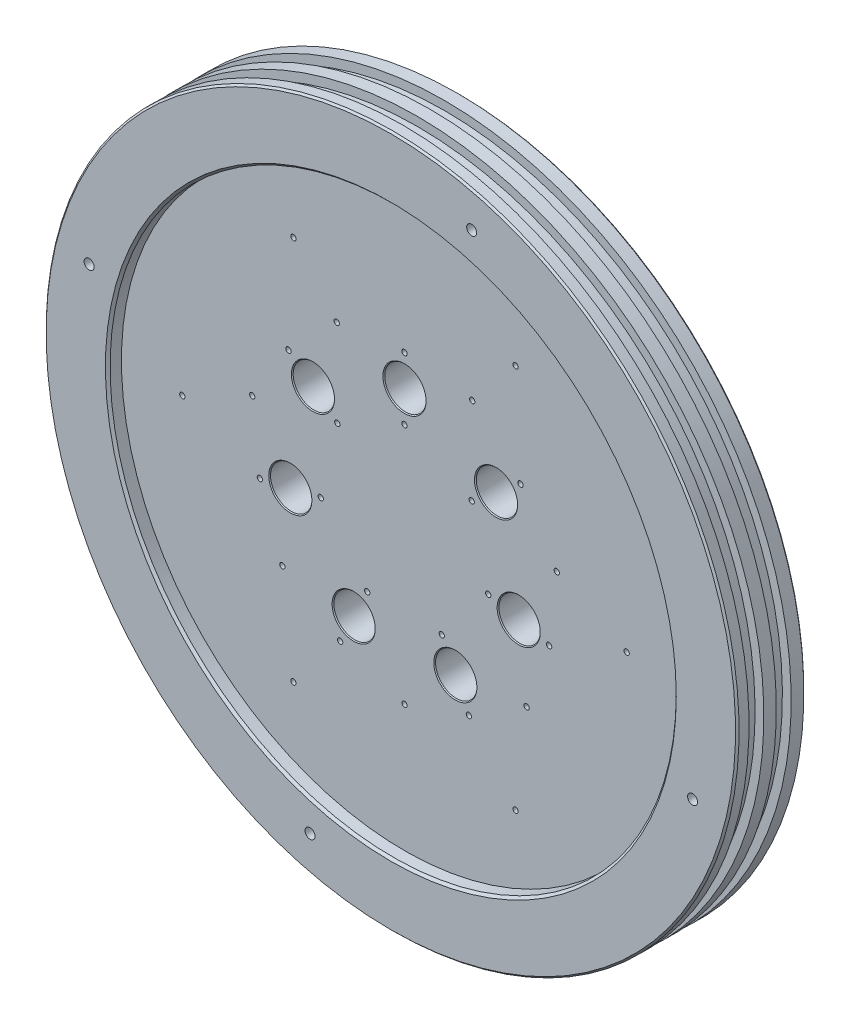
ISO-10303-21;
HEADER;
FILE_DESCRIPTION(('STEP AP214'),'2;1');
FILE_NAME('part.step','',(''),(''),'','','');
FILE_SCHEMA(('AUTOMOTIVE_DESIGN { 1 0 10303 214 1 1 1 1 }'));
ENDSEC;
DATA;
#1=APPLICATION_CONTEXT('core data for automotive mechanical design processes');
#2=APPLICATION_PROTOCOL_DEFINITION('international standard','automotive_design',2000,#1);
#3=PRODUCT_CONTEXT('',#1,'mechanical');
#4=PRODUCT('Part','Part','',(#3));
#5=PRODUCT_RELATED_PRODUCT_CATEGORY('part','',(#4));
#6=PRODUCT_DEFINITION_FORMATION('','',#4);
#7=PRODUCT_DEFINITION_CONTEXT('part definition',#1,'design');
#8=PRODUCT_DEFINITION('design','',#6,#7);
#9=PRODUCT_DEFINITION_SHAPE('','',#8);
#10=(LENGTH_UNIT() NAMED_UNIT(*) SI_UNIT(.MILLI.,.METRE.));
#11=(NAMED_UNIT(*) PLANE_ANGLE_UNIT() SI_UNIT($,.RADIAN.));
#12=(NAMED_UNIT(*) SI_UNIT($,.STERADIAN.) SOLID_ANGLE_UNIT());
#13=UNCERTAINTY_MEASURE_WITH_UNIT(LENGTH_MEASURE(1.E-05),#10,'distance_accuracy_value','');
#14=(GEOMETRIC_REPRESENTATION_CONTEXT(3) GLOBAL_UNCERTAINTY_ASSIGNED_CONTEXT((#13)) GLOBAL_UNIT_ASSIGNED_CONTEXT((#10,
#11,#12)) REPRESENTATION_CONTEXT('',''));
#15=CARTESIAN_POINT('',(0.,0.,0.));
#16=DIRECTION('',(0.,0.,1.));
#17=DIRECTION('',(1.,0.,0.));
#18=AXIS2_PLACEMENT_3D('',#15,#16,#17);
#19=CARTESIAN_POINT('',(0.,76.2,0.));
#20=DIRECTION('',(0.,0.,-1.));
#21=DIRECTION('',(0.,1.,0.));
#22=AXIS2_PLACEMENT_3D('',#19,#20,#21);
#23=CYLINDRICAL_SURFACE('',#22,13.4874);
#24=CARTESIAN_POINT('',(0.,76.2,-9.5182161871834));
#25=DIRECTION('',(0.,0.,1.));
#26=DIRECTION('',(1.,0.,0.));
#27=AXIS2_PLACEMENT_3D('',#24,#25,#26);
#28=CIRCLE('',#27,13.4874);
#29=CARTESIAN_POINT('',(0.,89.6874,-9.5182161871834));
#30=VERTEX_POINT('',#29);
#31=EDGE_CURVE('E1035',#30,#30,#28,.T.);
#32=CARTESIAN_POINT('',(0.,76.2,-35.56));
#33=DIRECTION('',(0.,0.,-1.));
#34=DIRECTION('',(0.,1.,0.));
#35=AXIS2_PLACEMENT_3D('',#32,#33,#34);
#36=CIRCLE('',#35,13.4874);
#37=CARTESIAN_POINT('',(0.,89.6874,-35.56));
#38=VERTEX_POINT('',#37);
#39=EDGE_CURVE('E921',#38,#38,#36,.F.);
#40=CARTESIAN_POINT('',(0.,89.6874,-9.5182161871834));
#41=CARTESIAN_POINT('',(0.,89.6874,-9.78948476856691));
#42=CARTESIAN_POINT('',(0.,89.6874,-10.0607533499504));
#43=CARTESIAN_POINT('',(0.,89.6874,-10.6032905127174));
#44=CARTESIAN_POINT('',(0.,89.6874,-10.8745590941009));
#45=CARTESIAN_POINT('',(0.,89.6874,-11.4170962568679));
#46=CARTESIAN_POINT('',(0.,89.6874,-11.6883648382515));
#47=CARTESIAN_POINT('',(0.,89.6874,-12.2309020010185));
#48=CARTESIAN_POINT('',(0.,89.6874,-12.502170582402));
#49=CARTESIAN_POINT('',(0.,89.6874,-13.044707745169));
#50=CARTESIAN_POINT('',(0.,89.6874,-13.3159763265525));
#51=CARTESIAN_POINT('',(0.,89.6874,-13.8585134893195));
#52=CARTESIAN_POINT('',(0.,89.6874,-14.129782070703));
#53=CARTESIAN_POINT('',(0.,89.6874,-14.67231923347));
#54=CARTESIAN_POINT('',(0.,89.6874,-14.9435878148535));
#55=CARTESIAN_POINT('',(0.,89.6874,-15.4861249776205));
#56=CARTESIAN_POINT('',(0.,89.6874,-15.757393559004));
#57=CARTESIAN_POINT('',(0.,89.6874,-16.2999307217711));
#58=CARTESIAN_POINT('',(0.,89.6874,-16.5711993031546));
#59=CARTESIAN_POINT('',(0.,89.6874,-17.1137364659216));
#60=CARTESIAN_POINT('',(0.,89.6874,-17.3850050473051));
#61=CARTESIAN_POINT('',(0.,89.6874,-17.9275422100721));
#62=CARTESIAN_POINT('',(0.,89.6874,-18.1988107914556));
#63=CARTESIAN_POINT('',(0.,89.6874,-18.7413479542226));
#64=CARTESIAN_POINT('',(0.,89.6874,-19.0126165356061));
#65=CARTESIAN_POINT('',(0.,89.6874,-19.5551536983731));
#66=CARTESIAN_POINT('',(0.,89.6874,-19.8264222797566));
#67=CARTESIAN_POINT('',(0.,89.6874,-20.3689594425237));
#68=CARTESIAN_POINT('',(0.,89.6874,-20.6402280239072));
#69=CARTESIAN_POINT('',(0.,89.6874,-21.1827651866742));
#70=CARTESIAN_POINT('',(0.,89.6874,-21.4540337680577));
#71=CARTESIAN_POINT('',(0.,89.6874,-21.9965709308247));
#72=CARTESIAN_POINT('',(0.,89.6874,-22.2678395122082));
#73=CARTESIAN_POINT('',(0.,89.6874,-22.8103766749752));
#74=CARTESIAN_POINT('',(0.,89.6874,-23.0816452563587));
#75=CARTESIAN_POINT('',(0.,89.6874,-23.6241824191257));
#76=CARTESIAN_POINT('',(0.,89.6874,-23.8954510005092));
#77=CARTESIAN_POINT('',(0.,89.6874,-24.4379881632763));
#78=CARTESIAN_POINT('',(0.,89.6874,-24.7092567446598));
#79=CARTESIAN_POINT('',(0.,89.6874,-25.2517939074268));
#80=CARTESIAN_POINT('',(0.,89.6874,-25.5230624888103));
#81=CARTESIAN_POINT('',(0.,89.6874,-26.0655996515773));
#82=CARTESIAN_POINT('',(0.,89.6874,-26.3368682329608));
#83=CARTESIAN_POINT('',(0.,89.6874,-26.8794053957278));
#84=CARTESIAN_POINT('',(0.,89.6874,-27.1506739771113));
#85=CARTESIAN_POINT('',(0.,89.6874,-27.6932111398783));
#86=CARTESIAN_POINT('',(0.,89.6874,-27.9644797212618));
#87=CARTESIAN_POINT('',(0.,89.6874,-28.5070168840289));
#88=CARTESIAN_POINT('',(0.,89.6874,-28.7782854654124));
#89=CARTESIAN_POINT('',(0.,89.6874,-29.3208226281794));
#90=CARTESIAN_POINT('',(0.,89.6874,-29.5920912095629));
#91=CARTESIAN_POINT('',(0.,89.6874,-30.1346283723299));
#92=CARTESIAN_POINT('',(0.,89.6874,-30.4058969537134));
#93=CARTESIAN_POINT('',(0.,89.6874,-30.9484341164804));
#94=CARTESIAN_POINT('',(0.,89.6874,-31.2197026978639));
#95=CARTESIAN_POINT('',(0.,89.6874,-31.7622398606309));
#96=CARTESIAN_POINT('',(0.,89.6874,-32.0335084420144));
#97=CARTESIAN_POINT('',(0.,89.6874,-32.5760456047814));
#98=CARTESIAN_POINT('',(0.,89.6874,-32.8473141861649));
#99=CARTESIAN_POINT('',(0.,89.6874,-33.389851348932));
#100=CARTESIAN_POINT('',(0.,89.6874,-33.6611199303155));
#101=CARTESIAN_POINT('',(0.,89.6874,-34.2036570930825));
#102=CARTESIAN_POINT('',(0.,89.6874,-34.474925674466));
#103=CARTESIAN_POINT('',(0.,89.6874,-35.017462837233));
#104=CARTESIAN_POINT('',(0.,89.6874,-35.2887314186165));
#105=CARTESIAN_POINT('',(0.,89.6874,-35.56));
#106=B_SPLINE_CURVE_WITH_KNOTS('',3,(#40,#41,#42,#43,#44,#45,#46,#47,#48,#49,#50,#51,#52,#53,
#54,#55,#56,#57,#58,#59,#60,#61,#62,#63,#64,#65,#66,#67,#68,#69,#70,#71,#72,#73,#74,#75,#76,#77,
#78,#79,#80,#81,#82,#83,#84,#85,#86,#87,#88,#89,#90,#91,#92,#93,#94,#95,#96,#97,#98,#99,#100,
#101,#102,#103,#104,#105),.UNSPECIFIED.,.F.,.F.,(4,2,2,2,2,2,2,2,2,2,2,2,2,2,2,2,2,2,2,2,2,2,2,
2,2,2,2,2,2,2,2,2,4),(0.,0.81380574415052,1.62761148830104,2.44141723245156,3.25522297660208,
4.0690287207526,4.88283446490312,5.69664020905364,6.51044595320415,7.32425169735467,
8.13805744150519,8.95186318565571,9.76566892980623,10.5794746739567,11.3932804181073,
12.2070861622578,13.0208919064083,13.8346976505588,14.6485033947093,15.4623091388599,
16.2761148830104,17.0899206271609,17.9037263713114,18.7175321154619,19.5313378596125,
20.345143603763,21.1589493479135,21.972755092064,22.7865608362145,23.6003665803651,
24.4141723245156,25.2279780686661,26.0417838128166),.UNSPECIFIED.);
#107=EDGE_CURVE('BSEAM399',#30,#38,#106,.T.);
#108=ORIENTED_EDGE('',*,*,#31,.T.);
#109=ORIENTED_EDGE('',*,*,#39,.F.);
#110=ORIENTED_EDGE('',*,*,#107,.T.);
#111=ORIENTED_EDGE('',*,*,#107,.F.);
#112=EDGE_LOOP('',(#108,#110,#109,#111));
#113=FACE_BOUND('',#112,.T.);
#114=ADVANCED_FACE('F399',(#113),#23,.F.);
#115=CARTESIAN_POINT('',(-59.575558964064,47.5099229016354,0.));
#116=DIRECTION('',(0.,0.,-1.));
#117=DIRECTION('',(-1.,0.,0.));
#118=AXIS2_PLACEMENT_3D('',#115,#116,#117);
#119=CYLINDRICAL_SURFACE('',#118,13.4874);
#120=CARTESIAN_POINT('',(-59.575558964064,47.5099229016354,-9.5182161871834));
#121=DIRECTION('',(0.,0.,1.));
#122=DIRECTION('',(1.,0.,0.));
#123=AXIS2_PLACEMENT_3D('',#120,#121,#122);
#124=CIRCLE('',#123,13.4874);
#125=CARTESIAN_POINT('',(-73.062958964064,47.5099229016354,-9.5182161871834));
#126=VERTEX_POINT('',#125);
#127=EDGE_CURVE('E1019',#126,#126,#124,.T.);
#128=CARTESIAN_POINT('',(-59.575558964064,47.5099229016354,-35.56));
#129=DIRECTION('',(0.,0.,-1.));
#130=DIRECTION('',(0.,1.,0.));
#131=AXIS2_PLACEMENT_3D('',#128,#129,#130);
#132=CIRCLE('',#131,13.4874);
#133=CARTESIAN_POINT('',(-73.062958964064,47.5099229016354,-35.56));
#134=VERTEX_POINT('',#133);
#135=EDGE_CURVE('E918',#134,#134,#132,.F.);
#136=CARTESIAN_POINT('',(-73.062958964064,47.5099229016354,-9.5182161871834));
#137=CARTESIAN_POINT('',(-73.062958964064,47.5099229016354,-9.78948476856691));
#138=CARTESIAN_POINT('',(-73.062958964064,47.5099229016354,-10.0607533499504));
#139=CARTESIAN_POINT('',(-73.062958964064,47.5099229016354,-10.6032905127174));
#140=CARTESIAN_POINT('',(-73.062958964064,47.5099229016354,-10.8745590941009));
#141=CARTESIAN_POINT('',(-73.062958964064,47.5099229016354,-11.4170962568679));
#142=CARTESIAN_POINT('',(-73.062958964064,47.5099229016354,-11.6883648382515));
#143=CARTESIAN_POINT('',(-73.062958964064,47.5099229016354,-12.2309020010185));
#144=CARTESIAN_POINT('',(-73.062958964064,47.5099229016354,-12.502170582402));
#145=CARTESIAN_POINT('',(-73.062958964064,47.5099229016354,-13.044707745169));
#146=CARTESIAN_POINT('',(-73.062958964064,47.5099229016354,-13.3159763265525));
#147=CARTESIAN_POINT('',(-73.062958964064,47.5099229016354,-13.8585134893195));
#148=CARTESIAN_POINT('',(-73.062958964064,47.5099229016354,-14.129782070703));
#149=CARTESIAN_POINT('',(-73.062958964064,47.5099229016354,-14.67231923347));
#150=CARTESIAN_POINT('',(-73.062958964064,47.5099229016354,-14.9435878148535));
#151=CARTESIAN_POINT('',(-73.062958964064,47.5099229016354,-15.4861249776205));
#152=CARTESIAN_POINT('',(-73.062958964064,47.5099229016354,-15.757393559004));
#153=CARTESIAN_POINT('',(-73.062958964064,47.5099229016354,-16.2999307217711));
#154=CARTESIAN_POINT('',(-73.062958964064,47.5099229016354,-16.5711993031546));
#155=CARTESIAN_POINT('',(-73.062958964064,47.5099229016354,-17.1137364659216));
#156=CARTESIAN_POINT('',(-73.062958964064,47.5099229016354,-17.3850050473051));
#157=CARTESIAN_POINT('',(-73.062958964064,47.5099229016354,-17.9275422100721));
#158=CARTESIAN_POINT('',(-73.062958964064,47.5099229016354,-18.1988107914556));
#159=CARTESIAN_POINT('',(-73.062958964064,47.5099229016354,-18.7413479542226));
#160=CARTESIAN_POINT('',(-73.062958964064,47.5099229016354,-19.0126165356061));
#161=CARTESIAN_POINT('',(-73.062958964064,47.5099229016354,-19.5551536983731));
#162=CARTESIAN_POINT('',(-73.062958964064,47.5099229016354,-19.8264222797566));
#163=CARTESIAN_POINT('',(-73.062958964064,47.5099229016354,-20.3689594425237));
#164=CARTESIAN_POINT('',(-73.062958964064,47.5099229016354,-20.6402280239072));
#165=CARTESIAN_POINT('',(-73.062958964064,47.5099229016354,-21.1827651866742));
#166=CARTESIAN_POINT('',(-73.062958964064,47.5099229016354,-21.4540337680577));
#167=CARTESIAN_POINT('',(-73.062958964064,47.5099229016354,-21.9965709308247));
#168=CARTESIAN_POINT('',(-73.062958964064,47.5099229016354,-22.2678395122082));
#169=CARTESIAN_POINT('',(-73.062958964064,47.5099229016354,-22.8103766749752));
#170=CARTESIAN_POINT('',(-73.062958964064,47.5099229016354,-23.0816452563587));
#171=CARTESIAN_POINT('',(-73.062958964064,47.5099229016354,-23.6241824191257));
#172=CARTESIAN_POINT('',(-73.062958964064,47.5099229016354,-23.8954510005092));
#173=CARTESIAN_POINT('',(-73.062958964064,47.5099229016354,-24.4379881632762));
#174=CARTESIAN_POINT('',(-73.062958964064,47.5099229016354,-24.7092567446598));
#175=CARTESIAN_POINT('',(-73.062958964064,47.5099229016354,-25.2517939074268));
#176=CARTESIAN_POINT('',(-73.062958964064,47.5099229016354,-25.5230624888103));
#177=CARTESIAN_POINT('',(-73.062958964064,47.5099229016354,-26.0655996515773));
#178=CARTESIAN_POINT('',(-73.062958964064,47.5099229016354,-26.3368682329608));
#179=CARTESIAN_POINT('',(-73.062958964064,47.5099229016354,-26.8794053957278));
#180=CARTESIAN_POINT('',(-73.062958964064,47.5099229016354,-27.1506739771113));
#181=CARTESIAN_POINT('',(-73.062958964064,47.5099229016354,-27.6932111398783));
#182=CARTESIAN_POINT('',(-73.062958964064,47.5099229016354,-27.9644797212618));
#183=CARTESIAN_POINT('',(-73.062958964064,47.5099229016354,-28.5070168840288));
#184=CARTESIAN_POINT('',(-73.062958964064,47.5099229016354,-28.7782854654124));
#185=CARTESIAN_POINT('',(-73.062958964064,47.5099229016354,-29.3208226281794));
#186=CARTESIAN_POINT('',(-73.062958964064,47.5099229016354,-29.5920912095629));
#187=CARTESIAN_POINT('',(-73.062958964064,47.5099229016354,-30.1346283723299));
#188=CARTESIAN_POINT('',(-73.062958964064,47.5099229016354,-30.4058969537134));
#189=CARTESIAN_POINT('',(-73.062958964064,47.5099229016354,-30.9484341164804));
#190=CARTESIAN_POINT('',(-73.062958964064,47.5099229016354,-31.2197026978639));
#191=CARTESIAN_POINT('',(-73.062958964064,47.5099229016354,-31.7622398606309));
#192=CARTESIAN_POINT('',(-73.062958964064,47.5099229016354,-32.0335084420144));
#193=CARTESIAN_POINT('',(-73.062958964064,47.5099229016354,-32.5760456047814));
#194=CARTESIAN_POINT('',(-73.062958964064,47.5099229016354,-32.8473141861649));
#195=CARTESIAN_POINT('',(-73.062958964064,47.5099229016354,-33.389851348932));
#196=CARTESIAN_POINT('',(-73.062958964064,47.5099229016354,-33.6611199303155));
#197=CARTESIAN_POINT('',(-73.062958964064,47.5099229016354,-34.2036570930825));
#198=CARTESIAN_POINT('',(-73.062958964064,47.5099229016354,-34.474925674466));
#199=CARTESIAN_POINT('',(-73.062958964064,47.5099229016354,-35.017462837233));
#200=CARTESIAN_POINT('',(-73.062958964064,47.5099229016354,-35.2887314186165));
#201=CARTESIAN_POINT('',(-73.062958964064,47.5099229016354,-35.56));
#202=B_SPLINE_CURVE_WITH_KNOTS('',3,(#136,#137,#138,#139,#140,#141,#142,#143,#144,#145,#146,
#147,#148,#149,#150,#151,#152,#153,#154,#155,#156,#157,#158,#159,#160,#161,#162,#163,#164,#165,
#166,#167,#168,#169,#170,#171,#172,#173,#174,#175,#176,#177,#178,#179,#180,#181,#182,#183,#184,
#185,#186,#187,#188,#189,#190,#191,#192,#193,#194,#195,#196,#197,#198,#199,#200,#201),
.UNSPECIFIED.,.F.,.F.,(4,2,2,2,2,2,2,2,2,2,2,2,2,2,2,2,2,2,2,2,2,2,2,2,2,2,2,2,2,2,2,2,4),(0.,
0.81380574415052,1.62761148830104,2.44141723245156,3.25522297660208,4.0690287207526,
4.88283446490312,5.69664020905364,6.51044595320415,7.32425169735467,8.13805744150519,
8.95186318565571,9.76566892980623,10.5794746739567,11.3932804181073,12.2070861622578,
13.0208919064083,13.8346976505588,14.6485033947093,15.4623091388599,16.2761148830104,
17.0899206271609,17.9037263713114,18.7175321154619,19.5313378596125,20.345143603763,
21.1589493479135,21.972755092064,22.7865608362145,23.600366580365,24.4141723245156,
25.2279780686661,26.0417838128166),.UNSPECIFIED.);
#203=EDGE_CURVE('BSEAM1116',#126,#134,#202,.T.);
#204=ORIENTED_EDGE('',*,*,#127,.T.);
#205=ORIENTED_EDGE('',*,*,#135,.F.);
#206=ORIENTED_EDGE('',*,*,#203,.T.);
#207=ORIENTED_EDGE('',*,*,#203,.F.);
#208=EDGE_LOOP('',(#204,#206,#205,#207));
#209=FACE_BOUND('',#208,.T.);
#210=ADVANCED_FACE('F1116',(#209),#119,.F.);
#211=CARTESIAN_POINT('',(-74.2895069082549,-16.9560951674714,0.));
#212=DIRECTION('',(0.,0.,-1.));
#213=DIRECTION('',(-1.,0.,0.));
#214=AXIS2_PLACEMENT_3D('',#211,#212,#213);
#215=CYLINDRICAL_SURFACE('',#214,13.4874);
#216=CARTESIAN_POINT('',(-74.2895069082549,-16.9560951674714,-9.5182161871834));
#217=DIRECTION('',(0.,0.,1.));
#218=DIRECTION('',(1.,0.,0.));
#219=AXIS2_PLACEMENT_3D('',#216,#217,#218);
#220=CIRCLE('',#219,13.4874);
#221=CARTESIAN_POINT('',(-87.7769069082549,-16.9560951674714,-9.5182161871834));
#222=VERTEX_POINT('',#221);
#223=EDGE_CURVE('E1015',#222,#222,#220,.T.);
#224=CARTESIAN_POINT('',(-74.2895069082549,-16.9560951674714,-35.56));
#225=DIRECTION('',(0.,0.,-1.));
#226=DIRECTION('',(0.,1.,0.));
#227=AXIS2_PLACEMENT_3D('',#224,#225,#226);
#228=CIRCLE('',#227,13.4874);
#229=CARTESIAN_POINT('',(-87.7769069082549,-16.9560951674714,-35.56));
#230=VERTEX_POINT('',#229);
#231=EDGE_CURVE('E915',#230,#230,#228,.F.);
#232=CARTESIAN_POINT('',(-87.7769069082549,-16.9560951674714,-9.5182161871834));
#233=CARTESIAN_POINT('',(-87.7769069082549,-16.9560951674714,-9.78948476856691));
#234=CARTESIAN_POINT('',(-87.7769069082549,-16.9560951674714,-10.0607533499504));
#235=CARTESIAN_POINT('',(-87.7769069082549,-16.9560951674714,-10.6032905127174));
#236=CARTESIAN_POINT('',(-87.7769069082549,-16.9560951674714,-10.8745590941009));
#237=CARTESIAN_POINT('',(-87.7769069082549,-16.9560951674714,-11.4170962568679));
#238=CARTESIAN_POINT('',(-87.7769069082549,-16.9560951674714,-11.6883648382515));
#239=CARTESIAN_POINT('',(-87.7769069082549,-16.9560951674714,-12.2309020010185));
#240=CARTESIAN_POINT('',(-87.7769069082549,-16.9560951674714,-12.502170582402));
#241=CARTESIAN_POINT('',(-87.7769069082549,-16.9560951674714,-13.044707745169));
#242=CARTESIAN_POINT('',(-87.7769069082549,-16.9560951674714,-13.3159763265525));
#243=CARTESIAN_POINT('',(-87.7769069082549,-16.9560951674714,-13.8585134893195));
#244=CARTESIAN_POINT('',(-87.7769069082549,-16.9560951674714,-14.129782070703));
#245=CARTESIAN_POINT('',(-87.7769069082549,-16.9560951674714,-14.67231923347));
#246=CARTESIAN_POINT('',(-87.7769069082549,-16.9560951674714,-14.9435878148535));
#247=CARTESIAN_POINT('',(-87.7769069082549,-16.9560951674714,-15.4861249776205));
#248=CARTESIAN_POINT('',(-87.7769069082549,-16.9560951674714,-15.757393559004));
#249=CARTESIAN_POINT('',(-87.7769069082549,-16.9560951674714,-16.2999307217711));
#250=CARTESIAN_POINT('',(-87.7769069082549,-16.9560951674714,-16.5711993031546));
#251=CARTESIAN_POINT('',(-87.7769069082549,-16.9560951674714,-17.1137364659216));
#252=CARTESIAN_POINT('',(-87.7769069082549,-16.9560951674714,-17.3850050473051));
#253=CARTESIAN_POINT('',(-87.7769069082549,-16.9560951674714,-17.9275422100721));
#254=CARTESIAN_POINT('',(-87.7769069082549,-16.9560951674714,-18.1988107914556));
#255=CARTESIAN_POINT('',(-87.7769069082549,-16.9560951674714,-18.7413479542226));
#256=CARTESIAN_POINT('',(-87.7769069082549,-16.9560951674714,-19.0126165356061));
#257=CARTESIAN_POINT('',(-87.7769069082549,-16.9560951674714,-19.5551536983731));
#258=CARTESIAN_POINT('',(-87.7769069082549,-16.9560951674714,-19.8264222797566));
#259=CARTESIAN_POINT('',(-87.7769069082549,-16.9560951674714,-20.3689594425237));
#260=CARTESIAN_POINT('',(-87.7769069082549,-16.9560951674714,-20.6402280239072));
#261=CARTESIAN_POINT('',(-87.7769069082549,-16.9560951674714,-21.1827651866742));
#262=CARTESIAN_POINT('',(-87.7769069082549,-16.9560951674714,-21.4540337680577));
#263=CARTESIAN_POINT('',(-87.7769069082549,-16.9560951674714,-21.9965709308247));
#264=CARTESIAN_POINT('',(-87.7769069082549,-16.9560951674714,-22.2678395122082));
#265=CARTESIAN_POINT('',(-87.7769069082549,-16.9560951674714,-22.8103766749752));
#266=CARTESIAN_POINT('',(-87.7769069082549,-16.9560951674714,-23.0816452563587));
#267=CARTESIAN_POINT('',(-87.7769069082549,-16.9560951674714,-23.6241824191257));
#268=CARTESIAN_POINT('',(-87.7769069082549,-16.9560951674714,-23.8954510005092));
#269=CARTESIAN_POINT('',(-87.7769069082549,-16.9560951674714,-24.4379881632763));
#270=CARTESIAN_POINT('',(-87.7769069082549,-16.9560951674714,-24.7092567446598));
#271=CARTESIAN_POINT('',(-87.7769069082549,-16.9560951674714,-25.2517939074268));
#272=CARTESIAN_POINT('',(-87.7769069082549,-16.9560951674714,-25.5230624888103));
#273=CARTESIAN_POINT('',(-87.7769069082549,-16.9560951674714,-26.0655996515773));
#274=CARTESIAN_POINT('',(-87.7769069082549,-16.9560951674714,-26.3368682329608));
#275=CARTESIAN_POINT('',(-87.7769069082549,-16.9560951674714,-26.8794053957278));
#276=CARTESIAN_POINT('',(-87.7769069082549,-16.9560951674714,-27.1506739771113));
#277=CARTESIAN_POINT('',(-87.7769069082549,-16.9560951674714,-27.6932111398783));
#278=CARTESIAN_POINT('',(-87.7769069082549,-16.9560951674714,-27.9644797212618));
#279=CARTESIAN_POINT('',(-87.7769069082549,-16.9560951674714,-28.5070168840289));
#280=CARTESIAN_POINT('',(-87.7769069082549,-16.9560951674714,-28.7782854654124));
#281=CARTESIAN_POINT('',(-87.7769069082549,-16.9560951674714,-29.3208226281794));
#282=CARTESIAN_POINT('',(-87.7769069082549,-16.9560951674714,-29.5920912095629));
#283=CARTESIAN_POINT('',(-87.7769069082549,-16.9560951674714,-30.1346283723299));
#284=CARTESIAN_POINT('',(-87.7769069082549,-16.9560951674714,-30.4058969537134));
#285=CARTESIAN_POINT('',(-87.7769069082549,-16.9560951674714,-30.9484341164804));
#286=CARTESIAN_POINT('',(-87.7769069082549,-16.9560951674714,-31.2197026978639));
#287=CARTESIAN_POINT('',(-87.7769069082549,-16.9560951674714,-31.7622398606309));
#288=CARTESIAN_POINT('',(-87.7769069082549,-16.9560951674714,-32.0335084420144));
#289=CARTESIAN_POINT('',(-87.7769069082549,-16.9560951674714,-32.5760456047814));
#290=CARTESIAN_POINT('',(-87.7769069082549,-16.9560951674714,-32.8473141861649));
#291=CARTESIAN_POINT('',(-87.7769069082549,-16.9560951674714,-33.389851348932));
#292=CARTESIAN_POINT('',(-87.7769069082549,-16.9560951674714,-33.6611199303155));
#293=CARTESIAN_POINT('',(-87.7769069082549,-16.9560951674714,-34.2036570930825));
#294=CARTESIAN_POINT('',(-87.7769069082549,-16.9560951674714,-34.474925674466));
#295=CARTESIAN_POINT('',(-87.7769069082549,-16.9560951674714,-35.017462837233));
#296=CARTESIAN_POINT('',(-87.7769069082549,-16.9560951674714,-35.2887314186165));
#297=CARTESIAN_POINT('',(-87.7769069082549,-16.9560951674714,-35.56));
#298=B_SPLINE_CURVE_WITH_KNOTS('',3,(#232,#233,#234,#235,#236,#237,#238,#239,#240,#241,#242,
#243,#244,#245,#246,#247,#248,#249,#250,#251,#252,#253,#254,#255,#256,#257,#258,#259,#260,#261,
#262,#263,#264,#265,#266,#267,#268,#269,#270,#271,#272,#273,#274,#275,#276,#277,#278,#279,#280,
#281,#282,#283,#284,#285,#286,#287,#288,#289,#290,#291,#292,#293,#294,#295,#296,#297),
.UNSPECIFIED.,.F.,.F.,(4,2,2,2,2,2,2,2,2,2,2,2,2,2,2,2,2,2,2,2,2,2,2,2,2,2,2,2,2,2,2,2,4),(0.,
0.81380574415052,1.62761148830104,2.44141723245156,3.25522297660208,4.0690287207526,
4.88283446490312,5.69664020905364,6.51044595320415,7.32425169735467,8.13805744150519,
8.95186318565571,9.76566892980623,10.5794746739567,11.3932804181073,12.2070861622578,
13.0208919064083,13.8346976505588,14.6485033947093,15.4623091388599,16.2761148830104,
17.0899206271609,17.9037263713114,18.7175321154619,19.5313378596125,20.345143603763,
21.1589493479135,21.972755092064,22.7865608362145,23.6003665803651,24.4141723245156,
25.2279780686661,26.0417838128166),.UNSPECIFIED.);
#299=EDGE_CURVE('BSEAM1123',#222,#230,#298,.T.);
#300=ORIENTED_EDGE('',*,*,#223,.T.);
#301=ORIENTED_EDGE('',*,*,#231,.F.);
#302=ORIENTED_EDGE('',*,*,#299,.T.);
#303=ORIENTED_EDGE('',*,*,#299,.F.);
#304=EDGE_LOOP('',(#300,#302,#301,#303));
#305=FACE_BOUND('',#304,.T.);
#306=ADVANCED_FACE('F1123',(#305),#215,.F.);
#307=CARTESIAN_POINT('',(-33.0619409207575,-68.6538277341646,0.));
#308=DIRECTION('',(0.,0.,-1.));
#309=DIRECTION('',(0.,1.,0.));
#310=AXIS2_PLACEMENT_3D('',#307,#308,#309);
#311=CYLINDRICAL_SURFACE('',#310,13.4874);
#312=CARTESIAN_POINT('',(-33.0619409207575,-68.6538277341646,-9.5182161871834));
#313=DIRECTION('',(0.,0.,1.));
#314=DIRECTION('',(1.,0.,0.));
#315=AXIS2_PLACEMENT_3D('',#312,#313,#314);
#316=CIRCLE('',#315,13.4874);
#317=CARTESIAN_POINT('',(-33.0619409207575,-55.1664277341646,-9.5182161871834));
#318=VERTEX_POINT('',#317);
#319=EDGE_CURVE('E1011',#318,#318,#316,.T.);
#320=CARTESIAN_POINT('',(-33.0619409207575,-68.6538277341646,-35.56));
#321=DIRECTION('',(0.,0.,-1.));
#322=DIRECTION('',(0.,1.,0.));
#323=AXIS2_PLACEMENT_3D('',#320,#321,#322);
#324=CIRCLE('',#323,13.4874);
#325=CARTESIAN_POINT('',(-33.0619409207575,-55.1664277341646,-35.56));
#326=VERTEX_POINT('',#325);
#327=EDGE_CURVE('E912',#326,#326,#324,.F.);
#328=CARTESIAN_POINT('',(-33.0619409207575,-55.1664277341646,-9.5182161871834));
#329=CARTESIAN_POINT('',(-33.0619409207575,-55.1664277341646,-9.78948476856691));
#330=CARTESIAN_POINT('',(-33.0619409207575,-55.1664277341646,-10.0607533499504));
#331=CARTESIAN_POINT('',(-33.0619409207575,-55.1664277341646,-10.6032905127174));
#332=CARTESIAN_POINT('',(-33.0619409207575,-55.1664277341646,-10.8745590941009));
#333=CARTESIAN_POINT('',(-33.0619409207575,-55.1664277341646,-11.4170962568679));
#334=CARTESIAN_POINT('',(-33.0619409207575,-55.1664277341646,-11.6883648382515));
#335=CARTESIAN_POINT('',(-33.0619409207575,-55.1664277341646,-12.2309020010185));
#336=CARTESIAN_POINT('',(-33.0619409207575,-55.1664277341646,-12.502170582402));
#337=CARTESIAN_POINT('',(-33.0619409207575,-55.1664277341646,-13.044707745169));
#338=CARTESIAN_POINT('',(-33.0619409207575,-55.1664277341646,-13.3159763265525));
#339=CARTESIAN_POINT('',(-33.0619409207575,-55.1664277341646,-13.8585134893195));
#340=CARTESIAN_POINT('',(-33.0619409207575,-55.1664277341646,-14.129782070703));
#341=CARTESIAN_POINT('',(-33.0619409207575,-55.1664277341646,-14.67231923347));
#342=CARTESIAN_POINT('',(-33.0619409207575,-55.1664277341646,-14.9435878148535));
#343=CARTESIAN_POINT('',(-33.0619409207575,-55.1664277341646,-15.4861249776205));
#344=CARTESIAN_POINT('',(-33.0619409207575,-55.1664277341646,-15.757393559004));
#345=CARTESIAN_POINT('',(-33.0619409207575,-55.1664277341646,-16.2999307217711));
#346=CARTESIAN_POINT('',(-33.0619409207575,-55.1664277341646,-16.5711993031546));
#347=CARTESIAN_POINT('',(-33.0619409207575,-55.1664277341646,-17.1137364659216));
#348=CARTESIAN_POINT('',(-33.0619409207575,-55.1664277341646,-17.3850050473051));
#349=CARTESIAN_POINT('',(-33.0619409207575,-55.1664277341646,-17.9275422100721));
#350=CARTESIAN_POINT('',(-33.0619409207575,-55.1664277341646,-18.1988107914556));
#351=CARTESIAN_POINT('',(-33.0619409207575,-55.1664277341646,-18.7413479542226));
#352=CARTESIAN_POINT('',(-33.0619409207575,-55.1664277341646,-19.0126165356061));
#353=CARTESIAN_POINT('',(-33.0619409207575,-55.1664277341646,-19.5551536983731));
#354=CARTESIAN_POINT('',(-33.0619409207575,-55.1664277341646,-19.8264222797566));
#355=CARTESIAN_POINT('',(-33.0619409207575,-55.1664277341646,-20.3689594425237));
#356=CARTESIAN_POINT('',(-33.0619409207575,-55.1664277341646,-20.6402280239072));
#357=CARTESIAN_POINT('',(-33.0619409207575,-55.1664277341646,-21.1827651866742));
#358=CARTESIAN_POINT('',(-33.0619409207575,-55.1664277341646,-21.4540337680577));
#359=CARTESIAN_POINT('',(-33.0619409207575,-55.1664277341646,-21.9965709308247));
#360=CARTESIAN_POINT('',(-33.0619409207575,-55.1664277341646,-22.2678395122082));
#361=CARTESIAN_POINT('',(-33.0619409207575,-55.1664277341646,-22.8103766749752));
#362=CARTESIAN_POINT('',(-33.0619409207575,-55.1664277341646,-23.0816452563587));
#363=CARTESIAN_POINT('',(-33.0619409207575,-55.1664277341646,-23.6241824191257));
#364=CARTESIAN_POINT('',(-33.0619409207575,-55.1664277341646,-23.8954510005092));
#365=CARTESIAN_POINT('',(-33.0619409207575,-55.1664277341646,-24.4379881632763));
#366=CARTESIAN_POINT('',(-33.0619409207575,-55.1664277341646,-24.7092567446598));
#367=CARTESIAN_POINT('',(-33.0619409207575,-55.1664277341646,-25.2517939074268));
#368=CARTESIAN_POINT('',(-33.0619409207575,-55.1664277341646,-25.5230624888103));
#369=CARTESIAN_POINT('',(-33.0619409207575,-55.1664277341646,-26.0655996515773));
#370=CARTESIAN_POINT('',(-33.0619409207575,-55.1664277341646,-26.3368682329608));
#371=CARTESIAN_POINT('',(-33.0619409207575,-55.1664277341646,-26.8794053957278));
#372=CARTESIAN_POINT('',(-33.0619409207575,-55.1664277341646,-27.1506739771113));
#373=CARTESIAN_POINT('',(-33.0619409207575,-55.1664277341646,-27.6932111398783));
#374=CARTESIAN_POINT('',(-33.0619409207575,-55.1664277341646,-27.9644797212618));
#375=CARTESIAN_POINT('',(-33.0619409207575,-55.1664277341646,-28.5070168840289));
#376=CARTESIAN_POINT('',(-33.0619409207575,-55.1664277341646,-28.7782854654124));
#377=CARTESIAN_POINT('',(-33.0619409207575,-55.1664277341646,-29.3208226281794));
#378=CARTESIAN_POINT('',(-33.0619409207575,-55.1664277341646,-29.5920912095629));
#379=CARTESIAN_POINT('',(-33.0619409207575,-55.1664277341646,-30.1346283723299));
#380=CARTESIAN_POINT('',(-33.0619409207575,-55.1664277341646,-30.4058969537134));
#381=CARTESIAN_POINT('',(-33.0619409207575,-55.1664277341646,-30.9484341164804));
#382=CARTESIAN_POINT('',(-33.0619409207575,-55.1664277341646,-31.2197026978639));
#383=CARTESIAN_POINT('',(-33.0619409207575,-55.1664277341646,-31.7622398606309));
#384=CARTESIAN_POINT('',(-33.0619409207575,-55.1664277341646,-32.0335084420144));
#385=CARTESIAN_POINT('',(-33.0619409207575,-55.1664277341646,-32.5760456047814));
#386=CARTESIAN_POINT('',(-33.0619409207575,-55.1664277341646,-32.847314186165));
#387=CARTESIAN_POINT('',(-33.0619409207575,-55.1664277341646,-33.389851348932));
#388=CARTESIAN_POINT('',(-33.0619409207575,-55.1664277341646,-33.6611199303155));
#389=CARTESIAN_POINT('',(-33.0619409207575,-55.1664277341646,-34.2036570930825));
#390=CARTESIAN_POINT('',(-33.0619409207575,-55.1664277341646,-34.474925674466));
#391=CARTESIAN_POINT('',(-33.0619409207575,-55.1664277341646,-35.017462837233));
#392=CARTESIAN_POINT('',(-33.0619409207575,-55.1664277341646,-35.2887314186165));
#393=CARTESIAN_POINT('',(-33.0619409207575,-55.1664277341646,-35.56));
#394=B_SPLINE_CURVE_WITH_KNOTS('',3,(#328,#329,#330,#331,#332,#333,#334,#335,#336,#337,#338,
#339,#340,#341,#342,#343,#344,#345,#346,#347,#348,#349,#350,#351,#352,#353,#354,#355,#356,#357,
#358,#359,#360,#361,#362,#363,#364,#365,#366,#367,#368,#369,#370,#371,#372,#373,#374,#375,#376,
#377,#378,#379,#380,#381,#382,#383,#384,#385,#386,#387,#388,#389,#390,#391,#392,#393),
.UNSPECIFIED.,.F.,.F.,(4,2,2,2,2,2,2,2,2,2,2,2,2,2,2,2,2,2,2,2,2,2,2,2,2,2,2,2,2,2,2,2,4),(0.,
0.81380574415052,1.62761148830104,2.44141723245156,3.25522297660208,4.0690287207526,
4.88283446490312,5.69664020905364,6.51044595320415,7.32425169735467,8.13805744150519,
8.95186318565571,9.76566892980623,10.5794746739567,11.3932804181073,12.2070861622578,
13.0208919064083,13.8346976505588,14.6485033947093,15.4623091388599,16.2761148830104,
17.0899206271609,17.9037263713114,18.7175321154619,19.5313378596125,20.345143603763,
21.1589493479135,21.972755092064,22.7865608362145,23.6003665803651,24.4141723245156,
25.2279780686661,26.0417838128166),.UNSPECIFIED.);
#395=EDGE_CURVE('BSEAM1344',#318,#326,#394,.T.);
#396=ORIENTED_EDGE('',*,*,#319,.T.);
#397=ORIENTED_EDGE('',*,*,#327,.F.);
#398=ORIENTED_EDGE('',*,*,#395,.T.);
#399=ORIENTED_EDGE('',*,*,#395,.F.);
#400=EDGE_LOOP('',(#396,#398,#397,#399));
#401=FACE_BOUND('',#400,.T.);
#402=ADVANCED_FACE('F1344',(#401),#311,.F.);
#403=CARTESIAN_POINT('',(33.0619409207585,-68.6538277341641,0.));
#404=DIRECTION('',(0.,0.,-1.));
#405=DIRECTION('',(0.,1.,0.));
#406=AXIS2_PLACEMENT_3D('',#403,#404,#405);
#407=CYLINDRICAL_SURFACE('',#406,13.4874);
#408=CARTESIAN_POINT('',(33.0619409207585,-68.6538277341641,-9.5182161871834));
#409=DIRECTION('',(0.,0.,1.));
#410=DIRECTION('',(1.,0.,0.));
#411=AXIS2_PLACEMENT_3D('',#408,#409,#410);
#412=CIRCLE('',#411,13.4874);
#413=CARTESIAN_POINT('',(33.0619409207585,-55.1664277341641,-9.5182161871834));
#414=VERTEX_POINT('',#413);
#415=EDGE_CURVE('E1007',#414,#414,#412,.T.);
#416=CARTESIAN_POINT('',(33.0619409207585,-68.6538277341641,-35.56));
#417=DIRECTION('',(0.,0.,-1.));
#418=DIRECTION('',(0.,1.,0.));
#419=AXIS2_PLACEMENT_3D('',#416,#417,#418);
#420=CIRCLE('',#419,13.4874);
#421=CARTESIAN_POINT('',(33.0619409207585,-55.1664277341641,-35.56));
#422=VERTEX_POINT('',#421);
#423=EDGE_CURVE('E909',#422,#422,#420,.F.);
#424=CARTESIAN_POINT('',(33.0619409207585,-55.1664277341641,-9.5182161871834));
#425=CARTESIAN_POINT('',(33.0619409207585,-55.1664277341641,-9.78948476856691));
#426=CARTESIAN_POINT('',(33.0619409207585,-55.1664277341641,-10.0607533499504));
#427=CARTESIAN_POINT('',(33.0619409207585,-55.1664277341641,-10.6032905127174));
#428=CARTESIAN_POINT('',(33.0619409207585,-55.1664277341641,-10.8745590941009));
#429=CARTESIAN_POINT('',(33.0619409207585,-55.1664277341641,-11.4170962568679));
#430=CARTESIAN_POINT('',(33.0619409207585,-55.1664277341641,-11.6883648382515));
#431=CARTESIAN_POINT('',(33.0619409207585,-55.1664277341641,-12.2309020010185));
#432=CARTESIAN_POINT('',(33.0619409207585,-55.1664277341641,-12.502170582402));
#433=CARTESIAN_POINT('',(33.0619409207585,-55.1664277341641,-13.044707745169));
#434=CARTESIAN_POINT('',(33.0619409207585,-55.1664277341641,-13.3159763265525));
#435=CARTESIAN_POINT('',(33.0619409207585,-55.1664277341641,-13.8585134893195));
#436=CARTESIAN_POINT('',(33.0619409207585,-55.1664277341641,-14.129782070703));
#437=CARTESIAN_POINT('',(33.0619409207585,-55.1664277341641,-14.67231923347));
#438=CARTESIAN_POINT('',(33.0619409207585,-55.1664277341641,-14.9435878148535));
#439=CARTESIAN_POINT('',(33.0619409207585,-55.1664277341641,-15.4861249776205));
#440=CARTESIAN_POINT('',(33.0619409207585,-55.1664277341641,-15.757393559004));
#441=CARTESIAN_POINT('',(33.0619409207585,-55.1664277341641,-16.2999307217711));
#442=CARTESIAN_POINT('',(33.0619409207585,-55.1664277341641,-16.5711993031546));
#443=CARTESIAN_POINT('',(33.0619409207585,-55.1664277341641,-17.1137364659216));
#444=CARTESIAN_POINT('',(33.0619409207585,-55.1664277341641,-17.3850050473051));
#445=CARTESIAN_POINT('',(33.0619409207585,-55.1664277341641,-17.9275422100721));
#446=CARTESIAN_POINT('',(33.0619409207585,-55.1664277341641,-18.1988107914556));
#447=CARTESIAN_POINT('',(33.0619409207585,-55.1664277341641,-18.7413479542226));
#448=CARTESIAN_POINT('',(33.0619409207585,-55.1664277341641,-19.0126165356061));
#449=CARTESIAN_POINT('',(33.0619409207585,-55.1664277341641,-19.5551536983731));
#450=CARTESIAN_POINT('',(33.0619409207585,-55.1664277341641,-19.8264222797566));
#451=CARTESIAN_POINT('',(33.0619409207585,-55.1664277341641,-20.3689594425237));
#452=CARTESIAN_POINT('',(33.0619409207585,-55.1664277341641,-20.6402280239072));
#453=CARTESIAN_POINT('',(33.0619409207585,-55.1664277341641,-21.1827651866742));
#454=CARTESIAN_POINT('',(33.0619409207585,-55.1664277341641,-21.4540337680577));
#455=CARTESIAN_POINT('',(33.0619409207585,-55.1664277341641,-21.9965709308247));
#456=CARTESIAN_POINT('',(33.0619409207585,-55.1664277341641,-22.2678395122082));
#457=CARTESIAN_POINT('',(33.0619409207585,-55.1664277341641,-22.8103766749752));
#458=CARTESIAN_POINT('',(33.0619409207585,-55.1664277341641,-23.0816452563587));
#459=CARTESIAN_POINT('',(33.0619409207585,-55.1664277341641,-23.6241824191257));
#460=CARTESIAN_POINT('',(33.0619409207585,-55.1664277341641,-23.8954510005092));
#461=CARTESIAN_POINT('',(33.0619409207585,-55.1664277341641,-24.4379881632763));
#462=CARTESIAN_POINT('',(33.0619409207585,-55.1664277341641,-24.7092567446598));
#463=CARTESIAN_POINT('',(33.0619409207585,-55.1664277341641,-25.2517939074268));
#464=CARTESIAN_POINT('',(33.0619409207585,-55.1664277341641,-25.5230624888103));
#465=CARTESIAN_POINT('',(33.0619409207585,-55.1664277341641,-26.0655996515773));
#466=CARTESIAN_POINT('',(33.0619409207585,-55.1664277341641,-26.3368682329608));
#467=CARTESIAN_POINT('',(33.0619409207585,-55.1664277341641,-26.8794053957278));
#468=CARTESIAN_POINT('',(33.0619409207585,-55.1664277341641,-27.1506739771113));
#469=CARTESIAN_POINT('',(33.0619409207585,-55.1664277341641,-27.6932111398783));
#470=CARTESIAN_POINT('',(33.0619409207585,-55.1664277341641,-27.9644797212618));
#471=CARTESIAN_POINT('',(33.0619409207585,-55.1664277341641,-28.5070168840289));
#472=CARTESIAN_POINT('',(33.0619409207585,-55.1664277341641,-28.7782854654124));
#473=CARTESIAN_POINT('',(33.0619409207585,-55.1664277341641,-29.3208226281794));
#474=CARTESIAN_POINT('',(33.0619409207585,-55.1664277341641,-29.5920912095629));
#475=CARTESIAN_POINT('',(33.0619409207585,-55.1664277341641,-30.1346283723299));
#476=CARTESIAN_POINT('',(33.0619409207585,-55.1664277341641,-30.4058969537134));
#477=CARTESIAN_POINT('',(33.0619409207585,-55.1664277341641,-30.9484341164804));
#478=CARTESIAN_POINT('',(33.0619409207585,-55.1664277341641,-31.2197026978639));
#479=CARTESIAN_POINT('',(33.0619409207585,-55.1664277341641,-31.7622398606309));
#480=CARTESIAN_POINT('',(33.0619409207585,-55.1664277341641,-32.0335084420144));
#481=CARTESIAN_POINT('',(33.0619409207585,-55.1664277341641,-32.5760456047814));
#482=CARTESIAN_POINT('',(33.0619409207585,-55.1664277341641,-32.847314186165));
#483=CARTESIAN_POINT('',(33.0619409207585,-55.1664277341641,-33.389851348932));
#484=CARTESIAN_POINT('',(33.0619409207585,-55.1664277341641,-33.6611199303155));
#485=CARTESIAN_POINT('',(33.0619409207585,-55.1664277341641,-34.2036570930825));
#486=CARTESIAN_POINT('',(33.0619409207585,-55.1664277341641,-34.474925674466));
#487=CARTESIAN_POINT('',(33.0619409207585,-55.1664277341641,-35.017462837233));
#488=CARTESIAN_POINT('',(33.0619409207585,-55.1664277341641,-35.2887314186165));
#489=CARTESIAN_POINT('',(33.0619409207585,-55.1664277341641,-35.56));
#490=B_SPLINE_CURVE_WITH_KNOTS('',3,(#424,#425,#426,#427,#428,#429,#430,#431,#432,#433,#434,
#435,#436,#437,#438,#439,#440,#441,#442,#443,#444,#445,#446,#447,#448,#449,#450,#451,#452,#453,
#454,#455,#456,#457,#458,#459,#460,#461,#462,#463,#464,#465,#466,#467,#468,#469,#470,#471,#472,
#473,#474,#475,#476,#477,#478,#479,#480,#481,#482,#483,#484,#485,#486,#487,#488,#489),
.UNSPECIFIED.,.F.,.F.,(4,2,2,2,2,2,2,2,2,2,2,2,2,2,2,2,2,2,2,2,2,2,2,2,2,2,2,2,2,2,2,2,4),(0.,
0.81380574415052,1.62761148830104,2.44141723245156,3.25522297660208,4.0690287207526,
4.88283446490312,5.69664020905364,6.51044595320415,7.32425169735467,8.13805744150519,
8.95186318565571,9.76566892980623,10.5794746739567,11.3932804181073,12.2070861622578,
13.0208919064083,13.8346976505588,14.6485033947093,15.4623091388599,16.2761148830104,
17.0899206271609,17.9037263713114,18.7175321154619,19.5313378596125,20.345143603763,
21.1589493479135,21.972755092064,22.7865608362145,23.6003665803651,24.4141723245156,
25.2279780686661,26.0417838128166),.UNSPECIFIED.);
#491=EDGE_CURVE('BSEAM1340',#414,#422,#490,.T.);
#492=ORIENTED_EDGE('',*,*,#415,.T.);
#493=ORIENTED_EDGE('',*,*,#423,.F.);
#494=ORIENTED_EDGE('',*,*,#491,.T.);
#495=ORIENTED_EDGE('',*,*,#491,.F.);
#496=EDGE_LOOP('',(#492,#494,#493,#495));
#497=FACE_BOUND('',#496,.T.);
#498=ADVANCED_FACE('F1340',(#497),#407,.F.);
#499=CARTESIAN_POINT('',(74.2895069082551,-16.9560951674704,0.));
#500=DIRECTION('',(0.,0.,-1.));
#501=DIRECTION('',(-1.,0.,0.));
#502=AXIS2_PLACEMENT_3D('',#499,#500,#501);
#503=CYLINDRICAL_SURFACE('',#502,13.4874);
#504=CARTESIAN_POINT('',(74.2895069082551,-16.9560951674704,-9.5182161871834));
#505=DIRECTION('',(0.,0.,1.));
#506=DIRECTION('',(1.,0.,0.));
#507=AXIS2_PLACEMENT_3D('',#504,#505,#506);
#508=CIRCLE('',#507,13.4874);
#509=CARTESIAN_POINT('',(60.8021069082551,-16.9560951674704,-9.5182161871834));
#510=VERTEX_POINT('',#509);
#511=EDGE_CURVE('E1003',#510,#510,#508,.T.);
#512=CARTESIAN_POINT('',(74.2895069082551,-16.9560951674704,-35.56));
#513=DIRECTION('',(0.,0.,-1.));
#514=DIRECTION('',(0.,1.,0.));
#515=AXIS2_PLACEMENT_3D('',#512,#513,#514);
#516=CIRCLE('',#515,13.4874);
#517=CARTESIAN_POINT('',(60.8021069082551,-16.9560951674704,-35.56));
#518=VERTEX_POINT('',#517);
#519=EDGE_CURVE('E906',#518,#518,#516,.F.);
#520=CARTESIAN_POINT('',(60.8021069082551,-16.9560951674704,-9.5182161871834));
#521=CARTESIAN_POINT('',(60.8021069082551,-16.9560951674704,-9.78948476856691));
#522=CARTESIAN_POINT('',(60.8021069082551,-16.9560951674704,-10.0607533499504));
#523=CARTESIAN_POINT('',(60.8021069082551,-16.9560951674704,-10.6032905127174));
#524=CARTESIAN_POINT('',(60.8021069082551,-16.9560951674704,-10.8745590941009));
#525=CARTESIAN_POINT('',(60.8021069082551,-16.9560951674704,-11.4170962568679));
#526=CARTESIAN_POINT('',(60.8021069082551,-16.9560951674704,-11.6883648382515));
#527=CARTESIAN_POINT('',(60.8021069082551,-16.9560951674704,-12.2309020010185));
#528=CARTESIAN_POINT('',(60.8021069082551,-16.9560951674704,-12.502170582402));
#529=CARTESIAN_POINT('',(60.8021069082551,-16.9560951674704,-13.044707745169));
#530=CARTESIAN_POINT('',(60.8021069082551,-16.9560951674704,-13.3159763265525));
#531=CARTESIAN_POINT('',(60.8021069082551,-16.9560951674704,-13.8585134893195));
#532=CARTESIAN_POINT('',(60.8021069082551,-16.9560951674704,-14.129782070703));
#533=CARTESIAN_POINT('',(60.8021069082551,-16.9560951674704,-14.67231923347));
#534=CARTESIAN_POINT('',(60.8021069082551,-16.9560951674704,-14.9435878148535));
#535=CARTESIAN_POINT('',(60.8021069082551,-16.9560951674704,-15.4861249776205));
#536=CARTESIAN_POINT('',(60.8021069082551,-16.9560951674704,-15.757393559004));
#537=CARTESIAN_POINT('',(60.8021069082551,-16.9560951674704,-16.2999307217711));
#538=CARTESIAN_POINT('',(60.8021069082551,-16.9560951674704,-16.5711993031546));
#539=CARTESIAN_POINT('',(60.8021069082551,-16.9560951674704,-17.1137364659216));
#540=CARTESIAN_POINT('',(60.8021069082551,-16.9560951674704,-17.3850050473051));
#541=CARTESIAN_POINT('',(60.8021069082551,-16.9560951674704,-17.9275422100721));
#542=CARTESIAN_POINT('',(60.8021069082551,-16.9560951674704,-18.1988107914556));
#543=CARTESIAN_POINT('',(60.8021069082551,-16.9560951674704,-18.7413479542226));
#544=CARTESIAN_POINT('',(60.8021069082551,-16.9560951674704,-19.0126165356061));
#545=CARTESIAN_POINT('',(60.8021069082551,-16.9560951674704,-19.5551536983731));
#546=CARTESIAN_POINT('',(60.8021069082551,-16.9560951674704,-19.8264222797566));
#547=CARTESIAN_POINT('',(60.8021069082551,-16.9560951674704,-20.3689594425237));
#548=CARTESIAN_POINT('',(60.8021069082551,-16.9560951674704,-20.6402280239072));
#549=CARTESIAN_POINT('',(60.8021069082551,-16.9560951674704,-21.1827651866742));
#550=CARTESIAN_POINT('',(60.8021069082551,-16.9560951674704,-21.4540337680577));
#551=CARTESIAN_POINT('',(60.8021069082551,-16.9560951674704,-21.9965709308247));
#552=CARTESIAN_POINT('',(60.8021069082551,-16.9560951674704,-22.2678395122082));
#553=CARTESIAN_POINT('',(60.8021069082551,-16.9560951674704,-22.8103766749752));
#554=CARTESIAN_POINT('',(60.8021069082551,-16.9560951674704,-23.0816452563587));
#555=CARTESIAN_POINT('',(60.8021069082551,-16.9560951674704,-23.6241824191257));
#556=CARTESIAN_POINT('',(60.8021069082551,-16.9560951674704,-23.8954510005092));
#557=CARTESIAN_POINT('',(60.8021069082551,-16.9560951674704,-24.4379881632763));
#558=CARTESIAN_POINT('',(60.8021069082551,-16.9560951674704,-24.7092567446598));
#559=CARTESIAN_POINT('',(60.8021069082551,-16.9560951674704,-25.2517939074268));
#560=CARTESIAN_POINT('',(60.8021069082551,-16.9560951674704,-25.5230624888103));
#561=CARTESIAN_POINT('',(60.8021069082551,-16.9560951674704,-26.0655996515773));
#562=CARTESIAN_POINT('',(60.8021069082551,-16.9560951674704,-26.3368682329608));
#563=CARTESIAN_POINT('',(60.8021069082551,-16.9560951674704,-26.8794053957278));
#564=CARTESIAN_POINT('',(60.8021069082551,-16.9560951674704,-27.1506739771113));
#565=CARTESIAN_POINT('',(60.8021069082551,-16.9560951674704,-27.6932111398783));
#566=CARTESIAN_POINT('',(60.8021069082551,-16.9560951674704,-27.9644797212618));
#567=CARTESIAN_POINT('',(60.8021069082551,-16.9560951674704,-28.5070168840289));
#568=CARTESIAN_POINT('',(60.8021069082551,-16.9560951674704,-28.7782854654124));
#569=CARTESIAN_POINT('',(60.8021069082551,-16.9560951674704,-29.3208226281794));
#570=CARTESIAN_POINT('',(60.8021069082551,-16.9560951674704,-29.5920912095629));
#571=CARTESIAN_POINT('',(60.8021069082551,-16.9560951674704,-30.1346283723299));
#572=CARTESIAN_POINT('',(60.8021069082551,-16.9560951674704,-30.4058969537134));
#573=CARTESIAN_POINT('',(60.8021069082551,-16.9560951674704,-30.9484341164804));
#574=CARTESIAN_POINT('',(60.8021069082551,-16.9560951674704,-31.2197026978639));
#575=CARTESIAN_POINT('',(60.8021069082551,-16.9560951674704,-31.7622398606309));
#576=CARTESIAN_POINT('',(60.8021069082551,-16.9560951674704,-32.0335084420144));
#577=CARTESIAN_POINT('',(60.8021069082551,-16.9560951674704,-32.5760456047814));
#578=CARTESIAN_POINT('',(60.8021069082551,-16.9560951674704,-32.8473141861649));
#579=CARTESIAN_POINT('',(60.8021069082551,-16.9560951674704,-33.389851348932));
#580=CARTESIAN_POINT('',(60.8021069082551,-16.9560951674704,-33.6611199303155));
#581=CARTESIAN_POINT('',(60.8021069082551,-16.9560951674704,-34.2036570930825));
#582=CARTESIAN_POINT('',(60.8021069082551,-16.9560951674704,-34.474925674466));
#583=CARTESIAN_POINT('',(60.8021069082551,-16.9560951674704,-35.017462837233));
#584=CARTESIAN_POINT('',(60.8021069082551,-16.9560951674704,-35.2887314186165));
#585=CARTESIAN_POINT('',(60.8021069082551,-16.9560951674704,-35.56));
#586=B_SPLINE_CURVE_WITH_KNOTS('',3,(#520,#521,#522,#523,#524,#525,#526,#527,#528,#529,#530,
#531,#532,#533,#534,#535,#536,#537,#538,#539,#540,#541,#542,#543,#544,#545,#546,#547,#548,#549,
#550,#551,#552,#553,#554,#555,#556,#557,#558,#559,#560,#561,#562,#563,#564,#565,#566,#567,#568,
#569,#570,#571,#572,#573,#574,#575,#576,#577,#578,#579,#580,#581,#582,#583,#584,#585),
.UNSPECIFIED.,.F.,.F.,(4,2,2,2,2,2,2,2,2,2,2,2,2,2,2,2,2,2,2,2,2,2,2,2,2,2,2,2,2,2,2,2,4),(0.,
0.81380574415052,1.62761148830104,2.44141723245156,3.25522297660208,4.0690287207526,
4.88283446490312,5.69664020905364,6.51044595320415,7.32425169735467,8.13805744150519,
8.95186318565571,9.76566892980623,10.5794746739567,11.3932804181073,12.2070861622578,
13.0208919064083,13.8346976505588,14.6485033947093,15.4623091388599,16.2761148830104,
17.0899206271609,17.9037263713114,18.7175321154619,19.5313378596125,20.345143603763,
21.1589493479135,21.972755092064,22.7865608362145,23.6003665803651,24.4141723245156,
25.2279780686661,26.0417838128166),.UNSPECIFIED.);
#587=EDGE_CURVE('BSEAM1336',#510,#518,#586,.T.);
#588=ORIENTED_EDGE('',*,*,#511,.T.);
#589=ORIENTED_EDGE('',*,*,#519,.F.);
#590=ORIENTED_EDGE('',*,*,#587,.T.);
#591=ORIENTED_EDGE('',*,*,#587,.F.);
#592=EDGE_LOOP('',(#588,#590,#589,#591));
#593=FACE_BOUND('',#592,.T.);
#594=ADVANCED_FACE('F1336',(#593),#503,.F.);
#595=CARTESIAN_POINT('',(59.5755589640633,47.5099229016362,0.));
#596=DIRECTION('',(0.,0.,-1.));
#597=DIRECTION('',(-1.,0.,0.));
#598=AXIS2_PLACEMENT_3D('',#595,#596,#597);
#599=CYLINDRICAL_SURFACE('',#598,13.4874);
#600=CARTESIAN_POINT('',(59.5755589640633,47.5099229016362,-9.5182161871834));
#601=DIRECTION('',(0.,0.,1.));
#602=DIRECTION('',(1.,0.,0.));
#603=AXIS2_PLACEMENT_3D('',#600,#601,#602);
#604=CIRCLE('',#603,13.4874);
#605=CARTESIAN_POINT('',(46.0881589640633,47.5099229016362,-9.5182161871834));
#606=VERTEX_POINT('',#605);
#607=EDGE_CURVE('E999',#606,#606,#604,.T.);
#608=CARTESIAN_POINT('',(59.5755589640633,47.5099229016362,-35.56));
#609=DIRECTION('',(0.,0.,-1.));
#610=DIRECTION('',(0.,1.,0.));
#611=AXIS2_PLACEMENT_3D('',#608,#609,#610);
#612=CIRCLE('',#611,13.4874);
#613=CARTESIAN_POINT('',(46.0881589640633,47.5099229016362,-35.56));
#614=VERTEX_POINT('',#613);
#615=EDGE_CURVE('E905',#614,#614,#612,.F.);
#616=CARTESIAN_POINT('',(46.0881589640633,47.5099229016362,-9.5182161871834));
#617=CARTESIAN_POINT('',(46.0881589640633,47.5099229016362,-9.78948476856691));
#618=CARTESIAN_POINT('',(46.0881589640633,47.5099229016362,-10.0607533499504));
#619=CARTESIAN_POINT('',(46.0881589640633,47.5099229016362,-10.6032905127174));
#620=CARTESIAN_POINT('',(46.0881589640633,47.5099229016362,-10.8745590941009));
#621=CARTESIAN_POINT('',(46.0881589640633,47.5099229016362,-11.4170962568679));
#622=CARTESIAN_POINT('',(46.0881589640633,47.5099229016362,-11.6883648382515));
#623=CARTESIAN_POINT('',(46.0881589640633,47.5099229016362,-12.2309020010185));
#624=CARTESIAN_POINT('',(46.0881589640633,47.5099229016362,-12.502170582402));
#625=CARTESIAN_POINT('',(46.0881589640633,47.5099229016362,-13.044707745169));
#626=CARTESIAN_POINT('',(46.0881589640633,47.5099229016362,-13.3159763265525));
#627=CARTESIAN_POINT('',(46.0881589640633,47.5099229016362,-13.8585134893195));
#628=CARTESIAN_POINT('',(46.0881589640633,47.5099229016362,-14.129782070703));
#629=CARTESIAN_POINT('',(46.0881589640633,47.5099229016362,-14.67231923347));
#630=CARTESIAN_POINT('',(46.0881589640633,47.5099229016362,-14.9435878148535));
#631=CARTESIAN_POINT('',(46.0881589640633,47.5099229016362,-15.4861249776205));
#632=CARTESIAN_POINT('',(46.0881589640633,47.5099229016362,-15.757393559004));
#633=CARTESIAN_POINT('',(46.0881589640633,47.5099229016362,-16.2999307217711));
#634=CARTESIAN_POINT('',(46.0881589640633,47.5099229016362,-16.5711993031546));
#635=CARTESIAN_POINT('',(46.0881589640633,47.5099229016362,-17.1137364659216));
#636=CARTESIAN_POINT('',(46.0881589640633,47.5099229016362,-17.3850050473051));
#637=CARTESIAN_POINT('',(46.0881589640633,47.5099229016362,-17.9275422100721));
#638=CARTESIAN_POINT('',(46.0881589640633,47.5099229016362,-18.1988107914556));
#639=CARTESIAN_POINT('',(46.0881589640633,47.5099229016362,-18.7413479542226));
#640=CARTESIAN_POINT('',(46.0881589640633,47.5099229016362,-19.0126165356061));
#641=CARTESIAN_POINT('',(46.0881589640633,47.5099229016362,-19.5551536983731));
#642=CARTESIAN_POINT('',(46.0881589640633,47.5099229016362,-19.8264222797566));
#643=CARTESIAN_POINT('',(46.0881589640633,47.5099229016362,-20.3689594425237));
#644=CARTESIAN_POINT('',(46.0881589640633,47.5099229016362,-20.6402280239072));
#645=CARTESIAN_POINT('',(46.0881589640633,47.5099229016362,-21.1827651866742));
#646=CARTESIAN_POINT('',(46.0881589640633,47.5099229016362,-21.4540337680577));
#647=CARTESIAN_POINT('',(46.0881589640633,47.5099229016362,-21.9965709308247));
#648=CARTESIAN_POINT('',(46.0881589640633,47.5099229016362,-22.2678395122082));
#649=CARTESIAN_POINT('',(46.0881589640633,47.5099229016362,-22.8103766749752));
#650=CARTESIAN_POINT('',(46.0881589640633,47.5099229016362,-23.0816452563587));
#651=CARTESIAN_POINT('',(46.0881589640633,47.5099229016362,-23.6241824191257));
#652=CARTESIAN_POINT('',(46.0881589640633,47.5099229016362,-23.8954510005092));
#653=CARTESIAN_POINT('',(46.0881589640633,47.5099229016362,-24.4379881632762));
#654=CARTESIAN_POINT('',(46.0881589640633,47.5099229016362,-24.7092567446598));
#655=CARTESIAN_POINT('',(46.0881589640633,47.5099229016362,-25.2517939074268));
#656=CARTESIAN_POINT('',(46.0881589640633,47.5099229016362,-25.5230624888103));
#657=CARTESIAN_POINT('',(46.0881589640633,47.5099229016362,-26.0655996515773));
#658=CARTESIAN_POINT('',(46.0881589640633,47.5099229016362,-26.3368682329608));
#659=CARTESIAN_POINT('',(46.0881589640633,47.5099229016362,-26.8794053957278));
#660=CARTESIAN_POINT('',(46.0881589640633,47.5099229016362,-27.1506739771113));
#661=CARTESIAN_POINT('',(46.0881589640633,47.5099229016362,-27.6932111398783));
#662=CARTESIAN_POINT('',(46.0881589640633,47.5099229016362,-27.9644797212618));
#663=CARTESIAN_POINT('',(46.0881589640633,47.5099229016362,-28.5070168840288));
#664=CARTESIAN_POINT('',(46.0881589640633,47.5099229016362,-28.7782854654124));
#665=CARTESIAN_POINT('',(46.0881589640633,47.5099229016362,-29.3208226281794));
#666=CARTESIAN_POINT('',(46.0881589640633,47.5099229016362,-29.5920912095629));
#667=CARTESIAN_POINT('',(46.0881589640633,47.5099229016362,-30.1346283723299));
#668=CARTESIAN_POINT('',(46.0881589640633,47.5099229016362,-30.4058969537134));
#669=CARTESIAN_POINT('',(46.0881589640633,47.5099229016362,-30.9484341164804));
#670=CARTESIAN_POINT('',(46.0881589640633,47.5099229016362,-31.2197026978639));
#671=CARTESIAN_POINT('',(46.0881589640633,47.5099229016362,-31.7622398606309));
#672=CARTESIAN_POINT('',(46.0881589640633,47.5099229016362,-32.0335084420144));
#673=CARTESIAN_POINT('',(46.0881589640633,47.5099229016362,-32.5760456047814));
#674=CARTESIAN_POINT('',(46.0881589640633,47.5099229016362,-32.8473141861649));
#675=CARTESIAN_POINT('',(46.0881589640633,47.5099229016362,-33.389851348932));
#676=CARTESIAN_POINT('',(46.0881589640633,47.5099229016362,-33.6611199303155));
#677=CARTESIAN_POINT('',(46.0881589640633,47.5099229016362,-34.2036570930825));
#678=CARTESIAN_POINT('',(46.0881589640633,47.5099229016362,-34.474925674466));
#679=CARTESIAN_POINT('',(46.0881589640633,47.5099229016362,-35.017462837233));
#680=CARTESIAN_POINT('',(46.0881589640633,47.5099229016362,-35.2887314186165));
#681=CARTESIAN_POINT('',(46.0881589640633,47.5099229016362,-35.56));
#682=B_SPLINE_CURVE_WITH_KNOTS('',3,(#616,#617,#618,#619,#620,#621,#622,#623,#624,#625,#626,
#627,#628,#629,#630,#631,#632,#633,#634,#635,#636,#637,#638,#639,#640,#641,#642,#643,#644,#645,
#646,#647,#648,#649,#650,#651,#652,#653,#654,#655,#656,#657,#658,#659,#660,#661,#662,#663,#664,
#665,#666,#667,#668,#669,#670,#671,#672,#673,#674,#675,#676,#677,#678,#679,#680,#681),
.UNSPECIFIED.,.F.,.F.,(4,2,2,2,2,2,2,2,2,2,2,2,2,2,2,2,2,2,2,2,2,2,2,2,2,2,2,2,2,2,2,2,4),(0.,
0.81380574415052,1.62761148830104,2.44141723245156,3.25522297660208,4.0690287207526,
4.88283446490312,5.69664020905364,6.51044595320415,7.32425169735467,8.13805744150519,
8.95186318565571,9.76566892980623,10.5794746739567,11.3932804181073,12.2070861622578,
13.0208919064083,13.8346976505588,14.6485033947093,15.4623091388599,16.2761148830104,
17.0899206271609,17.9037263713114,18.7175321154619,19.5313378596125,20.345143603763,
21.1589493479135,21.972755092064,22.7865608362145,23.600366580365,24.4141723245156,
25.2279780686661,26.0417838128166),.UNSPECIFIED.);
#683=EDGE_CURVE('BSEAM1179',#606,#614,#682,.T.);
#684=ORIENTED_EDGE('',*,*,#607,.T.);
#685=ORIENTED_EDGE('',*,*,#615,.F.);
#686=ORIENTED_EDGE('',*,*,#683,.T.);
#687=ORIENTED_EDGE('',*,*,#683,.F.);
#688=EDGE_LOOP('',(#684,#686,#685,#687));
#689=FACE_BOUND('',#688,.T.);
#690=ADVANCED_FACE('F1179',(#689),#599,.F.);
#691=CARTESIAN_POINT('',(0.,225.3869,-44.45));
#692=DIRECTION('',(0.,0.,-1.));
#693=DIRECTION('',(0.,1.,0.));
#694=AXIS2_PLACEMENT_3D('',#691,#692,#693);
#695=PLANE('',#694);
#696=CARTESIAN_POINT('',(184.225254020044,106.362500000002,-44.45));
#697=DIRECTION('',(0.,0.,-1.));
#698=DIRECTION('',(0.,1.,0.));
#699=AXIS2_PLACEMENT_3D('',#696,#697,#698);
#700=CIRCLE('',#699,3.26389999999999);
#701=CARTESIAN_POINT('',(184.225254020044,109.626400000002,-44.45));
#702=VERTEX_POINT('',#701);
#703=EDGE_CURVE('E722',#702,#702,#700,.T.);
#704=ORIENTED_EDGE('',*,*,#703,.F.);
#705=EDGE_LOOP('',(#704));
#706=FACE_BOUND('',#705,.T.);
#707=CARTESIAN_POINT('',(212.725,2.16493489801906E-12,-44.45));
#708=DIRECTION('',(0.,0.,-1.));
#709=DIRECTION('',(0.,1.,0.));
#710=AXIS2_PLACEMENT_3D('',#707,#708,#709);
#711=CIRCLE('',#710,3.26389999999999);
#712=CARTESIAN_POINT('',(212.725,3.26390000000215,-44.45));
#713=VERTEX_POINT('',#712);
#714=EDGE_CURVE('E728',#713,#713,#711,.T.);
#715=ORIENTED_EDGE('',*,*,#714,.F.);
#716=EDGE_LOOP('',(#715));
#717=FACE_BOUND('',#716,.T.);
#718=CARTESIAN_POINT('',(184.225254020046,-106.362499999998,-44.45));
#719=DIRECTION('',(0.,0.,-1.));
#720=DIRECTION('',(0.,1.,0.));
#721=AXIS2_PLACEMENT_3D('',#718,#719,#720);
#722=CIRCLE('',#721,3.26389999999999);
#723=CARTESIAN_POINT('',(184.225254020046,-103.098599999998,-44.45));
#724=VERTEX_POINT('',#723);
#725=EDGE_CURVE('E734',#724,#724,#722,.T.);
#726=ORIENTED_EDGE('',*,*,#725,.F.);
#727=EDGE_LOOP('',(#726));
#728=FACE_BOUND('',#727,.T.);
#729=CARTESIAN_POINT('',(106.362500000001,-184.225254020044,-44.45));
#730=DIRECTION('',(0.,0.,-1.));
#731=DIRECTION('',(0.,1.,0.));
#732=AXIS2_PLACEMENT_3D('',#729,#730,#731);
#733=CIRCLE('',#732,3.2639);
#734=CARTESIAN_POINT('',(106.362500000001,-180.961354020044,-44.45));
#735=VERTEX_POINT('',#734);
#736=EDGE_CURVE('E740',#735,#735,#733,.T.);
#737=ORIENTED_EDGE('',*,*,#736,.F.);
#738=EDGE_LOOP('',(#737));
#739=FACE_BOUND('',#738,.T.);
#740=CARTESIAN_POINT('',(1.41553435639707E-12,-212.725,-44.45));
#741=DIRECTION('',(0.,0.,-1.));
#742=DIRECTION('',(0.,1.,0.));
#743=AXIS2_PLACEMENT_3D('',#740,#741,#742);
#744=CIRCLE('',#743,3.2639);
#745=CARTESIAN_POINT('',(1.41553435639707E-12,-209.4611,-44.45));
#746=VERTEX_POINT('',#745);
#747=EDGE_CURVE('E746',#746,#746,#744,.T.);
#748=ORIENTED_EDGE('',*,*,#747,.F.);
#749=EDGE_LOOP('',(#748));
#750=FACE_BOUND('',#749,.T.);
#751=CARTESIAN_POINT('',(-106.362499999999,-184.225254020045,-44.45));
#752=DIRECTION('',(0.,0.,-1.));
#753=DIRECTION('',(0.,1.,0.));
#754=AXIS2_PLACEMENT_3D('',#751,#752,#753);
#755=CIRCLE('',#754,3.2639);
#756=CARTESIAN_POINT('',(-106.362499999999,-180.961354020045,-44.45));
#757=VERTEX_POINT('',#756);
#758=EDGE_CURVE('E752',#757,#757,#755,.T.);
#759=ORIENTED_EDGE('',*,*,#758,.F.);
#760=EDGE_LOOP('',(#759));
#761=FACE_BOUND('',#760,.T.);
#762=CARTESIAN_POINT('',(-184.225254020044,-106.362500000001,-44.45));
#763=DIRECTION('',(0.,0.,-1.));
#764=DIRECTION('',(0.,1.,0.));
#765=AXIS2_PLACEMENT_3D('',#762,#763,#764);
#766=CIRCLE('',#765,3.26389999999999);
#767=CARTESIAN_POINT('',(-184.225254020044,-103.098600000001,-44.45));
#768=VERTEX_POINT('',#767);
#769=EDGE_CURVE('E758',#768,#768,#766,.T.);
#770=ORIENTED_EDGE('',*,*,#769,.F.);
#771=EDGE_LOOP('',(#770));
#772=FACE_BOUND('',#771,.T.);
#773=CARTESIAN_POINT('',(-212.725,-6.80011602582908E-13,-44.45));
#774=DIRECTION('',(0.,0.,-1.));
#775=DIRECTION('',(0.,1.,0.));
#776=AXIS2_PLACEMENT_3D('',#773,#774,#775);
#777=CIRCLE('',#776,3.26389999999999);
#778=CARTESIAN_POINT('',(-212.725,3.26389999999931,-44.45));
#779=VERTEX_POINT('',#778);
#780=EDGE_CURVE('E764',#779,#779,#777,.T.);
#781=ORIENTED_EDGE('',*,*,#780,.F.);
#782=EDGE_LOOP('',(#781));
#783=FACE_BOUND('',#782,.T.);
#784=CARTESIAN_POINT('',(-184.225254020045,106.3625,-44.45));
#785=DIRECTION('',(0.,0.,-1.));
#786=DIRECTION('',(0.,1.,0.));
#787=AXIS2_PLACEMENT_3D('',#784,#785,#786);
#788=CIRCLE('',#787,3.26389999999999);
#789=CARTESIAN_POINT('',(-184.225254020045,109.6264,-44.45));
#790=VERTEX_POINT('',#789);
#791=EDGE_CURVE('E770',#790,#790,#788,.T.);
#792=ORIENTED_EDGE('',*,*,#791,.F.);
#793=EDGE_LOOP('',(#792));
#794=FACE_BOUND('',#793,.T.);
#795=CARTESIAN_POINT('',(-106.3625,184.225254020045,-44.45));
#796=DIRECTION('',(0.,0.,-1.));
#797=DIRECTION('',(0.,1.,0.));
#798=AXIS2_PLACEMENT_3D('',#795,#796,#797);
#799=CIRCLE('',#798,3.2639);
#800=CARTESIAN_POINT('',(-106.3625,187.489154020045,-44.45));
#801=VERTEX_POINT('',#800);
#802=EDGE_CURVE('E776',#801,#801,#799,.T.);
#803=ORIENTED_EDGE('',*,*,#802,.F.);
#804=EDGE_LOOP('',(#803));
#805=FACE_BOUND('',#804,.T.);
#806=CARTESIAN_POINT('',(0.,212.725,-44.45));
#807=DIRECTION('',(0.,0.,-1.));
#808=DIRECTION('',(0.,1.,0.));
#809=AXIS2_PLACEMENT_3D('',#806,#807,#808);
#810=CIRCLE('',#809,3.2639);
#811=CARTESIAN_POINT('',(0.,215.9889,-44.45));
#812=VERTEX_POINT('',#811);
#813=EDGE_CURVE('E782',#812,#812,#810,.T.);
#814=ORIENTED_EDGE('',*,*,#813,.F.);
#815=EDGE_LOOP('',(#814));
#816=FACE_BOUND('',#815,.T.);
#817=CARTESIAN_POINT('',(106.3625,184.225254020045,-44.45));
#818=DIRECTION('',(0.,0.,-1.));
#819=DIRECTION('',(0.,1.,0.));
#820=AXIS2_PLACEMENT_3D('',#817,#818,#819);
#821=CIRCLE('',#820,3.2639);
#822=CARTESIAN_POINT('',(106.3625,187.489154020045,-44.45));
#823=VERTEX_POINT('',#822);
#824=EDGE_CURVE('E788',#823,#823,#821,.T.);
#825=ORIENTED_EDGE('',*,*,#824,.F.);
#826=EDGE_LOOP('',(#825));
#827=FACE_BOUND('',#826,.T.);
#828=CARTESIAN_POINT('',(0.,0.,-44.45));
#829=DIRECTION('',(0.,0.,-1.));
#830=DIRECTION('',(0.,1.,0.));
#831=AXIS2_PLACEMENT_3D('',#828,#829,#830);
#832=CIRCLE('',#831,224.2439);
#833=CARTESIAN_POINT('',(0.,224.2439,-44.45));
#834=VERTEX_POINT('',#833);
#835=EDGE_CURVE('E1063',#834,#834,#832,.T.);
#836=ORIENTED_EDGE('',*,*,#835,.T.);
#837=EDGE_LOOP('',(#836));
#838=FACE_BOUND('',#837,.T.);
#839=CARTESIAN_POINT('',(0.,0.,-44.45));
#840=DIRECTION('',(0.,0.,-1.));
#841=DIRECTION('',(0.,1.,0.));
#842=AXIS2_PLACEMENT_3D('',#839,#840,#841);
#843=CIRCLE('',#842,184.15);
#844=CARTESIAN_POINT('',(0.,184.15,-44.45));
#845=VERTEX_POINT('',#844);
#846=EDGE_CURVE('E899',#845,#845,#843,.T.);
#847=ORIENTED_EDGE('',*,*,#846,.F.);
#848=EDGE_LOOP('',(#847));
#849=FACE_BOUND('',#848,.T.);
#850=ADVANCED_FACE('F401',(#706,#717,#728,#739,#750,#761,#772,#783,#794,#805,#816,#827,#838,
#849),#695,.T.);
#851=CARTESIAN_POINT('',(0.,0.,0.));
#852=DIRECTION('',(0.,0.,-1.));
#853=DIRECTION('',(0.,1.,0.));
#854=AXIS2_PLACEMENT_3D('',#851,#852,#853);
#855=CYLINDRICAL_SURFACE('',#854,225.3869);
#856=CARTESIAN_POINT('',(0.,0.,-43.307));
#857=DIRECTION('',(0.,0.,-1.));
#858=DIRECTION('',(0.,1.,0.));
#859=AXIS2_PLACEMENT_3D('',#856,#857,#858);
#860=CIRCLE('',#859,225.3869);
#861=CARTESIAN_POINT('',(0.,225.3869,-43.307));
#862=VERTEX_POINT('',#861);
#863=EDGE_CURVE('E1082',#862,#862,#860,.F.);
#864=ORIENTED_EDGE('',*,*,#863,.T.);
#865=EDGE_LOOP('',(#864));
#866=FACE_BOUND('',#865,.T.);
#867=CARTESIAN_POINT('',(0.,0.,-35.052));
#868=DIRECTION('',(0.,0.,-1.));
#869=DIRECTION('',(0.,1.,0.));
#870=AXIS2_PLACEMENT_3D('',#867,#868,#869);
#871=CIRCLE('',#870,225.3869);
#872=CARTESIAN_POINT('',(0.,225.3869,-35.052));
#873=VERTEX_POINT('',#872);
#874=EDGE_CURVE('E1060',#873,#873,#871,.T.);
#875=ORIENTED_EDGE('',*,*,#874,.T.);
#876=EDGE_LOOP('',(#875));
#877=FACE_BOUND('',#876,.T.);
#878=ADVANCED_FACE('F1170',(#866,#877),#855,.T.);
#879=CARTESIAN_POINT('',(0.,219.6846,-35.052));
#880=DIRECTION('',(0.,0.,1.));
#881=DIRECTION('',(0.,-1.,0.));
#882=AXIS2_PLACEMENT_3D('',#879,#880,#881);
#883=PLANE('',#882);
#884=CARTESIAN_POINT('',(0.,0.,-35.052));
#885=DIRECTION('',(0.,0.,-1.));
#886=DIRECTION('',(0.,1.,0.));
#887=AXIS2_PLACEMENT_3D('',#884,#885,#886);
#888=CIRCLE('',#887,219.6846);
#889=CARTESIAN_POINT('',(0.,219.6846,-35.052));
#890=VERTEX_POINT('',#889);
#891=EDGE_CURVE('E1057',#890,#890,#888,.T.);
#892=ORIENTED_EDGE('',*,*,#891,.T.);
#893=EDGE_LOOP('',(#892));
#894=FACE_BOUND('',#893,.T.);
#895=ORIENTED_EDGE('',*,*,#874,.F.);
#896=EDGE_LOOP('',(#895));
#897=FACE_BOUND('',#896,.T.);
#898=ADVANCED_FACE('F1167',(#894,#897),#883,.T.);
#899=CARTESIAN_POINT('',(0.,0.,0.));
#900=DIRECTION('',(0.,0.,-1.));
#901=DIRECTION('',(0.,1.,0.));
#902=AXIS2_PLACEMENT_3D('',#899,#900,#901);
#903=CYLINDRICAL_SURFACE('',#902,219.6846);
#904=CARTESIAN_POINT('',(0.,0.,-25.4));
#905=DIRECTION('',(0.,0.,-1.));
#906=DIRECTION('',(0.,1.,0.));
#907=AXIS2_PLACEMENT_3D('',#904,#905,#906);
#908=CIRCLE('',#907,219.6846);
#909=CARTESIAN_POINT('',(0.,219.6846,-25.4));
#910=VERTEX_POINT('',#909);
#911=EDGE_CURVE('E1054',#910,#910,#908,.T.);
#912=ORIENTED_EDGE('',*,*,#911,.T.);
#913=EDGE_LOOP('',(#912));
#914=FACE_BOUND('',#913,.T.);
#915=ORIENTED_EDGE('',*,*,#891,.F.);
#916=EDGE_LOOP('',(#915));
#917=FACE_BOUND('',#916,.T.);
#918=ADVANCED_FACE('F1163',(#914,#917),#903,.T.);
#919=CARTESIAN_POINT('',(0.,225.3869,-25.4));
#920=DIRECTION('',(0.,0.,-1.));
#921=DIRECTION('',(0.,1.,0.));
#922=AXIS2_PLACEMENT_3D('',#919,#920,#921);
#923=PLANE('',#922);
#924=CARTESIAN_POINT('',(0.,0.,-25.4));
#925=DIRECTION('',(0.,0.,-1.));
#926=DIRECTION('',(0.,1.,0.));
#927=AXIS2_PLACEMENT_3D('',#924,#925,#926);
#928=CIRCLE('',#927,225.3869);
#929=CARTESIAN_POINT('',(0.,225.3869,-25.4));
#930=VERTEX_POINT('',#929);
#931=EDGE_CURVE('E1051',#930,#930,#928,.T.);
#932=ORIENTED_EDGE('',*,*,#931,.T.);
#933=EDGE_LOOP('',(#932));
#934=FACE_BOUND('',#933,.T.);
#935=ORIENTED_EDGE('',*,*,#911,.F.);
#936=EDGE_LOOP('',(#935));
#937=FACE_BOUND('',#936,.T.);
#938=ADVANCED_FACE('F1159',(#934,#937),#923,.T.);
#939=CARTESIAN_POINT('',(0.,0.,0.));
#940=DIRECTION('',(0.,0.,-1.));
#941=DIRECTION('',(0.,1.,0.));
#942=AXIS2_PLACEMENT_3D('',#939,#940,#941);
#943=CYLINDRICAL_SURFACE('',#942,225.3869);
#944=CARTESIAN_POINT('',(0.,0.,-17.272));
#945=DIRECTION('',(0.,0.,-1.));
#946=DIRECTION('',(0.,1.,0.));
#947=AXIS2_PLACEMENT_3D('',#944,#945,#946);
#948=CIRCLE('',#947,225.3869);
#949=CARTESIAN_POINT('',(0.,225.3869,-17.272));
#950=VERTEX_POINT('',#949);
#951=EDGE_CURVE('E1048',#950,#950,#948,.T.);
#952=ORIENTED_EDGE('',*,*,#951,.T.);
#953=EDGE_LOOP('',(#952));
#954=FACE_BOUND('',#953,.T.);
#955=ORIENTED_EDGE('',*,*,#931,.F.);
#956=EDGE_LOOP('',(#955));
#957=FACE_BOUND('',#956,.T.);
#958=ADVANCED_FACE('F1155',(#954,#957),#943,.T.);
#959=CARTESIAN_POINT('',(0.,219.6846,-17.272));
#960=DIRECTION('',(0.,0.,1.));
#961=DIRECTION('',(0.,-1.,0.));
#962=AXIS2_PLACEMENT_3D('',#959,#960,#961);
#963=PLANE('',#962);
#964=CARTESIAN_POINT('',(0.,0.,-17.272));
#965=DIRECTION('',(0.,0.,-1.));
#966=DIRECTION('',(0.,1.,0.));
#967=AXIS2_PLACEMENT_3D('',#964,#965,#966);
#968=CIRCLE('',#967,219.6846);
#969=CARTESIAN_POINT('',(0.,219.6846,-17.272));
#970=VERTEX_POINT('',#969);
#971=EDGE_CURVE('E1045',#970,#970,#968,.T.);
#972=ORIENTED_EDGE('',*,*,#971,.T.);
#973=EDGE_LOOP('',(#972));
#974=FACE_BOUND('',#973,.T.);
#975=ORIENTED_EDGE('',*,*,#951,.F.);
#976=EDGE_LOOP('',(#975));
#977=FACE_BOUND('',#976,.T.);
#978=ADVANCED_FACE('F1151',(#974,#977),#963,.T.);
#979=CARTESIAN_POINT('',(0.,0.,0.));
#980=DIRECTION('',(0.,0.,-1.));
#981=DIRECTION('',(0.,1.,0.));
#982=AXIS2_PLACEMENT_3D('',#979,#980,#981);
#983=CYLINDRICAL_SURFACE('',#982,219.6846);
#984=CARTESIAN_POINT('',(0.,0.,-7.62000000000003));
#985=DIRECTION('',(0.,0.,-1.));
#986=DIRECTION('',(0.,1.,0.));
#987=AXIS2_PLACEMENT_3D('',#984,#985,#986);
#988=CIRCLE('',#987,219.6846);
#989=CARTESIAN_POINT('',(0.,219.6846,-7.62));
#990=VERTEX_POINT('',#989);
#991=EDGE_CURVE('E1042',#990,#990,#988,.T.);
#992=ORIENTED_EDGE('',*,*,#991,.T.);
#993=EDGE_LOOP('',(#992));
#994=FACE_BOUND('',#993,.T.);
#995=ORIENTED_EDGE('',*,*,#971,.F.);
#996=EDGE_LOOP('',(#995));
#997=FACE_BOUND('',#996,.T.);
#998=ADVANCED_FACE('F1147',(#994,#997),#983,.T.);
#999=CARTESIAN_POINT('',(0.,225.3869,-7.62));
#1000=DIRECTION('',(0.,0.,-1.));
#1001=DIRECTION('',(0.,1.,0.));
#1002=AXIS2_PLACEMENT_3D('',#999,#1000,#1001);
#1003=PLANE('',#1002);
#1004=CARTESIAN_POINT('',(0.,0.,-7.62000000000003));
#1005=DIRECTION('',(0.,0.,-1.));
#1006=DIRECTION('',(0.,1.,0.));
#1007=AXIS2_PLACEMENT_3D('',#1004,#1005,#1006);
#1008=CIRCLE('',#1007,225.3869);
#1009=CARTESIAN_POINT('',(0.,225.3869,-7.62));
#1010=VERTEX_POINT('',#1009);
#1011=EDGE_CURVE('E1039',#1010,#1010,#1008,.T.);
#1012=ORIENTED_EDGE('',*,*,#1011,.T.);
#1013=EDGE_LOOP('',(#1012));
#1014=FACE_BOUND('',#1013,.T.);
#1015=ORIENTED_EDGE('',*,*,#991,.F.);
#1016=EDGE_LOOP('',(#1015));
#1017=FACE_BOUND('',#1016,.T.);
#1018=ADVANCED_FACE('F1143',(#1014,#1017),#1003,.T.);
#1019=CARTESIAN_POINT('',(0.,0.,0.));
#1020=DIRECTION('',(0.,0.,-1.));
#1021=DIRECTION('',(0.,1.,0.));
#1022=AXIS2_PLACEMENT_3D('',#1019,#1020,#1021);
#1023=CYLINDRICAL_SURFACE('',#1022,225.3869);
#1024=CARTESIAN_POINT('',(0.,0.,-1.14300000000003));
#1025=DIRECTION('',(0.,0.,1.));
#1026=DIRECTION('',(0.,-1.,0.));
#1027=AXIS2_PLACEMENT_3D('',#1024,#1025,#1026);
#1028=CIRCLE('',#1027,225.3869);
#1029=CARTESIAN_POINT('',(0.,-225.3869,-1.14300000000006));
#1030=VERTEX_POINT('',#1029);
#1031=EDGE_CURVE('E1085',#1030,#1030,#1028,.F.);
#1032=ORIENTED_EDGE('',*,*,#1031,.T.);
#1033=EDGE_LOOP('',(#1032));
#1034=FACE_BOUND('',#1033,.T.);
#1035=ORIENTED_EDGE('',*,*,#1011,.F.);
#1036=EDGE_LOOP('',(#1035));
#1037=FACE_BOUND('',#1036,.T.);
#1038=ADVANCED_FACE('F1139',(#1034,#1037),#1023,.T.);
#1039=CARTESIAN_POINT('',(0.,0.,0.));
#1040=DIRECTION('',(0.,0.,1.));
#1041=DIRECTION('',(0.,-1.,0.));
#1042=AXIS2_PLACEMENT_3D('',#1039,#1040,#1041);
#1043=PLANE('',#1042);
#1044=CARTESIAN_POINT('',(0.,0.,0.));
#1045=DIRECTION('',(0.,0.,1.));
#1046=DIRECTION('',(0.,-1.,0.));
#1047=AXIS2_PLACEMENT_3D('',#1044,#1045,#1046);
#1048=CIRCLE('',#1047,185.674);
#1049=CARTESIAN_POINT('',(0.,-185.674,0.));
#1050=VERTEX_POINT('',#1049);
#1051=EDGE_CURVE('E12',#1050,#1050,#1048,.F.);
#1052=ORIENTED_EDGE('',*,*,#1051,.T.);
#1053=EDGE_LOOP('',(#1052));
#1054=FACE_BOUND('',#1053,.T.);
#1055=CARTESIAN_POINT('',(0.,0.,0.));
#1056=DIRECTION('',(0.,0.,1.));
#1057=DIRECTION('',(0.,-1.,0.));
#1058=AXIS2_PLACEMENT_3D('',#1055,#1056,#1057);
#1059=CIRCLE('',#1058,224.2439);
#1060=CARTESIAN_POINT('',(0.,-224.2439,0.));
#1061=VERTEX_POINT('',#1060);
#1062=EDGE_CURVE('E1088',#1061,#1061,#1059,.T.);
#1063=ORIENTED_EDGE('',*,*,#1062,.T.);
#1064=EDGE_LOOP('',(#1063));
#1065=FACE_BOUND('',#1064,.T.);
#1066=CARTESIAN_POINT('',(196.27612790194,-52.5920299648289,0.));
#1067=DIRECTION('',(0.,0.,1.));
#1068=DIRECTION('',(0.,-1.,0.));
#1069=AXIS2_PLACEMENT_3D('',#1066,#1067,#1068);
#1070=CIRCLE('',#1069,3.26389999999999);
#1071=CARTESIAN_POINT('',(196.27612790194,-55.8559299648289,0.));
#1072=VERTEX_POINT('',#1071);
#1073=EDGE_CURVE('E878',#1072,#1072,#1070,.T.);
#1074=ORIENTED_EDGE('',*,*,#1073,.F.);
#1075=EDGE_LOOP('',(#1074));
#1076=FACE_BOUND('',#1075,.T.);
#1077=CARTESIAN_POINT('',(-52.5920299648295,-196.276127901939,0.));
#1078=DIRECTION('',(0.,0.,1.));
#1079=DIRECTION('',(0.,-1.,0.));
#1080=AXIS2_PLACEMENT_3D('',#1077,#1078,#1079);
#1081=CIRCLE('',#1080,3.26389999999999);
#1082=CARTESIAN_POINT('',(-52.5920299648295,-199.540027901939,0.));
#1083=VERTEX_POINT('',#1082);
#1084=EDGE_CURVE('E884',#1083,#1083,#1081,.T.);
#1085=ORIENTED_EDGE('',*,*,#1084,.F.);
#1086=EDGE_LOOP('',(#1085));
#1087=FACE_BOUND('',#1086,.T.);
#1088=CARTESIAN_POINT('',(-196.276127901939,52.5920299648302,0.));
#1089=DIRECTION('',(0.,0.,1.));
#1090=DIRECTION('',(0.,-1.,0.));
#1091=AXIS2_PLACEMENT_3D('',#1088,#1089,#1090);
#1092=CIRCLE('',#1091,3.26389999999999);
#1093=CARTESIAN_POINT('',(-196.276127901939,49.3281299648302,0.));
#1094=VERTEX_POINT('',#1093);
#1095=EDGE_CURVE('E890',#1094,#1094,#1092,.T.);
#1096=ORIENTED_EDGE('',*,*,#1095,.F.);
#1097=EDGE_LOOP('',(#1096));
#1098=FACE_BOUND('',#1097,.T.);
#1099=CARTESIAN_POINT('',(52.5920299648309,196.276127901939,0.));
#1100=DIRECTION('',(0.,0.,1.));
#1101=DIRECTION('',(1.,0.,0.));
#1102=AXIS2_PLACEMENT_3D('',#1099,#1100,#1101);
#1103=CIRCLE('',#1102,3.26389999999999);
#1104=CARTESIAN_POINT('',(55.8559299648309,196.276127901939,0.));
#1105=VERTEX_POINT('',#1104);
#1106=EDGE_CURVE('E896',#1105,#1105,#1103,.T.);
#1107=ORIENTED_EDGE('',*,*,#1106,.F.);
#1108=EDGE_LOOP('',(#1107));
#1109=FACE_BOUND('',#1108,.T.);
#1110=ADVANCED_FACE('F1136',(#1054,#1065,#1076,#1087,#1098,#1109),#1043,.T.);
#1111=CARTESIAN_POINT('',(0.,0.,-8.89));
#1112=DIRECTION('',(0.,0.,1.));
#1113=DIRECTION('',(1.,0.,0.));
#1114=AXIS2_PLACEMENT_3D('',#1111,#1112,#1113);
#1115=CYLINDRICAL_SURFACE('',#1114,184.15);
#1116=CARTESIAN_POINT('',(0.,0.,-1.52399999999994));
#1117=DIRECTION('',(0.,0.,1.));
#1118=DIRECTION('',(1.,0.,0.));
#1119=AXIS2_PLACEMENT_3D('',#1116,#1117,#1118);
#1120=CIRCLE('',#1119,184.15);
#1121=CARTESIAN_POINT('',(184.15,0.,-1.52399999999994));
#1122=VERTEX_POINT('',#1121);
#1123=EDGE_CURVE('E407',#1122,#1122,#1120,.T.);
#1124=ORIENTED_EDGE('',*,*,#1123,.T.);
#1125=EDGE_LOOP('',(#1124));
#1126=FACE_BOUND('',#1125,.T.);
#1127=CARTESIAN_POINT('',(0.,0.,-8.89));
#1128=DIRECTION('',(0.,0.,1.));
#1129=DIRECTION('',(1.,0.,0.));
#1130=AXIS2_PLACEMENT_3D('',#1127,#1128,#1129);
#1131=CIRCLE('',#1130,184.15);
#1132=CARTESIAN_POINT('',(184.15,0.,-8.89));
#1133=VERTEX_POINT('',#1132);
#1134=EDGE_CURVE('E1036',#1133,#1133,#1131,.T.);
#1135=ORIENTED_EDGE('',*,*,#1134,.F.);
#1136=EDGE_LOOP('',(#1135));
#1137=FACE_BOUND('',#1136,.T.);
#1138=ADVANCED_FACE('F1093',(#1126,#1137),#1115,.F.);
#1139=CARTESIAN_POINT('',(0.,0.,-8.89));
#1140=DIRECTION('',(0.,0.,1.));
#1141=DIRECTION('',(1.,0.,0.));
#1142=AXIS2_PLACEMENT_3D('',#1139,#1140,#1141);
#1143=PLANE('',#1142);
#1144=CARTESIAN_POINT('',(99.0526758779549,22.6081268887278,-8.89));
#1145=DIRECTION('',(0.,0.,1.));
#1146=DIRECTION('',(1.,0.,0.));
#1147=AXIS2_PLACEMENT_3D('',#1144,#1145,#1146);
#1148=CIRCLE('',#1147,1.72719999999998);
#1149=CARTESIAN_POINT('',(100.779875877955,22.6081268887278,-8.89));
#1150=VERTEX_POINT('',#1149);
#1151=EDGE_CURVE('E606',#1150,#1150,#1148,.T.);
#1152=ORIENTED_EDGE('',*,*,#1151,.F.);
#1153=EDGE_LOOP('',(#1152));
#1154=FACE_BOUND('',#1153,.T.);
#1155=CARTESIAN_POINT('',(79.4340786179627,-63.3465638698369,-8.89));
#1156=DIRECTION('',(0.,0.,1.));
#1157=DIRECTION('',(1.,0.,0.));
#1158=AXIS2_PLACEMENT_3D('',#1155,#1156,#1157);
#1159=CIRCLE('',#1158,1.72719999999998);
#1160=CARTESIAN_POINT('',(81.1612786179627,-63.3465638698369,-8.89));
#1161=VERTEX_POINT('',#1160);
#1162=EDGE_CURVE('E614',#1161,#1161,#1159,.T.);
#1163=ORIENTED_EDGE('',*,*,#1162,.F.);
#1164=EDGE_LOOP('',(#1163));
#1165=FACE_BOUND('',#1164,.T.);
#1166=CARTESIAN_POINT('',(-1.26589710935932E-09,-101.6,-8.89));
#1167=DIRECTION('',(0.,0.,1.));
#1168=DIRECTION('',(1.,0.,0.));
#1169=AXIS2_PLACEMENT_3D('',#1166,#1167,#1168);
#1170=CIRCLE('',#1169,1.72719999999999);
#1171=CARTESIAN_POINT('',(1.72719999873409,-101.6,-8.89));
#1172=VERTEX_POINT('',#1171);
#1173=EDGE_CURVE('E620',#1172,#1172,#1170,.T.);
#1174=ORIENTED_EDGE('',*,*,#1173,.F.);
#1175=EDGE_LOOP('',(#1174));
#1176=FACE_BOUND('',#1175,.T.);
#1177=CARTESIAN_POINT('',(-79.4340786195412,-63.3465638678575,-8.89));
#1178=DIRECTION('',(0.,0.,1.));
#1179=DIRECTION('',(1.,0.,0.));
#1180=AXIS2_PLACEMENT_3D('',#1177,#1178,#1179);
#1181=CIRCLE('',#1180,1.72719999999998);
#1182=CARTESIAN_POINT('',(-77.7068786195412,-63.3465638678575,-8.89));
#1183=VERTEX_POINT('',#1182);
#1184=EDGE_CURVE('E626',#1183,#1183,#1181,.T.);
#1185=ORIENTED_EDGE('',*,*,#1184,.F.);
#1186=EDGE_LOOP('',(#1185));
#1187=FACE_BOUND('',#1186,.T.);
#1188=CARTESIAN_POINT('',(-99.0526758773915,22.6081268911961,-8.89));
#1189=DIRECTION('',(0.,0.,1.));
#1190=DIRECTION('',(1.,0.,0.));
#1191=AXIS2_PLACEMENT_3D('',#1188,#1189,#1190);
#1192=CIRCLE('',#1191,1.72719999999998);
#1193=CARTESIAN_POINT('',(-97.3254758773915,22.6081268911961,-8.89));
#1194=VERTEX_POINT('',#1193);
#1195=EDGE_CURVE('E632',#1194,#1194,#1192,.T.);
#1196=ORIENTED_EDGE('',*,*,#1195,.F.);
#1197=EDGE_LOOP('',(#1196));
#1198=FACE_BOUND('',#1197,.T.);
#1199=CARTESIAN_POINT('',(-44.0825878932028,91.5384369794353,-8.89));
#1200=DIRECTION('',(0.,0.,1.));
#1201=DIRECTION('',(1.,0.,0.));
#1202=AXIS2_PLACEMENT_3D('',#1199,#1200,#1201);
#1203=CIRCLE('',#1202,1.72719999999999);
#1204=CARTESIAN_POINT('',(-42.3553878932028,91.5384369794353,-8.89));
#1205=VERTEX_POINT('',#1204);
#1206=EDGE_CURVE('E638',#1205,#1205,#1203,.T.);
#1207=ORIENTED_EDGE('',*,*,#1206,.F.);
#1208=EDGE_LOOP('',(#1207));
#1209=FACE_BOUND('',#1208,.T.);
#1210=CARTESIAN_POINT('',(44.0825878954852,91.5384369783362,-8.89));
#1211=DIRECTION('',(0.,0.,1.));
#1212=DIRECTION('',(1.,0.,0.));
#1213=AXIS2_PLACEMENT_3D('',#1210,#1211,#1212);
#1214=CIRCLE('',#1213,1.72719999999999);
#1215=CARTESIAN_POINT('',(45.8097878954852,91.5384369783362,-8.89));
#1216=VERTEX_POINT('',#1215);
#1217=EDGE_CURVE('E644',#1216,#1216,#1214,.T.);
#1218=ORIENTED_EDGE('',*,*,#1217,.F.);
#1219=EDGE_LOOP('',(#1218));
#1220=FACE_BOUND('',#1219,.T.);
#1221=CARTESIAN_POINT('',(-72.2629999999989,-125.16318750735,-8.89));
#1222=DIRECTION('',(0.,0.,1.));
#1223=DIRECTION('',(0.,-1.,0.));
#1224=AXIS2_PLACEMENT_3D('',#1221,#1222,#1223);
#1225=CIRCLE('',#1224,1.72719999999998);
#1226=CARTESIAN_POINT('',(-72.2629999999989,-126.89038750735,-8.89));
#1227=VERTEX_POINT('',#1226);
#1228=EDGE_CURVE('E650',#1227,#1227,#1225,.T.);
#1229=ORIENTED_EDGE('',*,*,#1228,.F.);
#1230=EDGE_LOOP('',(#1229));
#1231=FACE_BOUND('',#1230,.T.);
#1232=CARTESIAN_POINT('',(-144.526,-9.97567600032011E-13,-8.88999999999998));
#1233=DIRECTION('',(0.,0.,1.));
#1234=DIRECTION('',(0.,-1.,0.));
#1235=AXIS2_PLACEMENT_3D('',#1232,#1233,#1234);
#1236=CIRCLE('',#1235,1.72719999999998);
#1237=CARTESIAN_POINT('',(-144.526,-1.72720000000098,-8.88999999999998));
#1238=VERTEX_POINT('',#1237);
#1239=EDGE_CURVE('E656',#1238,#1238,#1236,.T.);
#1240=ORIENTED_EDGE('',*,*,#1239,.F.);
#1241=EDGE_LOOP('',(#1240));
#1242=FACE_BOUND('',#1241,.T.);
#1243=CARTESIAN_POINT('',(-72.2630000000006,125.163187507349,-8.88999999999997));
#1244=DIRECTION('',(0.,0.,1.));
#1245=DIRECTION('',(0.,-1.,0.));
#1246=AXIS2_PLACEMENT_3D('',#1243,#1244,#1245);
#1247=CIRCLE('',#1246,1.72719999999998);
#1248=CARTESIAN_POINT('',(-72.2630000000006,123.435987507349,-8.88999999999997));
#1249=VERTEX_POINT('',#1248);
#1250=EDGE_CURVE('E662',#1249,#1249,#1247,.T.);
#1251=ORIENTED_EDGE('',*,*,#1250,.F.);
#1252=EDGE_LOOP('',(#1251));
#1253=FACE_BOUND('',#1252,.T.);
#1254=CARTESIAN_POINT('',(72.2629999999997,125.16318750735,-8.88999999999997));
#1255=DIRECTION('',(0.,0.,1.));
#1256=DIRECTION('',(0.,-1.,0.));
#1257=AXIS2_PLACEMENT_3D('',#1254,#1255,#1256);
#1258=CIRCLE('',#1257,1.72719999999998);
#1259=CARTESIAN_POINT('',(72.2629999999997,123.43598750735,-8.88999999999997));
#1260=VERTEX_POINT('',#1259);
#1261=EDGE_CURVE('E668',#1260,#1260,#1258,.T.);
#1262=ORIENTED_EDGE('',*,*,#1261,.F.);
#1263=EDGE_LOOP('',(#1262));
#1264=FACE_BOUND('',#1263,.T.);
#1265=CARTESIAN_POINT('',(144.526,0.,-8.88999999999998));
#1266=DIRECTION('',(0.,0.,1.));
#1267=DIRECTION('',(0.,-1.,0.));
#1268=AXIS2_PLACEMENT_3D('',#1265,#1266,#1267);
#1269=CIRCLE('',#1268,1.72719999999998);
#1270=CARTESIAN_POINT('',(144.526,-1.7272,-8.88999999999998));
#1271=VERTEX_POINT('',#1270);
#1272=EDGE_CURVE('E674',#1271,#1271,#1269,.T.);
#1273=ORIENTED_EDGE('',*,*,#1272,.F.);
#1274=EDGE_LOOP('',(#1273));
#1275=FACE_BOUND('',#1274,.T.);
#1276=CARTESIAN_POINT('',(72.2629999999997,-125.16318750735,-8.89));
#1277=DIRECTION('',(0.,0.,1.));
#1278=DIRECTION('',(1.,0.,0.));
#1279=AXIS2_PLACEMENT_3D('',#1276,#1277,#1278);
#1280=CIRCLE('',#1279,1.72719999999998);
#1281=CARTESIAN_POINT('',(73.9901999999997,-125.16318750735,-8.89));
#1282=VERTEX_POINT('',#1281);
#1283=EDGE_CURVE('E680',#1282,#1282,#1280,.T.);
#1284=ORIENTED_EDGE('',*,*,#1283,.F.);
#1285=EDGE_LOOP('',(#1284));
#1286=FACE_BOUND('',#1285,.T.);
#1287=CARTESIAN_POINT('',(75.4623746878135,60.1792356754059,-8.89));
#1288=DIRECTION('',(0.,0.,1.));
#1289=DIRECTION('',(1.,0.,0.));
#1290=AXIS2_PLACEMENT_3D('',#1287,#1288,#1289);
#1291=CIRCLE('',#1290,1.7272);
#1292=CARTESIAN_POINT('',(77.1895746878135,60.1792356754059,-8.89));
#1293=VERTEX_POINT('',#1292);
#1294=EDGE_CURVE('E927',#1293,#1293,#1291,.T.);
#1295=ORIENTED_EDGE('',*,*,#1294,.F.);
#1296=EDGE_LOOP('',(#1295));
#1297=FACE_BOUND('',#1296,.T.);
#1298=CARTESIAN_POINT('',(43.6887432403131,34.8406101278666,-8.89));
#1299=DIRECTION('',(0.,0.,1.));
#1300=DIRECTION('',(1.,0.,0.));
#1301=AXIS2_PLACEMENT_3D('',#1298,#1299,#1300);
#1302=CIRCLE('',#1301,1.7272);
#1303=CARTESIAN_POINT('',(45.4159432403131,34.8406101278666,-8.89));
#1304=VERTEX_POINT('',#1303);
#1305=EDGE_CURVE('E933',#1304,#1304,#1302,.T.);
#1306=ORIENTED_EDGE('',*,*,#1305,.F.);
#1307=EDGE_LOOP('',(#1306));
#1308=FACE_BOUND('',#1307,.T.);
#1309=CARTESIAN_POINT('',(94.1000420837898,-21.4777205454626,-8.89));
#1310=DIRECTION('',(0.,0.,1.));
#1311=DIRECTION('',(1.,0.,0.));
#1312=AXIS2_PLACEMENT_3D('',#1309,#1310,#1311);
#1313=CIRCLE('',#1312,1.7272);
#1314=CARTESIAN_POINT('',(95.8272420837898,-21.4777205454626,-8.89));
#1315=VERTEX_POINT('',#1314);
#1316=EDGE_CURVE('E939',#1315,#1315,#1313,.T.);
#1317=ORIENTED_EDGE('',*,*,#1316,.F.);
#1318=EDGE_LOOP('',(#1317));
#1319=FACE_BOUND('',#1318,.T.);
#1320=CARTESIAN_POINT('',(54.4789717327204,-12.4344697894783,-8.89));
#1321=DIRECTION('',(0.,0.,1.));
#1322=DIRECTION('',(1.,0.,0.));
#1323=AXIS2_PLACEMENT_3D('',#1320,#1321,#1322);
#1324=CIRCLE('',#1323,1.7272);
#1325=CARTESIAN_POINT('',(56.2061717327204,-12.4344697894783,-8.89));
#1326=VERTEX_POINT('',#1325);
#1327=EDGE_CURVE('E945',#1326,#1326,#1324,.T.);
#1328=ORIENTED_EDGE('',*,*,#1327,.F.);
#1329=EDGE_LOOP('',(#1328));
#1330=FACE_BOUND('',#1329,.T.);
#1331=CARTESIAN_POINT('',(41.8784584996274,-86.9615151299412,-8.89));
#1332=DIRECTION('',(0.,0.,1.));
#1333=DIRECTION('',(1.,0.,0.));
#1334=AXIS2_PLACEMENT_3D('',#1331,#1332,#1333);
#1335=CIRCLE('',#1334,1.7272);
#1336=CARTESIAN_POINT('',(43.6056584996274,-86.9615151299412,-8.89));
#1337=VERTEX_POINT('',#1336);
#1338=EDGE_CURVE('E951',#1337,#1337,#1335,.T.);
#1339=ORIENTED_EDGE('',*,*,#1338,.F.);
#1340=EDGE_LOOP('',(#1339));
#1341=FACE_BOUND('',#1340,.T.);
#1342=CARTESIAN_POINT('',(24.2454233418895,-50.346140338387,-8.89));
#1343=DIRECTION('',(0.,0.,1.));
#1344=DIRECTION('',(1.,0.,0.));
#1345=AXIS2_PLACEMENT_3D('',#1342,#1343,#1344);
#1346=CIRCLE('',#1345,1.7272);
#1347=CARTESIAN_POINT('',(25.9726233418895,-50.346140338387,-8.89));
#1348=VERTEX_POINT('',#1347);
#1349=EDGE_CURVE('E957',#1348,#1348,#1346,.T.);
#1350=ORIENTED_EDGE('',*,*,#1349,.F.);
#1351=EDGE_LOOP('',(#1350));
#1352=FACE_BOUND('',#1351,.T.);
#1353=CARTESIAN_POINT('',(-41.8784584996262,-86.9615151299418,-8.89));
#1354=DIRECTION('',(0.,0.,1.));
#1355=DIRECTION('',(1.,0.,0.));
#1356=AXIS2_PLACEMENT_3D('',#1353,#1354,#1355);
#1357=CIRCLE('',#1356,1.7272);
#1358=CARTESIAN_POINT('',(-40.1512584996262,-86.9615151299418,-8.89));
#1359=VERTEX_POINT('',#1358);
#1360=EDGE_CURVE('E963',#1359,#1359,#1357,.T.);
#1361=ORIENTED_EDGE('',*,*,#1360,.F.);
#1362=EDGE_LOOP('',(#1361));
#1363=FACE_BOUND('',#1362,.T.);
#1364=CARTESIAN_POINT('',(-24.2454233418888,-50.3461403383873,-8.89));
#1365=DIRECTION('',(0.,0.,1.));
#1366=DIRECTION('',(1.,0.,0.));
#1367=AXIS2_PLACEMENT_3D('',#1364,#1365,#1366);
#1368=CIRCLE('',#1367,1.7272);
#1369=CARTESIAN_POINT('',(-22.5182233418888,-50.3461403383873,-8.89));
#1370=VERTEX_POINT('',#1369);
#1371=EDGE_CURVE('E969',#1370,#1370,#1368,.T.);
#1372=ORIENTED_EDGE('',*,*,#1371,.F.);
#1373=EDGE_LOOP('',(#1372));
#1374=FACE_BOUND('',#1373,.T.);
#1375=CARTESIAN_POINT('',(-94.1000420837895,-21.4777205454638,-8.89));
#1376=DIRECTION('',(0.,0.,1.));
#1377=DIRECTION('',(1.,0.,0.));
#1378=AXIS2_PLACEMENT_3D('',#1375,#1376,#1377);
#1379=CIRCLE('',#1378,1.7272);
#1380=CARTESIAN_POINT('',(-92.3728420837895,-21.4777205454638,-8.89));
#1381=VERTEX_POINT('',#1380);
#1382=EDGE_CURVE('E975',#1381,#1381,#1379,.T.);
#1383=ORIENTED_EDGE('',*,*,#1382,.F.);
#1384=EDGE_LOOP('',(#1383));
#1385=FACE_BOUND('',#1384,.T.);
#1386=CARTESIAN_POINT('',(-54.4789717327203,-12.4344697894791,-8.89));
#1387=DIRECTION('',(0.,0.,1.));
#1388=DIRECTION('',(1.,0.,0.));
#1389=AXIS2_PLACEMENT_3D('',#1386,#1387,#1388);
#1390=CIRCLE('',#1389,1.7272);
#1391=CARTESIAN_POINT('',(-52.7517717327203,-12.4344697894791,-8.89));
#1392=VERTEX_POINT('',#1391);
#1393=EDGE_CURVE('E981',#1392,#1392,#1390,.T.);
#1394=ORIENTED_EDGE('',*,*,#1393,.F.);
#1395=EDGE_LOOP('',(#1394));
#1396=FACE_BOUND('',#1395,.T.);
#1397=CARTESIAN_POINT('',(-75.4623746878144,60.1792356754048,-8.89));
#1398=DIRECTION('',(0.,0.,1.));
#1399=DIRECTION('',(1.,0.,0.));
#1400=AXIS2_PLACEMENT_3D('',#1397,#1398,#1399);
#1401=CIRCLE('',#1400,1.7272);
#1402=CARTESIAN_POINT('',(-73.7351746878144,60.1792356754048,-8.89));
#1403=VERTEX_POINT('',#1402);
#1404=EDGE_CURVE('E987',#1403,#1403,#1401,.T.);
#1405=ORIENTED_EDGE('',*,*,#1404,.F.);
#1406=EDGE_LOOP('',(#1405));
#1407=FACE_BOUND('',#1406,.T.);
#1408=CARTESIAN_POINT('',(-43.6887432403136,34.840610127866,-8.89));
#1409=DIRECTION('',(0.,0.,1.));
#1410=DIRECTION('',(1.,0.,0.));
#1411=AXIS2_PLACEMENT_3D('',#1408,#1409,#1410);
#1412=CIRCLE('',#1411,1.7272);
#1413=CARTESIAN_POINT('',(-41.9615432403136,34.840610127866,-8.89));
#1414=VERTEX_POINT('',#1413);
#1415=EDGE_CURVE('E993',#1414,#1414,#1412,.T.);
#1416=ORIENTED_EDGE('',*,*,#1415,.F.);
#1417=EDGE_LOOP('',(#1416));
#1418=FACE_BOUND('',#1417,.T.);
#1419=CARTESIAN_POINT('',(59.5755589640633,47.5099229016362,-8.89));
#1420=DIRECTION('',(0.,0.,1.));
#1421=DIRECTION('',(0.623489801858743,-0.781831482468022,0.));
#1422=AXIS2_PLACEMENT_3D('',#1419,#1420,#1421);
#1423=CIRCLE('',#1422,14.0335);
#1424=CARTESIAN_POINT('',(68.325303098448,36.5380907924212,-8.89));
#1425=VERTEX_POINT('',#1424);
#1426=EDGE_CURVE('E996',#1425,#1425,#1423,.T.);
#1427=ORIENTED_EDGE('',*,*,#1426,.F.);
#1428=EDGE_LOOP('',(#1427));
#1429=FACE_BOUND('',#1428,.T.);
#1430=CARTESIAN_POINT('',(74.2895069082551,-16.9560951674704,-8.89));
#1431=DIRECTION('',(0.,0.,1.));
#1432=DIRECTION('',(-0.222520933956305,-0.974927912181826,0.));
#1433=AXIS2_PLACEMENT_3D('',#1430,#1431,#1432);
#1434=CIRCLE('',#1433,14.0335);
#1435=CARTESIAN_POINT('',(71.1667593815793,-30.6377460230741,-8.89));
#1436=VERTEX_POINT('',#1435);
#1437=EDGE_CURVE('E1000',#1436,#1436,#1434,.T.);
#1438=ORIENTED_EDGE('',*,*,#1437,.F.);
#1439=EDGE_LOOP('',(#1438));
#1440=FACE_BOUND('',#1439,.T.);
#1441=CARTESIAN_POINT('',(33.0619409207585,-68.6538277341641,-8.89));
#1442=DIRECTION('',(0.,0.,1.));
#1443=DIRECTION('',(-0.900968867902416,-0.433883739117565,0.));
#1444=AXIS2_PLACEMENT_3D('',#1441,#1442,#1443);
#1445=CIRCLE('',#1444,14.0335);
#1446=CARTESIAN_POINT('',(20.4181943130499,-74.7427351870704,-8.89));
#1447=VERTEX_POINT('',#1446);
#1448=EDGE_CURVE('E1004',#1447,#1447,#1445,.T.);
#1449=ORIENTED_EDGE('',*,*,#1448,.F.);
#1450=EDGE_LOOP('',(#1449));
#1451=FACE_BOUND('',#1450,.T.);
#1452=CARTESIAN_POINT('',(-33.0619409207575,-68.6538277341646,-8.89));
#1453=DIRECTION('',(0.,0.,1.));
#1454=DIRECTION('',(-0.900968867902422,0.433883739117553,0.));
#1455=AXIS2_PLACEMENT_3D('',#1452,#1453,#1454);
#1456=CIRCLE('',#1455,14.0335);
#1457=CARTESIAN_POINT('',(-45.7056875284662,-62.5649202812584,-8.89));
#1458=VERTEX_POINT('',#1457);
#1459=EDGE_CURVE('E1008',#1458,#1458,#1456,.T.);
#1460=ORIENTED_EDGE('',*,*,#1459,.F.);
#1461=EDGE_LOOP('',(#1460));
#1462=FACE_BOUND('',#1461,.T.);
#1463=CARTESIAN_POINT('',(-74.2895069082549,-16.9560951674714,-8.89));
#1464=DIRECTION('',(0.,0.,1.));
#1465=DIRECTION('',(-0.222520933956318,0.974927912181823,0.));
#1466=AXIS2_PLACEMENT_3D('',#1463,#1464,#1465);
#1467=CIRCLE('',#1466,14.0335);
#1468=CARTESIAN_POINT('',(-77.4122544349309,-3.27444431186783,-8.89));
#1469=VERTEX_POINT('',#1468);
#1470=EDGE_CURVE('E1012',#1469,#1469,#1467,.T.);
#1471=ORIENTED_EDGE('',*,*,#1470,.F.);
#1472=EDGE_LOOP('',(#1471));
#1473=FACE_BOUND('',#1472,.T.);
#1474=CARTESIAN_POINT('',(-59.575558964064,47.5099229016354,-8.89));
#1475=DIRECTION('',(0.,0.,1.));
#1476=DIRECTION('',(0.623489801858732,0.781831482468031,0.));
#1477=AXIS2_PLACEMENT_3D('',#1474,#1475,#1476);
#1478=CIRCLE('',#1477,14.0335);
#1479=CARTESIAN_POINT('',(-50.8258148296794,58.4817550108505,-8.89));
#1480=VERTEX_POINT('',#1479);
#1481=EDGE_CURVE('E1016',#1480,#1480,#1478,.T.);
#1482=ORIENTED_EDGE('',*,*,#1481,.F.);
#1483=EDGE_LOOP('',(#1482));
#1484=FACE_BOUND('',#1483,.T.);
#1485=CARTESIAN_POINT('',(0.,96.52,-8.89));
#1486=DIRECTION('',(0.,0.,1.));
#1487=DIRECTION('',(1.,0.,0.));
#1488=AXIS2_PLACEMENT_3D('',#1485,#1486,#1487);
#1489=CIRCLE('',#1488,1.7272);
#1490=CARTESIAN_POINT('',(1.7272,96.52,-8.89));
#1491=VERTEX_POINT('',#1490);
#1492=EDGE_CURVE('E1023',#1491,#1491,#1489,.T.);
#1493=ORIENTED_EDGE('',*,*,#1492,.F.);
#1494=EDGE_LOOP('',(#1493));
#1495=FACE_BOUND('',#1494,.T.);
#1496=CARTESIAN_POINT('',(0.,55.88,-8.89));
#1497=DIRECTION('',(0.,0.,1.));
#1498=DIRECTION('',(1.,0.,0.));
#1499=AXIS2_PLACEMENT_3D('',#1496,#1497,#1498);
#1500=CIRCLE('',#1499,1.7272);
#1501=CARTESIAN_POINT('',(1.7272,55.88,-8.89));
#1502=VERTEX_POINT('',#1501);
#1503=EDGE_CURVE('E1029',#1502,#1502,#1500,.T.);
#1504=ORIENTED_EDGE('',*,*,#1503,.F.);
#1505=EDGE_LOOP('',(#1504));
#1506=FACE_BOUND('',#1505,.T.);
#1507=CARTESIAN_POINT('',(0.,76.2,-8.89));
#1508=DIRECTION('',(0.,0.,1.));
#1509=DIRECTION('',(1.,0.,0.));
#1510=AXIS2_PLACEMENT_3D('',#1507,#1508,#1509);
#1511=CIRCLE('',#1510,14.0335);
#1512=CARTESIAN_POINT('',(14.0335,76.2,-8.89));
#1513=VERTEX_POINT('',#1512);
#1514=EDGE_CURVE('E1032',#1513,#1513,#1511,.T.);
#1515=ORIENTED_EDGE('',*,*,#1514,.F.);
#1516=EDGE_LOOP('',(#1515));
#1517=FACE_BOUND('',#1516,.T.);
#1518=ORIENTED_EDGE('',*,*,#1134,.T.);
#1519=EDGE_LOOP('',(#1518));
#1520=FACE_BOUND('',#1519,.T.);
#1521=ADVANCED_FACE('F1131',(#1154,#1165,#1176,#1187,#1198,#1209,#1220,#1231,#1242,#1253,#1264,
#1275,#1286,#1297,#1308,#1319,#1330,#1341,#1352,#1363,#1374,#1385,#1396,#1407,#1418,#1429,#1440,
#1451,#1462,#1473,#1484,#1495,#1506,#1517,#1520),#1143,.T.);
#1522=CARTESIAN_POINT('',(0.,76.2,-8.89));
#1523=DIRECTION('',(0.,0.,1.));
#1524=DIRECTION('',(1.,0.,0.));
#1525=AXIS2_PLACEMENT_3D('',#1522,#1523,#1524);
#1526=CONICAL_SURFACE('',#1525,14.0335,0.715584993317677);
#1527=ORIENTED_EDGE('',*,*,#1514,.T.);
#1528=EDGE_LOOP('',(#1527));
#1529=FACE_BOUND('',#1528,.T.);
#1530=ORIENTED_EDGE('',*,*,#31,.F.);
#1531=EDGE_LOOP('',(#1530));
#1532=FACE_BOUND('',#1531,.T.);
#1533=ADVANCED_FACE('F1129',(#1529,#1532),#1526,.F.);
#1534=CARTESIAN_POINT('',(0.,55.88,-8.89));
#1535=DIRECTION('',(0.,0.,1.));
#1536=DIRECTION('',(1.,0.,0.));
#1537=AXIS2_PLACEMENT_3D('',#1534,#1535,#1536);
#1538=CYLINDRICAL_SURFACE('',#1537,1.7272);
#1539=CARTESIAN_POINT('',(0.,55.88,-24.638));
#1540=DIRECTION('',(0.,0.,1.));
#1541=DIRECTION('',(1.,0.,0.));
#1542=AXIS2_PLACEMENT_3D('',#1539,#1540,#1541);
#1543=CIRCLE('',#1542,1.7272);
#1544=CARTESIAN_POINT('',(1.7272,55.88,-24.638));
#1545=VERTEX_POINT('',#1544);
#1546=EDGE_CURVE('E1026',#1545,#1545,#1543,.T.);
#1547=ORIENTED_EDGE('',*,*,#1546,.F.);
#1548=EDGE_LOOP('',(#1547));
#1549=FACE_BOUND('',#1548,.T.);
#1550=ORIENTED_EDGE('',*,*,#1503,.T.);
#1551=EDGE_LOOP('',(#1550));
#1552=FACE_BOUND('',#1551,.T.);
#1553=ADVANCED_FACE('F1360',(#1549,#1552),#1538,.F.);
#1554=CARTESIAN_POINT('',(0.,55.88,-24.638));
#1555=DIRECTION('',(0.,0.,1.));
#1556=DIRECTION('',(1.,0.,0.));
#1557=AXIS2_PLACEMENT_3D('',#1554,#1555,#1556);
#1558=CONICAL_SURFACE('',#1557,1.7272,1.02974425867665);
#1559=CARTESIAN_POINT('',(0.,55.88,-25.6758064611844));
#1560=VERTEX_POINT('',#1559);
#1561=VERTEX_LOOP('',#1560);
#1562=FACE_BOUND('',#1561,.T.);
#1563=ORIENTED_EDGE('',*,*,#1546,.T.);
#1564=EDGE_LOOP('',(#1563));
#1565=FACE_BOUND('',#1564,.T.);
#1566=ADVANCED_FACE('F1357',(#1562,#1565),#1558,.F.);
#1567=CARTESIAN_POINT('',(0.,96.52,-8.89));
#1568=DIRECTION('',(0.,0.,1.));
#1569=DIRECTION('',(1.,0.,0.));
#1570=AXIS2_PLACEMENT_3D('',#1567,#1568,#1569);
#1571=CYLINDRICAL_SURFACE('',#1570,1.7272);
#1572=CARTESIAN_POINT('',(0.,96.52,-24.638));
#1573=DIRECTION('',(0.,0.,1.));
#1574=DIRECTION('',(1.,0.,0.));
#1575=AXIS2_PLACEMENT_3D('',#1572,#1573,#1574);
#1576=CIRCLE('',#1575,1.7272);
#1577=CARTESIAN_POINT('',(1.7272,96.52,-24.638));
#1578=VERTEX_POINT('',#1577);
#1579=EDGE_CURVE('E1020',#1578,#1578,#1576,.T.);
#1580=ORIENTED_EDGE('',*,*,#1579,.F.);
#1581=EDGE_LOOP('',(#1580));
#1582=FACE_BOUND('',#1581,.T.);
#1583=ORIENTED_EDGE('',*,*,#1492,.T.);
#1584=EDGE_LOOP('',(#1583));
#1585=FACE_BOUND('',#1584,.T.);
#1586=ADVANCED_FACE('F1354',(#1582,#1585),#1571,.F.);
#1587=CARTESIAN_POINT('',(0.,96.52,-24.638));
#1588=DIRECTION('',(0.,0.,1.));
#1589=DIRECTION('',(1.,0.,0.));
#1590=AXIS2_PLACEMENT_3D('',#1587,#1588,#1589);
#1591=CONICAL_SURFACE('',#1590,1.7272,1.02974425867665);
#1592=CARTESIAN_POINT('',(0.,96.52,-25.6758064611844));
#1593=VERTEX_POINT('',#1592);
#1594=VERTEX_LOOP('',#1593);
#1595=FACE_BOUND('',#1594,.T.);
#1596=ORIENTED_EDGE('',*,*,#1579,.T.);
#1597=EDGE_LOOP('',(#1596));
#1598=FACE_BOUND('',#1597,.T.);
#1599=ADVANCED_FACE('F1333',(#1595,#1598),#1591,.F.);
#1600=CARTESIAN_POINT('',(-59.575558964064,47.5099229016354,-8.89));
#1601=DIRECTION('',(0.,0.,1.));
#1602=DIRECTION('',(0.623489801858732,0.781831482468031,0.));
#1603=AXIS2_PLACEMENT_3D('',#1600,#1601,#1602);
#1604=CONICAL_SURFACE('',#1603,14.0335,0.715584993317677);
#1605=ORIENTED_EDGE('',*,*,#1481,.T.);
#1606=EDGE_LOOP('',(#1605));
#1607=FACE_BOUND('',#1606,.T.);
#1608=ORIENTED_EDGE('',*,*,#127,.F.);
#1609=EDGE_LOOP('',(#1608));
#1610=FACE_BOUND('',#1609,.T.);
#1611=ADVANCED_FACE('F1329',(#1607,#1610),#1604,.F.);
#1612=CARTESIAN_POINT('',(-74.2895069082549,-16.9560951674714,-8.89));
#1613=DIRECTION('',(0.,0.,1.));
#1614=DIRECTION('',(-0.222520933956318,0.974927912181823,0.));
#1615=AXIS2_PLACEMENT_3D('',#1612,#1613,#1614);
#1616=CONICAL_SURFACE('',#1615,14.0335,0.715584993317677);
#1617=ORIENTED_EDGE('',*,*,#1470,.T.);
#1618=EDGE_LOOP('',(#1617));
#1619=FACE_BOUND('',#1618,.T.);
#1620=ORIENTED_EDGE('',*,*,#223,.F.);
#1621=EDGE_LOOP('',(#1620));
#1622=FACE_BOUND('',#1621,.T.);
#1623=ADVANCED_FACE('F1325',(#1619,#1622),#1616,.F.);
#1624=CARTESIAN_POINT('',(-33.0619409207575,-68.6538277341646,-8.89));
#1625=DIRECTION('',(0.,0.,1.));
#1626=DIRECTION('',(-0.900968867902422,0.433883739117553,0.));
#1627=AXIS2_PLACEMENT_3D('',#1624,#1625,#1626);
#1628=CONICAL_SURFACE('',#1627,14.0335,0.715584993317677);
#1629=ORIENTED_EDGE('',*,*,#1459,.T.);
#1630=EDGE_LOOP('',(#1629));
#1631=FACE_BOUND('',#1630,.T.);
#1632=ORIENTED_EDGE('',*,*,#319,.F.);
#1633=EDGE_LOOP('',(#1632));
#1634=FACE_BOUND('',#1633,.T.);
#1635=ADVANCED_FACE('F1321',(#1631,#1634),#1628,.F.);
#1636=CARTESIAN_POINT('',(33.0619409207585,-68.6538277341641,-8.89));
#1637=DIRECTION('',(0.,0.,1.));
#1638=DIRECTION('',(-0.900968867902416,-0.433883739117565,0.));
#1639=AXIS2_PLACEMENT_3D('',#1636,#1637,#1638);
#1640=CONICAL_SURFACE('',#1639,14.0335,0.715584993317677);
#1641=ORIENTED_EDGE('',*,*,#1448,.T.);
#1642=EDGE_LOOP('',(#1641));
#1643=FACE_BOUND('',#1642,.T.);
#1644=ORIENTED_EDGE('',*,*,#415,.F.);
#1645=EDGE_LOOP('',(#1644));
#1646=FACE_BOUND('',#1645,.T.);
#1647=ADVANCED_FACE('F1317',(#1643,#1646),#1640,.F.);
#1648=CARTESIAN_POINT('',(74.2895069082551,-16.9560951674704,-8.89));
#1649=DIRECTION('',(0.,0.,1.));
#1650=DIRECTION('',(-0.222520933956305,-0.974927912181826,0.));
#1651=AXIS2_PLACEMENT_3D('',#1648,#1649,#1650);
#1652=CONICAL_SURFACE('',#1651,14.0335,0.715584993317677);
#1653=ORIENTED_EDGE('',*,*,#1437,.T.);
#1654=EDGE_LOOP('',(#1653));
#1655=FACE_BOUND('',#1654,.T.);
#1656=ORIENTED_EDGE('',*,*,#511,.F.);
#1657=EDGE_LOOP('',(#1656));
#1658=FACE_BOUND('',#1657,.T.);
#1659=ADVANCED_FACE('F1313',(#1655,#1658),#1652,.F.);
#1660=CARTESIAN_POINT('',(59.5755589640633,47.5099229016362,-8.89));
#1661=DIRECTION('',(0.,0.,1.));
#1662=DIRECTION('',(0.623489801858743,-0.781831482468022,0.));
#1663=AXIS2_PLACEMENT_3D('',#1660,#1661,#1662);
#1664=CONICAL_SURFACE('',#1663,14.0335,0.715584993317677);
#1665=ORIENTED_EDGE('',*,*,#1426,.T.);
#1666=EDGE_LOOP('',(#1665));
#1667=FACE_BOUND('',#1666,.T.);
#1668=ORIENTED_EDGE('',*,*,#607,.F.);
#1669=EDGE_LOOP('',(#1668));
#1670=FACE_BOUND('',#1669,.T.);
#1671=ADVANCED_FACE('F1309',(#1667,#1670),#1664,.F.);
#1672=CARTESIAN_POINT('',(-43.6887432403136,34.840610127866,-8.89));
#1673=DIRECTION('',(0.,0.,1.));
#1674=DIRECTION('',(1.,0.,0.));
#1675=AXIS2_PLACEMENT_3D('',#1672,#1673,#1674);
#1676=CYLINDRICAL_SURFACE('',#1675,1.7272);
#1677=CARTESIAN_POINT('',(-43.6887432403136,34.840610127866,-24.638));
#1678=DIRECTION('',(0.,0.,1.));
#1679=DIRECTION('',(1.,0.,0.));
#1680=AXIS2_PLACEMENT_3D('',#1677,#1678,#1679);
#1681=CIRCLE('',#1680,1.7272);
#1682=CARTESIAN_POINT('',(-41.9615432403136,34.840610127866,-24.638));
#1683=VERTEX_POINT('',#1682);
#1684=EDGE_CURVE('E990',#1683,#1683,#1681,.T.);
#1685=ORIENTED_EDGE('',*,*,#1684,.F.);
#1686=EDGE_LOOP('',(#1685));
#1687=FACE_BOUND('',#1686,.T.);
#1688=ORIENTED_EDGE('',*,*,#1415,.T.);
#1689=EDGE_LOOP('',(#1688));
#1690=FACE_BOUND('',#1689,.T.);
#1691=ADVANCED_FACE('F1305',(#1687,#1690),#1676,.F.);
#1692=CARTESIAN_POINT('',(-43.6887432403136,34.840610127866,-24.638));
#1693=DIRECTION('',(0.,0.,1.));
#1694=DIRECTION('',(1.,0.,0.));
#1695=AXIS2_PLACEMENT_3D('',#1692,#1693,#1694);
#1696=CONICAL_SURFACE('',#1695,1.7272,1.02974425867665);
#1697=CARTESIAN_POINT('',(-43.6887432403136,34.840610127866,-25.6758064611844));
#1698=VERTEX_POINT('',#1697);
#1699=VERTEX_LOOP('',#1698);
#1700=FACE_BOUND('',#1699,.T.);
#1701=ORIENTED_EDGE('',*,*,#1684,.T.);
#1702=EDGE_LOOP('',(#1701));
#1703=FACE_BOUND('',#1702,.T.);
#1704=ADVANCED_FACE('F1301',(#1700,#1703),#1696,.F.);
#1705=CARTESIAN_POINT('',(-75.4623746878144,60.1792356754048,-8.89));
#1706=DIRECTION('',(0.,0.,1.));
#1707=DIRECTION('',(1.,0.,0.));
#1708=AXIS2_PLACEMENT_3D('',#1705,#1706,#1707);
#1709=CYLINDRICAL_SURFACE('',#1708,1.7272);
#1710=CARTESIAN_POINT('',(-75.4623746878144,60.1792356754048,-24.638));
#1711=DIRECTION('',(0.,0.,1.));
#1712=DIRECTION('',(1.,0.,0.));
#1713=AXIS2_PLACEMENT_3D('',#1710,#1711,#1712);
#1714=CIRCLE('',#1713,1.7272);
#1715=CARTESIAN_POINT('',(-73.7351746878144,60.1792356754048,-24.638));
#1716=VERTEX_POINT('',#1715);
#1717=EDGE_CURVE('E984',#1716,#1716,#1714,.T.);
#1718=ORIENTED_EDGE('',*,*,#1717,.F.);
#1719=EDGE_LOOP('',(#1718));
#1720=FACE_BOUND('',#1719,.T.);
#1721=ORIENTED_EDGE('',*,*,#1404,.T.);
#1722=EDGE_LOOP('',(#1721));
#1723=FACE_BOUND('',#1722,.T.);
#1724=ADVANCED_FACE('F1297',(#1720,#1723),#1709,.F.);
#1725=CARTESIAN_POINT('',(-75.4623746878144,60.1792356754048,-24.638));
#1726=DIRECTION('',(0.,0.,1.));
#1727=DIRECTION('',(1.,0.,0.));
#1728=AXIS2_PLACEMENT_3D('',#1725,#1726,#1727);
#1729=CONICAL_SURFACE('',#1728,1.7272,1.02974425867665);
#1730=CARTESIAN_POINT('',(-75.4623746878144,60.1792356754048,-25.6758064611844));
#1731=VERTEX_POINT('',#1730);
#1732=VERTEX_LOOP('',#1731);
#1733=FACE_BOUND('',#1732,.T.);
#1734=ORIENTED_EDGE('',*,*,#1717,.T.);
#1735=EDGE_LOOP('',(#1734));
#1736=FACE_BOUND('',#1735,.T.);
#1737=ADVANCED_FACE('F1293',(#1733,#1736),#1729,.F.);
#1738=CARTESIAN_POINT('',(-54.4789717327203,-12.4344697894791,-8.89));
#1739=DIRECTION('',(0.,0.,1.));
#1740=DIRECTION('',(1.,0.,0.));
#1741=AXIS2_PLACEMENT_3D('',#1738,#1739,#1740);
#1742=CYLINDRICAL_SURFACE('',#1741,1.7272);
#1743=CARTESIAN_POINT('',(-54.4789717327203,-12.4344697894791,-24.638));
#1744=DIRECTION('',(0.,0.,1.));
#1745=DIRECTION('',(1.,0.,0.));
#1746=AXIS2_PLACEMENT_3D('',#1743,#1744,#1745);
#1747=CIRCLE('',#1746,1.7272);
#1748=CARTESIAN_POINT('',(-52.7517717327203,-12.4344697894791,-24.638));
#1749=VERTEX_POINT('',#1748);
#1750=EDGE_CURVE('E978',#1749,#1749,#1747,.T.);
#1751=ORIENTED_EDGE('',*,*,#1750,.F.);
#1752=EDGE_LOOP('',(#1751));
#1753=FACE_BOUND('',#1752,.T.);
#1754=ORIENTED_EDGE('',*,*,#1393,.T.);
#1755=EDGE_LOOP('',(#1754));
#1756=FACE_BOUND('',#1755,.T.);
#1757=ADVANCED_FACE('F1289',(#1753,#1756),#1742,.F.);
#1758=CARTESIAN_POINT('',(-54.4789717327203,-12.4344697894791,-24.638));
#1759=DIRECTION('',(0.,0.,1.));
#1760=DIRECTION('',(1.,0.,0.));
#1761=AXIS2_PLACEMENT_3D('',#1758,#1759,#1760);
#1762=CONICAL_SURFACE('',#1761,1.7272,1.02974425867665);
#1763=CARTESIAN_POINT('',(-54.4789717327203,-12.4344697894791,-25.6758064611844));
#1764=VERTEX_POINT('',#1763);
#1765=VERTEX_LOOP('',#1764);
#1766=FACE_BOUND('',#1765,.T.);
#1767=ORIENTED_EDGE('',*,*,#1750,.T.);
#1768=EDGE_LOOP('',(#1767));
#1769=FACE_BOUND('',#1768,.T.);
#1770=ADVANCED_FACE('F1285',(#1766,#1769),#1762,.F.);
#1771=CARTESIAN_POINT('',(-94.1000420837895,-21.4777205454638,-8.89));
#1772=DIRECTION('',(0.,0.,1.));
#1773=DIRECTION('',(1.,0.,0.));
#1774=AXIS2_PLACEMENT_3D('',#1771,#1772,#1773);
#1775=CYLINDRICAL_SURFACE('',#1774,1.7272);
#1776=CARTESIAN_POINT('',(-94.1000420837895,-21.4777205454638,-24.638));
#1777=DIRECTION('',(0.,0.,1.));
#1778=DIRECTION('',(1.,0.,0.));
#1779=AXIS2_PLACEMENT_3D('',#1776,#1777,#1778);
#1780=CIRCLE('',#1779,1.7272);
#1781=CARTESIAN_POINT('',(-92.3728420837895,-21.4777205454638,-24.638));
#1782=VERTEX_POINT('',#1781);
#1783=EDGE_CURVE('E972',#1782,#1782,#1780,.T.);
#1784=ORIENTED_EDGE('',*,*,#1783,.F.);
#1785=EDGE_LOOP('',(#1784));
#1786=FACE_BOUND('',#1785,.T.);
#1787=ORIENTED_EDGE('',*,*,#1382,.T.);
#1788=EDGE_LOOP('',(#1787));
#1789=FACE_BOUND('',#1788,.T.);
#1790=ADVANCED_FACE('F1281',(#1786,#1789),#1775,.F.);
#1791=CARTESIAN_POINT('',(-94.1000420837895,-21.4777205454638,-24.638));
#1792=DIRECTION('',(0.,0.,1.));
#1793=DIRECTION('',(1.,0.,0.));
#1794=AXIS2_PLACEMENT_3D('',#1791,#1792,#1793);
#1795=CONICAL_SURFACE('',#1794,1.7272,1.02974425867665);
#1796=CARTESIAN_POINT('',(-94.1000420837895,-21.4777205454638,-25.6758064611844));
#1797=VERTEX_POINT('',#1796);
#1798=VERTEX_LOOP('',#1797);
#1799=FACE_BOUND('',#1798,.T.);
#1800=ORIENTED_EDGE('',*,*,#1783,.T.);
#1801=EDGE_LOOP('',(#1800));
#1802=FACE_BOUND('',#1801,.T.);
#1803=ADVANCED_FACE('F1277',(#1799,#1802),#1795,.F.);
#1804=CARTESIAN_POINT('',(-24.2454233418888,-50.3461403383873,-8.89));
#1805=DIRECTION('',(0.,0.,1.));
#1806=DIRECTION('',(1.,0.,0.));
#1807=AXIS2_PLACEMENT_3D('',#1804,#1805,#1806);
#1808=CYLINDRICAL_SURFACE('',#1807,1.7272);
#1809=CARTESIAN_POINT('',(-24.2454233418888,-50.3461403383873,-24.638));
#1810=DIRECTION('',(0.,0.,1.));
#1811=DIRECTION('',(1.,0.,0.));
#1812=AXIS2_PLACEMENT_3D('',#1809,#1810,#1811);
#1813=CIRCLE('',#1812,1.7272);
#1814=CARTESIAN_POINT('',(-22.5182233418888,-50.3461403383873,-24.638));
#1815=VERTEX_POINT('',#1814);
#1816=EDGE_CURVE('E966',#1815,#1815,#1813,.T.);
#1817=ORIENTED_EDGE('',*,*,#1816,.F.);
#1818=EDGE_LOOP('',(#1817));
#1819=FACE_BOUND('',#1818,.T.);
#1820=ORIENTED_EDGE('',*,*,#1371,.T.);
#1821=EDGE_LOOP('',(#1820));
#1822=FACE_BOUND('',#1821,.T.);
#1823=ADVANCED_FACE('F1273',(#1819,#1822),#1808,.F.);
#1824=CARTESIAN_POINT('',(-24.2454233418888,-50.3461403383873,-24.638));
#1825=DIRECTION('',(0.,0.,1.));
#1826=DIRECTION('',(1.,0.,0.));
#1827=AXIS2_PLACEMENT_3D('',#1824,#1825,#1826);
#1828=CONICAL_SURFACE('',#1827,1.7272,1.02974425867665);
#1829=CARTESIAN_POINT('',(-24.2454233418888,-50.3461403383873,-25.6758064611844));
#1830=VERTEX_POINT('',#1829);
#1831=VERTEX_LOOP('',#1830);
#1832=FACE_BOUND('',#1831,.T.);
#1833=ORIENTED_EDGE('',*,*,#1816,.T.);
#1834=EDGE_LOOP('',(#1833));
#1835=FACE_BOUND('',#1834,.T.);
#1836=ADVANCED_FACE('F1269',(#1832,#1835),#1828,.F.);
#1837=CARTESIAN_POINT('',(-41.8784584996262,-86.9615151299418,-8.89));
#1838=DIRECTION('',(0.,0.,1.));
#1839=DIRECTION('',(1.,0.,0.));
#1840=AXIS2_PLACEMENT_3D('',#1837,#1838,#1839);
#1841=CYLINDRICAL_SURFACE('',#1840,1.7272);
#1842=CARTESIAN_POINT('',(-41.8784584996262,-86.9615151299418,-24.638));
#1843=DIRECTION('',(0.,0.,1.));
#1844=DIRECTION('',(1.,0.,0.));
#1845=AXIS2_PLACEMENT_3D('',#1842,#1843,#1844);
#1846=CIRCLE('',#1845,1.7272);
#1847=CARTESIAN_POINT('',(-40.1512584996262,-86.9615151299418,-24.638));
#1848=VERTEX_POINT('',#1847);
#1849=EDGE_CURVE('E960',#1848,#1848,#1846,.T.);
#1850=ORIENTED_EDGE('',*,*,#1849,.F.);
#1851=EDGE_LOOP('',(#1850));
#1852=FACE_BOUND('',#1851,.T.);
#1853=ORIENTED_EDGE('',*,*,#1360,.T.);
#1854=EDGE_LOOP('',(#1853));
#1855=FACE_BOUND('',#1854,.T.);
#1856=ADVANCED_FACE('F1265',(#1852,#1855),#1841,.F.);
#1857=CARTESIAN_POINT('',(-41.8784584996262,-86.9615151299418,-24.638));
#1858=DIRECTION('',(0.,0.,1.));
#1859=DIRECTION('',(1.,0.,0.));
#1860=AXIS2_PLACEMENT_3D('',#1857,#1858,#1859);
#1861=CONICAL_SURFACE('',#1860,1.7272,1.02974425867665);
#1862=CARTESIAN_POINT('',(-41.8784584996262,-86.9615151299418,-25.6758064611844));
#1863=VERTEX_POINT('',#1862);
#1864=VERTEX_LOOP('',#1863);
#1865=FACE_BOUND('',#1864,.T.);
#1866=ORIENTED_EDGE('',*,*,#1849,.T.);
#1867=EDGE_LOOP('',(#1866));
#1868=FACE_BOUND('',#1867,.T.);
#1869=ADVANCED_FACE('F1261',(#1865,#1868),#1861,.F.);
#1870=CARTESIAN_POINT('',(24.2454233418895,-50.346140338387,-8.89));
#1871=DIRECTION('',(0.,0.,1.));
#1872=DIRECTION('',(1.,0.,0.));
#1873=AXIS2_PLACEMENT_3D('',#1870,#1871,#1872);
#1874=CYLINDRICAL_SURFACE('',#1873,1.7272);
#1875=CARTESIAN_POINT('',(24.2454233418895,-50.346140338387,-24.638));
#1876=DIRECTION('',(0.,0.,1.));
#1877=DIRECTION('',(1.,0.,0.));
#1878=AXIS2_PLACEMENT_3D('',#1875,#1876,#1877);
#1879=CIRCLE('',#1878,1.7272);
#1880=CARTESIAN_POINT('',(25.9726233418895,-50.346140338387,-24.638));
#1881=VERTEX_POINT('',#1880);
#1882=EDGE_CURVE('E954',#1881,#1881,#1879,.T.);
#1883=ORIENTED_EDGE('',*,*,#1882,.F.);
#1884=EDGE_LOOP('',(#1883));
#1885=FACE_BOUND('',#1884,.T.);
#1886=ORIENTED_EDGE('',*,*,#1349,.T.);
#1887=EDGE_LOOP('',(#1886));
#1888=FACE_BOUND('',#1887,.T.);
#1889=ADVANCED_FACE('F1257',(#1885,#1888),#1874,.F.);
#1890=CARTESIAN_POINT('',(24.2454233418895,-50.346140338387,-24.638));
#1891=DIRECTION('',(0.,0.,1.));
#1892=DIRECTION('',(1.,0.,0.));
#1893=AXIS2_PLACEMENT_3D('',#1890,#1891,#1892);
#1894=CONICAL_SURFACE('',#1893,1.7272,1.02974425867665);
#1895=CARTESIAN_POINT('',(24.2454233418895,-50.346140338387,-25.6758064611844));
#1896=VERTEX_POINT('',#1895);
#1897=VERTEX_LOOP('',#1896);
#1898=FACE_BOUND('',#1897,.T.);
#1899=ORIENTED_EDGE('',*,*,#1882,.T.);
#1900=EDGE_LOOP('',(#1899));
#1901=FACE_BOUND('',#1900,.T.);
#1902=ADVANCED_FACE('F1253',(#1898,#1901),#1894,.F.);
#1903=CARTESIAN_POINT('',(41.8784584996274,-86.9615151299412,-8.89));
#1904=DIRECTION('',(0.,0.,1.));
#1905=DIRECTION('',(1.,0.,0.));
#1906=AXIS2_PLACEMENT_3D('',#1903,#1904,#1905);
#1907=CYLINDRICAL_SURFACE('',#1906,1.7272);
#1908=CARTESIAN_POINT('',(41.8784584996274,-86.9615151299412,-24.638));
#1909=DIRECTION('',(0.,0.,1.));
#1910=DIRECTION('',(1.,0.,0.));
#1911=AXIS2_PLACEMENT_3D('',#1908,#1909,#1910);
#1912=CIRCLE('',#1911,1.7272);
#1913=CARTESIAN_POINT('',(43.6056584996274,-86.9615151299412,-24.638));
#1914=VERTEX_POINT('',#1913);
#1915=EDGE_CURVE('E948',#1914,#1914,#1912,.T.);
#1916=ORIENTED_EDGE('',*,*,#1915,.F.);
#1917=EDGE_LOOP('',(#1916));
#1918=FACE_BOUND('',#1917,.T.);
#1919=ORIENTED_EDGE('',*,*,#1338,.T.);
#1920=EDGE_LOOP('',(#1919));
#1921=FACE_BOUND('',#1920,.T.);
#1922=ADVANCED_FACE('F1249',(#1918,#1921),#1907,.F.);
#1923=CARTESIAN_POINT('',(41.8784584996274,-86.9615151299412,-24.638));
#1924=DIRECTION('',(0.,0.,1.));
#1925=DIRECTION('',(1.,0.,0.));
#1926=AXIS2_PLACEMENT_3D('',#1923,#1924,#1925);
#1927=CONICAL_SURFACE('',#1926,1.7272,1.02974425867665);
#1928=CARTESIAN_POINT('',(41.8784584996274,-86.9615151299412,-25.6758064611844));
#1929=VERTEX_POINT('',#1928);
#1930=VERTEX_LOOP('',#1929);
#1931=FACE_BOUND('',#1930,.T.);
#1932=ORIENTED_EDGE('',*,*,#1915,.T.);
#1933=EDGE_LOOP('',(#1932));
#1934=FACE_BOUND('',#1933,.T.);
#1935=ADVANCED_FACE('F1245',(#1931,#1934),#1927,.F.);
#1936=CARTESIAN_POINT('',(54.4789717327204,-12.4344697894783,-8.89));
#1937=DIRECTION('',(0.,0.,1.));
#1938=DIRECTION('',(1.,0.,0.));
#1939=AXIS2_PLACEMENT_3D('',#1936,#1937,#1938);
#1940=CYLINDRICAL_SURFACE('',#1939,1.7272);
#1941=CARTESIAN_POINT('',(54.4789717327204,-12.4344697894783,-24.638));
#1942=DIRECTION('',(0.,0.,1.));
#1943=DIRECTION('',(1.,0.,0.));
#1944=AXIS2_PLACEMENT_3D('',#1941,#1942,#1943);
#1945=CIRCLE('',#1944,1.7272);
#1946=CARTESIAN_POINT('',(56.2061717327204,-12.4344697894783,-24.638));
#1947=VERTEX_POINT('',#1946);
#1948=EDGE_CURVE('E942',#1947,#1947,#1945,.T.);
#1949=ORIENTED_EDGE('',*,*,#1948,.F.);
#1950=EDGE_LOOP('',(#1949));
#1951=FACE_BOUND('',#1950,.T.);
#1952=ORIENTED_EDGE('',*,*,#1327,.T.);
#1953=EDGE_LOOP('',(#1952));
#1954=FACE_BOUND('',#1953,.T.);
#1955=ADVANCED_FACE('F1241',(#1951,#1954),#1940,.F.);
#1956=CARTESIAN_POINT('',(54.4789717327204,-12.4344697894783,-24.638));
#1957=DIRECTION('',(0.,0.,1.));
#1958=DIRECTION('',(1.,0.,0.));
#1959=AXIS2_PLACEMENT_3D('',#1956,#1957,#1958);
#1960=CONICAL_SURFACE('',#1959,1.7272,1.02974425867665);
#1961=CARTESIAN_POINT('',(54.4789717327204,-12.4344697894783,-25.6758064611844));
#1962=VERTEX_POINT('',#1961);
#1963=VERTEX_LOOP('',#1962);
#1964=FACE_BOUND('',#1963,.T.);
#1965=ORIENTED_EDGE('',*,*,#1948,.T.);
#1966=EDGE_LOOP('',(#1965));
#1967=FACE_BOUND('',#1966,.T.);
#1968=ADVANCED_FACE('F1237',(#1964,#1967),#1960,.F.);
#1969=CARTESIAN_POINT('',(94.1000420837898,-21.4777205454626,-8.89));
#1970=DIRECTION('',(0.,0.,1.));
#1971=DIRECTION('',(1.,0.,0.));
#1972=AXIS2_PLACEMENT_3D('',#1969,#1970,#1971);
#1973=CYLINDRICAL_SURFACE('',#1972,1.7272);
#1974=CARTESIAN_POINT('',(94.1000420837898,-21.4777205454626,-24.638));
#1975=DIRECTION('',(0.,0.,1.));
#1976=DIRECTION('',(1.,0.,0.));
#1977=AXIS2_PLACEMENT_3D('',#1974,#1975,#1976);
#1978=CIRCLE('',#1977,1.7272);
#1979=CARTESIAN_POINT('',(95.8272420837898,-21.4777205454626,-24.638));
#1980=VERTEX_POINT('',#1979);
#1981=EDGE_CURVE('E936',#1980,#1980,#1978,.T.);
#1982=ORIENTED_EDGE('',*,*,#1981,.F.);
#1983=EDGE_LOOP('',(#1982));
#1984=FACE_BOUND('',#1983,.T.);
#1985=ORIENTED_EDGE('',*,*,#1316,.T.);
#1986=EDGE_LOOP('',(#1985));
#1987=FACE_BOUND('',#1986,.T.);
#1988=ADVANCED_FACE('F1233',(#1984,#1987),#1973,.F.);
#1989=CARTESIAN_POINT('',(94.1000420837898,-21.4777205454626,-24.638));
#1990=DIRECTION('',(0.,0.,1.));
#1991=DIRECTION('',(1.,0.,0.));
#1992=AXIS2_PLACEMENT_3D('',#1989,#1990,#1991);
#1993=CONICAL_SURFACE('',#1992,1.7272,1.02974425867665);
#1994=CARTESIAN_POINT('',(94.1000420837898,-21.4777205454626,-25.6758064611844));
#1995=VERTEX_POINT('',#1994);
#1996=VERTEX_LOOP('',#1995);
#1997=FACE_BOUND('',#1996,.T.);
#1998=ORIENTED_EDGE('',*,*,#1981,.T.);
#1999=EDGE_LOOP('',(#1998));
#2000=FACE_BOUND('',#1999,.T.);
#2001=ADVANCED_FACE('F1229',(#1997,#2000),#1993,.F.);
#2002=CARTESIAN_POINT('',(43.6887432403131,34.8406101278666,-8.89));
#2003=DIRECTION('',(0.,0.,1.));
#2004=DIRECTION('',(1.,0.,0.));
#2005=AXIS2_PLACEMENT_3D('',#2002,#2003,#2004);
#2006=CYLINDRICAL_SURFACE('',#2005,1.7272);
#2007=CARTESIAN_POINT('',(43.6887432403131,34.8406101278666,-24.638));
#2008=DIRECTION('',(0.,0.,1.));
#2009=DIRECTION('',(1.,0.,0.));
#2010=AXIS2_PLACEMENT_3D('',#2007,#2008,#2009);
#2011=CIRCLE('',#2010,1.7272);
#2012=CARTESIAN_POINT('',(45.4159432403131,34.8406101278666,-24.638));
#2013=VERTEX_POINT('',#2012);
#2014=EDGE_CURVE('E930',#2013,#2013,#2011,.T.);
#2015=ORIENTED_EDGE('',*,*,#2014,.F.);
#2016=EDGE_LOOP('',(#2015));
#2017=FACE_BOUND('',#2016,.T.);
#2018=ORIENTED_EDGE('',*,*,#1305,.T.);
#2019=EDGE_LOOP('',(#2018));
#2020=FACE_BOUND('',#2019,.T.);
#2021=ADVANCED_FACE('F1225',(#2017,#2020),#2006,.F.);
#2022=CARTESIAN_POINT('',(43.6887432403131,34.8406101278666,-24.638));
#2023=DIRECTION('',(0.,0.,1.));
#2024=DIRECTION('',(1.,0.,0.));
#2025=AXIS2_PLACEMENT_3D('',#2022,#2023,#2024);
#2026=CONICAL_SURFACE('',#2025,1.7272,1.02974425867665);
#2027=CARTESIAN_POINT('',(43.6887432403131,34.8406101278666,-25.6758064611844));
#2028=VERTEX_POINT('',#2027);
#2029=VERTEX_LOOP('',#2028);
#2030=FACE_BOUND('',#2029,.T.);
#2031=ORIENTED_EDGE('',*,*,#2014,.T.);
#2032=EDGE_LOOP('',(#2031));
#2033=FACE_BOUND('',#2032,.T.);
#2034=ADVANCED_FACE('F1221',(#2030,#2033),#2026,.F.);
#2035=CARTESIAN_POINT('',(75.4623746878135,60.1792356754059,-8.89));
#2036=DIRECTION('',(0.,0.,1.));
#2037=DIRECTION('',(1.,0.,0.));
#2038=AXIS2_PLACEMENT_3D('',#2035,#2036,#2037);
#2039=CYLINDRICAL_SURFACE('',#2038,1.7272);
#2040=CARTESIAN_POINT('',(75.4623746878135,60.1792356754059,-24.638));
#2041=DIRECTION('',(0.,0.,1.));
#2042=DIRECTION('',(1.,0.,0.));
#2043=AXIS2_PLACEMENT_3D('',#2040,#2041,#2042);
#2044=CIRCLE('',#2043,1.7272);
#2045=CARTESIAN_POINT('',(77.1895746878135,60.1792356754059,-24.638));
#2046=VERTEX_POINT('',#2045);
#2047=EDGE_CURVE('E924',#2046,#2046,#2044,.T.);
#2048=ORIENTED_EDGE('',*,*,#2047,.F.);
#2049=EDGE_LOOP('',(#2048));
#2050=FACE_BOUND('',#2049,.T.);
#2051=ORIENTED_EDGE('',*,*,#1294,.T.);
#2052=EDGE_LOOP('',(#2051));
#2053=FACE_BOUND('',#2052,.T.);
#2054=ADVANCED_FACE('F1217',(#2050,#2053),#2039,.F.);
#2055=CARTESIAN_POINT('',(75.4623746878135,60.1792356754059,-24.638));
#2056=DIRECTION('',(0.,0.,1.));
#2057=DIRECTION('',(1.,0.,0.));
#2058=AXIS2_PLACEMENT_3D('',#2055,#2056,#2057);
#2059=CONICAL_SURFACE('',#2058,1.7272,1.02974425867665);
#2060=CARTESIAN_POINT('',(75.4623746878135,60.1792356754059,-25.6758064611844));
#2061=VERTEX_POINT('',#2060);
#2062=VERTEX_LOOP('',#2061);
#2063=FACE_BOUND('',#2062,.T.);
#2064=ORIENTED_EDGE('',*,*,#2047,.T.);
#2065=EDGE_LOOP('',(#2064));
#2066=FACE_BOUND('',#2065,.T.);
#2067=ADVANCED_FACE('F1211',(#2063,#2066),#2059,.F.);
#2068=CARTESIAN_POINT('',(0.,0.,-35.56));
#2069=DIRECTION('',(0.,0.,-1.));
#2070=DIRECTION('',(0.,1.,0.));
#2071=AXIS2_PLACEMENT_3D('',#2068,#2069,#2070);
#2072=PLANE('',#2071);
#2073=CARTESIAN_POINT('',(131.98227153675,-76.1999999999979,-35.56));
#2074=DIRECTION('',(0.,0.,-1.));
#2075=DIRECTION('',(0.,1.,0.));
#2076=AXIS2_PLACEMENT_3D('',#2073,#2074,#2075);
#2077=CIRCLE('',#2076,1.72719999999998);
#2078=CARTESIAN_POINT('',(131.98227153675,-74.4727999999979,-35.56));
#2079=VERTEX_POINT('',#2078);
#2080=EDGE_CURVE('E686',#2079,#2079,#2077,.T.);
#2081=ORIENTED_EDGE('',*,*,#2080,.F.);
#2082=EDGE_LOOP('',(#2081));
#2083=FACE_BOUND('',#2082,.T.);
#2084=CARTESIAN_POINT('',(2.10565221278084E-12,-152.4,-35.56));
#2085=DIRECTION('',(0.,0.,-1.));
#2086=DIRECTION('',(0.,1.,0.));
#2087=AXIS2_PLACEMENT_3D('',#2084,#2085,#2086);
#2088=CIRCLE('',#2087,1.72719999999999);
#2089=CARTESIAN_POINT('',(2.10565221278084E-12,-150.6728,-35.56));
#2090=VERTEX_POINT('',#2089);
#2091=EDGE_CURVE('E692',#2090,#2090,#2088,.T.);
#2092=ORIENTED_EDGE('',*,*,#2091,.F.);
#2093=EDGE_LOOP('',(#2092));
#2094=FACE_BOUND('',#2093,.T.);
#2095=CARTESIAN_POINT('',(-131.982271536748,-76.2000000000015,-35.56));
#2096=DIRECTION('',(0.,0.,-1.));
#2097=DIRECTION('',(0.,1.,0.));
#2098=AXIS2_PLACEMENT_3D('',#2095,#2096,#2097);
#2099=CIRCLE('',#2098,1.72719999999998);
#2100=CARTESIAN_POINT('',(-131.982271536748,-74.4728000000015,-35.56));
#2101=VERTEX_POINT('',#2100);
#2102=EDGE_CURVE('E698',#2101,#2101,#2099,.T.);
#2103=ORIENTED_EDGE('',*,*,#2102,.F.);
#2104=EDGE_LOOP('',(#2103));
#2105=FACE_BOUND('',#2104,.T.);
#2106=CARTESIAN_POINT('',(-131.982271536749,76.1999999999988,-35.56));
#2107=DIRECTION('',(0.,0.,-1.));
#2108=DIRECTION('',(0.,1.,0.));
#2109=AXIS2_PLACEMENT_3D('',#2106,#2107,#2108);
#2110=CIRCLE('',#2109,1.72719999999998);
#2111=CARTESIAN_POINT('',(-131.982271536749,77.9271999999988,-35.56));
#2112=VERTEX_POINT('',#2111);
#2113=EDGE_CURVE('E704',#2112,#2112,#2110,.T.);
#2114=ORIENTED_EDGE('',*,*,#2113,.F.);
#2115=EDGE_LOOP('',(#2114));
#2116=FACE_BOUND('',#2115,.T.);
#2117=CARTESIAN_POINT('',(-1.03706255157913E-12,152.4,-35.56));
#2118=DIRECTION('',(0.,0.,-1.));
#2119=DIRECTION('',(0.,1.,0.));
#2120=AXIS2_PLACEMENT_3D('',#2117,#2118,#2119);
#2121=CIRCLE('',#2120,1.72719999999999);
#2122=CARTESIAN_POINT('',(-1.03706255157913E-12,154.1272,-35.56));
#2123=VERTEX_POINT('',#2122);
#2124=EDGE_CURVE('E710',#2123,#2123,#2121,.T.);
#2125=ORIENTED_EDGE('',*,*,#2124,.F.);
#2126=EDGE_LOOP('',(#2125));
#2127=FACE_BOUND('',#2126,.T.);
#2128=CARTESIAN_POINT('',(131.982271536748,76.2000000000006,-35.56));
#2129=DIRECTION('',(0.,0.,-1.));
#2130=DIRECTION('',(0.,1.,0.));
#2131=AXIS2_PLACEMENT_3D('',#2128,#2129,#2130);
#2132=CIRCLE('',#2131,1.72719999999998);
#2133=CARTESIAN_POINT('',(131.982271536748,77.9272000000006,-35.56));
#2134=VERTEX_POINT('',#2133);
#2135=EDGE_CURVE('E716',#2134,#2134,#2132,.T.);
#2136=ORIENTED_EDGE('',*,*,#2135,.F.);
#2137=EDGE_LOOP('',(#2136));
#2138=FACE_BOUND('',#2137,.T.);
#2139=CARTESIAN_POINT('',(69.3288122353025,69.907401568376,-35.56));
#2140=DIRECTION('',(0.,0.,-1.));
#2141=DIRECTION('',(0.,1.,0.));
#2142=AXIS2_PLACEMENT_3D('',#2139,#2140,#2141);
#2143=CIRCLE('',#2142,1.7272);
#2144=CARTESIAN_POINT('',(69.3288122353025,71.634601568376,-35.56));
#2145=VERTEX_POINT('',#2144);
#2146=EDGE_CURVE('E794',#2145,#2145,#2143,.T.);
#2147=ORIENTED_EDGE('',*,*,#2146,.F.);
#2148=EDGE_LOOP('',(#2147));
#2149=FACE_BOUND('',#2148,.T.);
#2150=CARTESIAN_POINT('',(79.8560958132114,48.7757132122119,-35.56));
#2151=DIRECTION('',(0.,0.,-1.));
#2152=DIRECTION('',(0.,1.,0.));
#2153=AXIS2_PLACEMENT_3D('',#2150,#2151,#2152);
#2154=CIRCLE('',#2153,1.7272);
#2155=CARTESIAN_POINT('',(79.8560958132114,50.5029132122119,-35.56));
#2156=VERTEX_POINT('',#2155);
#2157=EDGE_CURVE('E800',#2156,#2156,#2154,.T.);
#2158=ORIENTED_EDGE('',*,*,#2157,.F.);
#2159=EDGE_LOOP('',(#2158));
#2160=FACE_BOUND('',#2159,.T.);
#2161=CARTESIAN_POINT('',(97.8816148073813,-10.6168960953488,-35.56));
#2162=DIRECTION('',(0.,0.,-1.));
#2163=DIRECTION('',(0.,1.,0.));
#2164=AXIS2_PLACEMENT_3D('',#2161,#2162,#2163);
#2165=CIRCLE('',#2164,1.7272);
#2166=CARTESIAN_POINT('',(97.8816148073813,-8.8896960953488,-35.56));
#2167=VERTEX_POINT('',#2166);
#2168=EDGE_CURVE('E806',#2167,#2167,#2165,.T.);
#2169=ORIENTED_EDGE('',*,*,#2168,.F.);
#2170=EDGE_LOOP('',(#2169));
#2171=FACE_BOUND('',#2170,.T.);
#2172=CARTESIAN_POINT('',(87.9238495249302,-32.0228500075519,-35.56));
#2173=DIRECTION('',(0.,0.,-1.));
#2174=DIRECTION('',(0.,1.,0.));
#2175=AXIS2_PLACEMENT_3D('',#2172,#2173,#2174);
#2176=CIRCLE('',#2175,1.7272);
#2177=CARTESIAN_POINT('',(87.9238495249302,-30.2956500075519,-35.56));
#2178=VERTEX_POINT('',#2177);
#2179=EDGE_CURVE('E812',#2178,#2178,#2176,.T.);
#2180=ORIENTED_EDGE('',*,*,#2179,.F.);
#2181=EDGE_LOOP('',(#2180));
#2182=FACE_BOUND('',#2181,.T.);
#2183=CARTESIAN_POINT('',(52.7275650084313,-83.1464544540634,-35.56));
#2184=DIRECTION('',(0.,0.,-1.));
#2185=DIRECTION('',(0.,1.,0.));
#2186=AXIS2_PLACEMENT_3D('',#2183,#2184,#2185);
#2187=CIRCLE('',#2186,1.7272);
#2188=CARTESIAN_POINT('',(52.7275650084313,-81.4192544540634,-35.56));
#2189=VERTEX_POINT('',#2188);
#2190=EDGE_CURVE('E818',#2189,#2189,#2187,.T.);
#2191=ORIENTED_EDGE('',*,*,#2190,.F.);
#2192=EDGE_LOOP('',(#2191));
#2193=FACE_BOUND('',#2192,.T.);
#2194=CARTESIAN_POINT('',(29.7831512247,-88.7075540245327,-35.56));
#2195=DIRECTION('',(0.,0.,-1.));
#2196=DIRECTION('',(0.,1.,0.));
#2197=AXIS2_PLACEMENT_3D('',#2194,#2195,#2196);
#2198=CIRCLE('',#2197,1.72719999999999);
#2199=CARTESIAN_POINT('',(29.7831512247,-86.9803540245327,-35.56));
#2200=VERTEX_POINT('',#2199);
#2201=EDGE_CURVE('E824',#2200,#2200,#2198,.T.);
#2202=ORIENTED_EDGE('',*,*,#2201,.F.);
#2203=EDGE_LOOP('',(#2202));
#2204=FACE_BOUND('',#2203,.T.);
#2205=CARTESIAN_POINT('',(-32.1314166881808,-93.0650367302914,-35.56));
#2206=DIRECTION('',(0.,0.,-1.));
#2207=DIRECTION('',(0.,1.,0.));
#2208=AXIS2_PLACEMENT_3D('',#2205,#2206,#2207);
#2209=CIRCLE('',#2208,1.7272);
#2210=CARTESIAN_POINT('',(-32.1314166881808,-91.3378367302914,-35.56));
#2211=VERTEX_POINT('',#2210);
#2212=EDGE_CURVE('E830',#2211,#2211,#2209,.T.);
#2213=ORIENTED_EDGE('',*,*,#2212,.F.);
#2214=EDGE_LOOP('',(#2213));
#2215=FACE_BOUND('',#2214,.T.);
#2216=CARTESIAN_POINT('',(-50.7848674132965,-78.5936605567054,-35.56));
#2217=DIRECTION('',(0.,0.,-1.));
#2218=DIRECTION('',(0.,1.,0.));
#2219=AXIS2_PLACEMENT_3D('',#2216,#2217,#2218);
#2220=CIRCLE('',#2219,1.7272);
#2221=CARTESIAN_POINT('',(-50.7848674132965,-76.8664605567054,-35.56));
#2222=VERTEX_POINT('',#2221);
#2223=EDGE_CURVE('E836',#2222,#2222,#2220,.T.);
#2224=ORIENTED_EDGE('',*,*,#2223,.F.);
#2225=EDGE_LOOP('',(#2224));
#2226=FACE_BOUND('',#2225,.T.);
#2227=CARTESIAN_POINT('',(-92.7947862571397,-32.9037481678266,-35.56));
#2228=DIRECTION('',(0.,0.,-1.));
#2229=DIRECTION('',(0.,1.,0.));
#2230=AXIS2_PLACEMENT_3D('',#2227,#2228,#2229);
#2231=CIRCLE('',#2230,1.7272);
#2232=CARTESIAN_POINT('',(-92.7947862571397,-31.1765481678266,-35.56));
#2233=VERTEX_POINT('',#2232);
#2234=EDGE_CURVE('E842',#2233,#2233,#2231,.T.);
#2235=ORIENTED_EDGE('',*,*,#2234,.F.);
#2236=EDGE_LOOP('',(#2235));
#2237=FACE_BOUND('',#2236,.T.);
#2238=CARTESIAN_POINT('',(-93.1108450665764,-9.29713767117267,-35.56));
#2239=DIRECTION('',(0.,0.,-1.));
#2240=DIRECTION('',(0.,1.,0.));
#2241=AXIS2_PLACEMENT_3D('',#2238,#2239,#2240);
#2242=CIRCLE('',#2241,1.7272);
#2243=CARTESIAN_POINT('',(-93.1108450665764,-7.56993767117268,-35.56));
#2244=VERTEX_POINT('',#2243);
#2245=EDGE_CURVE('E848',#2244,#2244,#2242,.T.);
#2246=ORIENTED_EDGE('',*,*,#2245,.F.);
#2247=EDGE_LOOP('',(#2246));
#2248=FACE_BOUND('',#2247,.T.);
#2249=CARTESIAN_POINT('',(-83.5817891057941,52.0347338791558,-35.56));
#2250=DIRECTION('',(0.,0.,-1.));
#2251=DIRECTION('',(0.,1.,0.));
#2252=AXIS2_PLACEMENT_3D('',#2249,#2250,#2251);
#2253=CIRCLE('',#2252,1.7272);
#2254=CARTESIAN_POINT('',(-83.5817891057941,53.7619338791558,-35.56));
#2255=VERTEX_POINT('',#2254);
#2256=EDGE_CURVE('E854',#2255,#2255,#2253,.T.);
#2257=ORIENTED_EDGE('',*,*,#2256,.F.);
#2258=EDGE_LOOP('',(#2257));
#2259=FACE_BOUND('',#2258,.T.);
#2260=CARTESIAN_POINT('',(-65.3224572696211,67.0003195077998,-35.56));
#2261=DIRECTION('',(0.,0.,-1.));
#2262=DIRECTION('',(0.,1.,0.));
#2263=AXIS2_PLACEMENT_3D('',#2260,#2261,#2262);
#2264=CIRCLE('',#2263,1.7272);
#2265=CARTESIAN_POINT('',(-65.3224572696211,68.7275195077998,-35.56));
#2266=VERTEX_POINT('',#2265);
#2267=EDGE_CURVE('E860',#2266,#2266,#2264,.T.);
#2268=ORIENTED_EDGE('',*,*,#2267,.F.);
#2269=EDGE_LOOP('',(#2268));
#2270=FACE_BOUND('',#2269,.T.);
#2271=CARTESIAN_POINT('',(-11.43,97.79,-35.56));
#2272=DIRECTION('',(0.,0.,-1.));
#2273=DIRECTION('',(0.,1.,0.));
#2274=AXIS2_PLACEMENT_3D('',#2271,#2272,#2273);
#2275=CIRCLE('',#2274,1.7272);
#2276=CARTESIAN_POINT('',(-11.43,99.5172,-35.56));
#2277=VERTEX_POINT('',#2276);
#2278=EDGE_CURVE('E866',#2277,#2277,#2275,.T.);
#2279=ORIENTED_EDGE('',*,*,#2278,.F.);
#2280=EDGE_LOOP('',(#2279));
#2281=FACE_BOUND('',#2280,.T.);
#2282=CARTESIAN_POINT('',(11.6550731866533,92.8451695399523,-35.56));
#2283=DIRECTION('',(0.,0.,-1.));
#2284=DIRECTION('',(0.,1.,0.));
#2285=AXIS2_PLACEMENT_3D('',#2282,#2283,#2284);
#2286=CIRCLE('',#2285,1.7272);
#2287=CARTESIAN_POINT('',(11.6550731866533,94.5723695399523,-35.56));
#2288=VERTEX_POINT('',#2287);
#2289=EDGE_CURVE('E872',#2288,#2288,#2286,.T.);
#2290=ORIENTED_EDGE('',*,*,#2289,.F.);
#2291=EDGE_LOOP('',(#2290));
#2292=FACE_BOUND('',#2291,.T.);
#2293=ORIENTED_EDGE('',*,*,#135,.T.);
#2294=EDGE_LOOP('',(#2293));
#2295=FACE_BOUND('',#2294,.T.);
#2296=ORIENTED_EDGE('',*,*,#327,.T.);
#2297=EDGE_LOOP('',(#2296));
#2298=FACE_BOUND('',#2297,.T.);
#2299=ORIENTED_EDGE('',*,*,#519,.T.);
#2300=EDGE_LOOP('',(#2299));
#2301=FACE_BOUND('',#2300,.T.);
#2302=CARTESIAN_POINT('',(0.,0.,-35.56));
#2303=DIRECTION('',(0.,0.,-1.));
#2304=DIRECTION('',(0.,1.,0.));
#2305=AXIS2_PLACEMENT_3D('',#2302,#2303,#2304);
#2306=CIRCLE('',#2305,184.15);
#2307=CARTESIAN_POINT('',(0.,184.15,-35.56));
#2308=VERTEX_POINT('',#2307);
#2309=EDGE_CURVE('E902',#2308,#2308,#2306,.T.);
#2310=ORIENTED_EDGE('',*,*,#2309,.T.);
#2311=EDGE_LOOP('',(#2310));
#2312=FACE_BOUND('',#2311,.T.);
#2313=ORIENTED_EDGE('',*,*,#615,.T.);
#2314=EDGE_LOOP('',(#2313));
#2315=FACE_BOUND('',#2314,.T.);
#2316=ORIENTED_EDGE('',*,*,#423,.T.);
#2317=EDGE_LOOP('',(#2316));
#2318=FACE_BOUND('',#2317,.T.);
#2319=ORIENTED_EDGE('',*,*,#231,.T.);
#2320=EDGE_LOOP('',(#2319));
#2321=FACE_BOUND('',#2320,.T.);
#2322=ORIENTED_EDGE('',*,*,#39,.T.);
#2323=EDGE_LOOP('',(#2322));
#2324=FACE_BOUND('',#2323,.T.);
#2325=ADVANCED_FACE('F1199',(#2083,#2094,#2105,#2116,#2127,#2138,#2149,#2160,#2171,#2182,#2193,
#2204,#2215,#2226,#2237,#2248,#2259,#2270,#2281,#2292,#2295,#2298,#2301,#2312,#2315,#2318,#2321,
#2324),#2072,.T.);
#2326=CARTESIAN_POINT('',(0.,0.,-35.56));
#2327=DIRECTION('',(0.,0.,-1.));
#2328=DIRECTION('',(0.,1.,0.));
#2329=AXIS2_PLACEMENT_3D('',#2326,#2327,#2328);
#2330=CYLINDRICAL_SURFACE('',#2329,184.15);
#2331=ORIENTED_EDGE('',*,*,#2309,.F.);
#2332=EDGE_LOOP('',(#2331));
#2333=FACE_BOUND('',#2332,.T.);
#2334=ORIENTED_EDGE('',*,*,#846,.T.);
#2335=EDGE_LOOP('',(#2334));
#2336=FACE_BOUND('',#2335,.T.);
#2337=ADVANCED_FACE('F1196',(#2333,#2336),#2330,.F.);
#2338=CARTESIAN_POINT('',(52.5920299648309,196.276127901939,0.));
#2339=DIRECTION('',(0.,0.,1.));
#2340=DIRECTION('',(1.,0.,0.));
#2341=AXIS2_PLACEMENT_3D('',#2338,#2339,#2340);
#2342=CYLINDRICAL_SURFACE('',#2341,3.26389999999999);
#2343=CARTESIAN_POINT('',(52.5920299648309,196.276127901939,-34.29));
#2344=DIRECTION('',(0.,0.,1.));
#2345=DIRECTION('',(1.,0.,0.));
#2346=AXIS2_PLACEMENT_3D('',#2343,#2344,#2345);
#2347=CIRCLE('',#2346,3.26389999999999);
#2348=CARTESIAN_POINT('',(55.8559299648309,196.276127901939,-34.29));
#2349=VERTEX_POINT('',#2348);
#2350=EDGE_CURVE('E893',#2349,#2349,#2347,.T.);
#2351=ORIENTED_EDGE('',*,*,#2350,.F.);
#2352=EDGE_LOOP('',(#2351));
#2353=FACE_BOUND('',#2352,.T.);
#2354=ORIENTED_EDGE('',*,*,#1106,.T.);
#2355=EDGE_LOOP('',(#2354));
#2356=FACE_BOUND('',#2355,.T.);
#2357=ADVANCED_FACE('F1198',(#2353,#2356),#2342,.F.);
#2358=CARTESIAN_POINT('',(52.5920299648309,196.276127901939,-34.29));
#2359=DIRECTION('',(0.,0.,1.));
#2360=DIRECTION('',(1.,0.,0.));
#2361=AXIS2_PLACEMENT_3D('',#2358,#2359,#2360);
#2362=CONICAL_SURFACE('',#2361,3.26389999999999,1.17809724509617);
#2363=CARTESIAN_POINT('',(52.5920299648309,196.276127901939,-35.6419516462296));
#2364=VERTEX_POINT('',#2363);
#2365=VERTEX_LOOP('',#2364);
#2366=FACE_BOUND('',#2365,.T.);
#2367=ORIENTED_EDGE('',*,*,#2350,.T.);
#2368=EDGE_LOOP('',(#2367));
#2369=FACE_BOUND('',#2368,.T.);
#2370=ADVANCED_FACE('F1207',(#2366,#2369),#2362,.F.);
#2371=CARTESIAN_POINT('',(-196.276127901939,52.5920299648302,0.));
#2372=DIRECTION('',(0.,0.,1.));
#2373=DIRECTION('',(0.,-1.,0.));
#2374=AXIS2_PLACEMENT_3D('',#2371,#2372,#2373);
#2375=CYLINDRICAL_SURFACE('',#2374,3.26389999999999);
#2376=CARTESIAN_POINT('',(-196.276127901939,52.5920299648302,-34.29));
#2377=DIRECTION('',(0.,0.,1.));
#2378=DIRECTION('',(0.,-1.,0.));
#2379=AXIS2_PLACEMENT_3D('',#2376,#2377,#2378);
#2380=CIRCLE('',#2379,3.26389999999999);
#2381=CARTESIAN_POINT('',(-196.276127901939,49.3281299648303,-34.29));
#2382=VERTEX_POINT('',#2381);
#2383=EDGE_CURVE('E887',#2382,#2382,#2380,.T.);
#2384=ORIENTED_EDGE('',*,*,#2383,.F.);
#2385=EDGE_LOOP('',(#2384));
#2386=FACE_BOUND('',#2385,.T.);
#2387=ORIENTED_EDGE('',*,*,#1095,.T.);
#2388=EDGE_LOOP('',(#2387));
#2389=FACE_BOUND('',#2388,.T.);
#2390=ADVANCED_FACE('F1566',(#2386,#2389),#2375,.F.);
#2391=CARTESIAN_POINT('',(-196.276127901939,52.5920299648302,-34.29));
#2392=DIRECTION('',(0.,0.,1.));
#2393=DIRECTION('',(0.,-1.,0.));
#2394=AXIS2_PLACEMENT_3D('',#2391,#2392,#2393);
#2395=CONICAL_SURFACE('',#2394,3.26389999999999,1.17809724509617);
#2396=CARTESIAN_POINT('',(-196.276127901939,52.5920299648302,-35.6419516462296));
#2397=VERTEX_POINT('',#2396);
#2398=VERTEX_LOOP('',#2397);
#2399=FACE_BOUND('',#2398,.T.);
#2400=ORIENTED_EDGE('',*,*,#2383,.T.);
#2401=EDGE_LOOP('',(#2400));
#2402=FACE_BOUND('',#2401,.T.);
#2403=ADVANCED_FACE('F1574',(#2399,#2402),#2395,.F.);
#2404=CARTESIAN_POINT('',(-52.5920299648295,-196.276127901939,0.));
#2405=DIRECTION('',(0.,0.,1.));
#2406=DIRECTION('',(0.,-1.,0.));
#2407=AXIS2_PLACEMENT_3D('',#2404,#2405,#2406);
#2408=CYLINDRICAL_SURFACE('',#2407,3.26389999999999);
#2409=CARTESIAN_POINT('',(-52.5920299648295,-196.276127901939,-34.29));
#2410=DIRECTION('',(0.,0.,1.));
#2411=DIRECTION('',(0.,-1.,0.));
#2412=AXIS2_PLACEMENT_3D('',#2409,#2410,#2411);
#2413=CIRCLE('',#2412,3.26389999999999);
#2414=CARTESIAN_POINT('',(-52.5920299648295,-199.540027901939,-34.29));
#2415=VERTEX_POINT('',#2414);
#2416=EDGE_CURVE('E881',#2415,#2415,#2413,.T.);
#2417=ORIENTED_EDGE('',*,*,#2416,.F.);
#2418=EDGE_LOOP('',(#2417));
#2419=FACE_BOUND('',#2418,.T.);
#2420=ORIENTED_EDGE('',*,*,#1084,.T.);
#2421=EDGE_LOOP('',(#2420));
#2422=FACE_BOUND('',#2421,.T.);
#2423=ADVANCED_FACE('F1582',(#2419,#2422),#2408,.F.);
#2424=CARTESIAN_POINT('',(-52.5920299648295,-196.276127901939,-34.29));
#2425=DIRECTION('',(0.,0.,1.));
#2426=DIRECTION('',(0.,-1.,0.));
#2427=AXIS2_PLACEMENT_3D('',#2424,#2425,#2426);
#2428=CONICAL_SURFACE('',#2427,3.26389999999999,1.17809724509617);
#2429=CARTESIAN_POINT('',(-52.5920299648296,-196.276127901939,-35.6419516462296));
#2430=VERTEX_POINT('',#2429);
#2431=VERTEX_LOOP('',#2430);
#2432=FACE_BOUND('',#2431,.T.);
#2433=ORIENTED_EDGE('',*,*,#2416,.T.);
#2434=EDGE_LOOP('',(#2433));
#2435=FACE_BOUND('',#2434,.T.);
#2436=ADVANCED_FACE('F1590',(#2432,#2435),#2428,.F.);
#2437=CARTESIAN_POINT('',(196.27612790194,-52.5920299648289,0.));
#2438=DIRECTION('',(0.,0.,1.));
#2439=DIRECTION('',(0.,-1.,0.));
#2440=AXIS2_PLACEMENT_3D('',#2437,#2438,#2439);
#2441=CYLINDRICAL_SURFACE('',#2440,3.26389999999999);
#2442=CARTESIAN_POINT('',(196.27612790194,-52.5920299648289,-34.29));
#2443=DIRECTION('',(0.,0.,1.));
#2444=DIRECTION('',(0.,-1.,0.));
#2445=AXIS2_PLACEMENT_3D('',#2442,#2443,#2444);
#2446=CIRCLE('',#2445,3.26389999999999);
#2447=CARTESIAN_POINT('',(196.27612790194,-55.8559299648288,-34.29));
#2448=VERTEX_POINT('',#2447);
#2449=EDGE_CURVE('E875',#2448,#2448,#2446,.T.);
#2450=ORIENTED_EDGE('',*,*,#2449,.F.);
#2451=EDGE_LOOP('',(#2450));
#2452=FACE_BOUND('',#2451,.T.);
#2453=ORIENTED_EDGE('',*,*,#1073,.T.);
#2454=EDGE_LOOP('',(#2453));
#2455=FACE_BOUND('',#2454,.T.);
#2456=ADVANCED_FACE('F1598',(#2452,#2455),#2441,.F.);
#2457=CARTESIAN_POINT('',(196.27612790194,-52.5920299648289,-34.29));
#2458=DIRECTION('',(0.,0.,1.));
#2459=DIRECTION('',(0.,-1.,0.));
#2460=AXIS2_PLACEMENT_3D('',#2457,#2458,#2459);
#2461=CONICAL_SURFACE('',#2460,3.26389999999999,1.17809724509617);
#2462=CARTESIAN_POINT('',(196.27612790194,-52.5920299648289,-35.6419516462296));
#2463=VERTEX_POINT('',#2462);
#2464=VERTEX_LOOP('',#2463);
#2465=FACE_BOUND('',#2464,.T.);
#2466=ORIENTED_EDGE('',*,*,#2449,.T.);
#2467=EDGE_LOOP('',(#2466));
#2468=FACE_BOUND('',#2467,.T.);
#2469=ADVANCED_FACE('F1189',(#2465,#2468),#2461,.F.);
#2470=CARTESIAN_POINT('',(0.,0.,-44.45));
#2471=DIRECTION('',(0.,0.,1.));
#2472=DIRECTION('',(0.,-1.,0.));
#2473=AXIS2_PLACEMENT_3D('',#2470,#2471,#2472);
#2474=CONICAL_SURFACE('',#2473,224.2439,0.785398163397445);
#2475=ORIENTED_EDGE('',*,*,#863,.F.);
#2476=EDGE_LOOP('',(#2475));
#2477=FACE_BOUND('',#2476,.T.);
#2478=ORIENTED_EDGE('',*,*,#835,.F.);
#2479=EDGE_LOOP('',(#2478));
#2480=FACE_BOUND('',#2479,.T.);
#2481=ADVANCED_FACE('F1186',(#2477,#2480),#2474,.T.);
#2482=CARTESIAN_POINT('',(0.,0.,-1.14300000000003));
#2483=DIRECTION('',(0.,0.,-1.));
#2484=DIRECTION('',(0.,1.,0.));
#2485=AXIS2_PLACEMENT_3D('',#2482,#2483,#2484);
#2486=CONICAL_SURFACE('',#2485,225.3869,0.785398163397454);
#2487=ORIENTED_EDGE('',*,*,#1062,.F.);
#2488=EDGE_LOOP('',(#2487));
#2489=FACE_BOUND('',#2488,.T.);
#2490=ORIENTED_EDGE('',*,*,#1031,.F.);
#2491=EDGE_LOOP('',(#2490));
#2492=FACE_BOUND('',#2491,.T.);
#2493=ADVANCED_FACE('F1188',(#2489,#2492),#2486,.T.);
#2494=CARTESIAN_POINT('',(11.6550731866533,92.8451695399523,-35.56));
#2495=DIRECTION('',(0.,0.,-1.));
#2496=DIRECTION('',(0.,1.,0.));
#2497=AXIS2_PLACEMENT_3D('',#2494,#2495,#2496);
#2498=CYLINDRICAL_SURFACE('',#2497,1.7272);
#2499=CARTESIAN_POINT('',(11.6550731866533,92.8451695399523,-19.812));
#2500=DIRECTION('',(0.,0.,-1.));
#2501=DIRECTION('',(0.,1.,0.));
#2502=AXIS2_PLACEMENT_3D('',#2499,#2500,#2501);
#2503=CIRCLE('',#2502,1.7272);
#2504=CARTESIAN_POINT('',(11.6550731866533,94.5723695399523,-19.812));
#2505=VERTEX_POINT('',#2504);
#2506=EDGE_CURVE('E869',#2505,#2505,#2503,.T.);
#2507=ORIENTED_EDGE('',*,*,#2506,.F.);
#2508=EDGE_LOOP('',(#2507));
#2509=FACE_BOUND('',#2508,.T.);
#2510=ORIENTED_EDGE('',*,*,#2289,.T.);
#2511=EDGE_LOOP('',(#2510));
#2512=FACE_BOUND('',#2511,.T.);
#2513=ADVANCED_FACE('F1623',(#2509,#2512),#2498,.F.);
#2514=CARTESIAN_POINT('',(11.6550731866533,92.8451695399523,-19.812));
#2515=DIRECTION('',(0.,0.,-1.));
#2516=DIRECTION('',(0.,1.,0.));
#2517=AXIS2_PLACEMENT_3D('',#2514,#2515,#2516);
#2518=CONICAL_SURFACE('',#2517,1.7272,1.02974425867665);
#2519=CARTESIAN_POINT('',(11.6550731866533,92.8451695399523,-18.7741935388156));
#2520=VERTEX_POINT('',#2519);
#2521=VERTEX_LOOP('',#2520);
#2522=FACE_BOUND('',#2521,.T.);
#2523=ORIENTED_EDGE('',*,*,#2506,.T.);
#2524=EDGE_LOOP('',(#2523));
#2525=FACE_BOUND('',#2524,.T.);
#2526=ADVANCED_FACE('F1632',(#2522,#2525),#2518,.F.);
#2527=CARTESIAN_POINT('',(-11.43,97.79,-35.56));
#2528=DIRECTION('',(0.,0.,-1.));
#2529=DIRECTION('',(0.,1.,0.));
#2530=AXIS2_PLACEMENT_3D('',#2527,#2528,#2529);
#2531=CYLINDRICAL_SURFACE('',#2530,1.7272);
#2532=CARTESIAN_POINT('',(-11.43,97.79,-19.812));
#2533=DIRECTION('',(0.,0.,-1.));
#2534=DIRECTION('',(0.,1.,0.));
#2535=AXIS2_PLACEMENT_3D('',#2532,#2533,#2534);
#2536=CIRCLE('',#2535,1.7272);
#2537=CARTESIAN_POINT('',(-11.43,99.5172,-19.812));
#2538=VERTEX_POINT('',#2537);
#2539=EDGE_CURVE('E863',#2538,#2538,#2536,.T.);
#2540=ORIENTED_EDGE('',*,*,#2539,.F.);
#2541=EDGE_LOOP('',(#2540));
#2542=FACE_BOUND('',#2541,.T.);
#2543=ORIENTED_EDGE('',*,*,#2278,.T.);
#2544=EDGE_LOOP('',(#2543));
#2545=FACE_BOUND('',#2544,.T.);
#2546=ADVANCED_FACE('F1640',(#2542,#2545),#2531,.F.);
#2547=CARTESIAN_POINT('',(-11.43,97.79,-19.812));
#2548=DIRECTION('',(0.,0.,-1.));
#2549=DIRECTION('',(0.,1.,0.));
#2550=AXIS2_PLACEMENT_3D('',#2547,#2548,#2549);
#2551=CONICAL_SURFACE('',#2550,1.7272,1.02974425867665);
#2552=CARTESIAN_POINT('',(-11.43,97.79,-18.7741935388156));
#2553=VERTEX_POINT('',#2552);
#2554=VERTEX_LOOP('',#2553);
#2555=FACE_BOUND('',#2554,.T.);
#2556=ORIENTED_EDGE('',*,*,#2539,.T.);
#2557=EDGE_LOOP('',(#2556));
#2558=FACE_BOUND('',#2557,.T.);
#2559=ADVANCED_FACE('F1649',(#2555,#2558),#2551,.F.);
#2560=CARTESIAN_POINT('',(-65.3224572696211,67.0003195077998,-35.56));
#2561=DIRECTION('',(0.,0.,-1.));
#2562=DIRECTION('',(0.,1.,0.));
#2563=AXIS2_PLACEMENT_3D('',#2560,#2561,#2562);
#2564=CYLINDRICAL_SURFACE('',#2563,1.7272);
#2565=CARTESIAN_POINT('',(-65.3224572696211,67.0003195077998,-19.812));
#2566=DIRECTION('',(0.,0.,-1.));
#2567=DIRECTION('',(0.,1.,0.));
#2568=AXIS2_PLACEMENT_3D('',#2565,#2566,#2567);
#2569=CIRCLE('',#2568,1.7272);
#2570=CARTESIAN_POINT('',(-65.3224572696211,68.7275195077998,-19.812));
#2571=VERTEX_POINT('',#2570);
#2572=EDGE_CURVE('E857',#2571,#2571,#2569,.T.);
#2573=ORIENTED_EDGE('',*,*,#2572,.F.);
#2574=EDGE_LOOP('',(#2573));
#2575=FACE_BOUND('',#2574,.T.);
#2576=ORIENTED_EDGE('',*,*,#2267,.T.);
#2577=EDGE_LOOP('',(#2576));
#2578=FACE_BOUND('',#2577,.T.);
#2579=ADVANCED_FACE('F1657',(#2575,#2578),#2564,.F.);
#2580=CARTESIAN_POINT('',(-65.3224572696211,67.0003195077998,-19.812));
#2581=DIRECTION('',(0.,0.,-1.));
#2582=DIRECTION('',(0.,1.,0.));
#2583=AXIS2_PLACEMENT_3D('',#2580,#2581,#2582);
#2584=CONICAL_SURFACE('',#2583,1.7272,1.02974425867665);
#2585=CARTESIAN_POINT('',(-65.3224572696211,67.0003195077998,-18.7741935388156));
#2586=VERTEX_POINT('',#2585);
#2587=VERTEX_LOOP('',#2586);
#2588=FACE_BOUND('',#2587,.T.);
#2589=ORIENTED_EDGE('',*,*,#2572,.T.);
#2590=EDGE_LOOP('',(#2589));
#2591=FACE_BOUND('',#2590,.T.);
#2592=ADVANCED_FACE('F1665',(#2588,#2591),#2584,.F.);
#2593=CARTESIAN_POINT('',(-83.5817891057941,52.0347338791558,-35.56));
#2594=DIRECTION('',(0.,0.,-1.));
#2595=DIRECTION('',(0.,1.,0.));
#2596=AXIS2_PLACEMENT_3D('',#2593,#2594,#2595);
#2597=CYLINDRICAL_SURFACE('',#2596,1.7272);
#2598=CARTESIAN_POINT('',(-83.5817891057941,52.0347338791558,-19.812));
#2599=DIRECTION('',(0.,0.,-1.));
#2600=DIRECTION('',(0.,1.,0.));
#2601=AXIS2_PLACEMENT_3D('',#2598,#2599,#2600);
#2602=CIRCLE('',#2601,1.7272);
#2603=CARTESIAN_POINT('',(-83.5817891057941,53.7619338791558,-19.812));
#2604=VERTEX_POINT('',#2603);
#2605=EDGE_CURVE('E851',#2604,#2604,#2602,.T.);
#2606=ORIENTED_EDGE('',*,*,#2605,.F.);
#2607=EDGE_LOOP('',(#2606));
#2608=FACE_BOUND('',#2607,.T.);
#2609=ORIENTED_EDGE('',*,*,#2256,.T.);
#2610=EDGE_LOOP('',(#2609));
#2611=FACE_BOUND('',#2610,.T.);
#2612=ADVANCED_FACE('F1673',(#2608,#2611),#2597,.F.);
#2613=CARTESIAN_POINT('',(-83.5817891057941,52.0347338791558,-19.812));
#2614=DIRECTION('',(0.,0.,-1.));
#2615=DIRECTION('',(0.,1.,0.));
#2616=AXIS2_PLACEMENT_3D('',#2613,#2614,#2615);
#2617=CONICAL_SURFACE('',#2616,1.7272,1.02974425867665);
#2618=CARTESIAN_POINT('',(-83.5817891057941,52.0347338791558,-18.7741935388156));
#2619=VERTEX_POINT('',#2618);
#2620=VERTEX_LOOP('',#2619);
#2621=FACE_BOUND('',#2620,.T.);
#2622=ORIENTED_EDGE('',*,*,#2605,.T.);
#2623=EDGE_LOOP('',(#2622));
#2624=FACE_BOUND('',#2623,.T.);
#2625=ADVANCED_FACE('F1681',(#2621,#2624),#2617,.F.);
#2626=CARTESIAN_POINT('',(-93.1108450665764,-9.29713767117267,-35.56));
#2627=DIRECTION('',(0.,0.,-1.));
#2628=DIRECTION('',(0.,1.,0.));
#2629=AXIS2_PLACEMENT_3D('',#2626,#2627,#2628);
#2630=CYLINDRICAL_SURFACE('',#2629,1.7272);
#2631=CARTESIAN_POINT('',(-93.1108450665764,-9.29713767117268,-19.812));
#2632=DIRECTION('',(0.,0.,-1.));
#2633=DIRECTION('',(0.,1.,0.));
#2634=AXIS2_PLACEMENT_3D('',#2631,#2632,#2633);
#2635=CIRCLE('',#2634,1.7272);
#2636=CARTESIAN_POINT('',(-93.1108450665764,-7.56993767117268,-19.812));
#2637=VERTEX_POINT('',#2636);
#2638=EDGE_CURVE('E845',#2637,#2637,#2635,.T.);
#2639=ORIENTED_EDGE('',*,*,#2638,.F.);
#2640=EDGE_LOOP('',(#2639));
#2641=FACE_BOUND('',#2640,.T.);
#2642=ORIENTED_EDGE('',*,*,#2245,.T.);
#2643=EDGE_LOOP('',(#2642));
#2644=FACE_BOUND('',#2643,.T.);
#2645=ADVANCED_FACE('F1689',(#2641,#2644),#2630,.F.);
#2646=CARTESIAN_POINT('',(-93.1108450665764,-9.29713767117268,-19.812));
#2647=DIRECTION('',(0.,0.,-1.));
#2648=DIRECTION('',(0.,1.,0.));
#2649=AXIS2_PLACEMENT_3D('',#2646,#2647,#2648);
#2650=CONICAL_SURFACE('',#2649,1.7272,1.02974425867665);
#2651=CARTESIAN_POINT('',(-93.1108450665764,-9.29713767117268,-18.7741935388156));
#2652=VERTEX_POINT('',#2651);
#2653=VERTEX_LOOP('',#2652);
#2654=FACE_BOUND('',#2653,.T.);
#2655=ORIENTED_EDGE('',*,*,#2638,.T.);
#2656=EDGE_LOOP('',(#2655));
#2657=FACE_BOUND('',#2656,.T.);
#2658=ADVANCED_FACE('F1697',(#2654,#2657),#2650,.F.);
#2659=CARTESIAN_POINT('',(-92.7947862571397,-32.9037481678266,-35.56));
#2660=DIRECTION('',(0.,0.,-1.));
#2661=DIRECTION('',(0.,1.,0.));
#2662=AXIS2_PLACEMENT_3D('',#2659,#2660,#2661);
#2663=CYLINDRICAL_SURFACE('',#2662,1.7272);
#2664=CARTESIAN_POINT('',(-92.7947862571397,-32.9037481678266,-19.812));
#2665=DIRECTION('',(0.,0.,-1.));
#2666=DIRECTION('',(0.,1.,0.));
#2667=AXIS2_PLACEMENT_3D('',#2664,#2665,#2666);
#2668=CIRCLE('',#2667,1.7272);
#2669=CARTESIAN_POINT('',(-92.7947862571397,-31.1765481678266,-19.812));
#2670=VERTEX_POINT('',#2669);
#2671=EDGE_CURVE('E839',#2670,#2670,#2668,.T.);
#2672=ORIENTED_EDGE('',*,*,#2671,.F.);
#2673=EDGE_LOOP('',(#2672));
#2674=FACE_BOUND('',#2673,.T.);
#2675=ORIENTED_EDGE('',*,*,#2234,.T.);
#2676=EDGE_LOOP('',(#2675));
#2677=FACE_BOUND('',#2676,.T.);
#2678=ADVANCED_FACE('F1705',(#2674,#2677),#2663,.F.);
#2679=CARTESIAN_POINT('',(-92.7947862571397,-32.9037481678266,-19.812));
#2680=DIRECTION('',(0.,0.,-1.));
#2681=DIRECTION('',(0.,1.,0.));
#2682=AXIS2_PLACEMENT_3D('',#2679,#2680,#2681);
#2683=CONICAL_SURFACE('',#2682,1.7272,1.02974425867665);
#2684=CARTESIAN_POINT('',(-92.7947862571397,-32.9037481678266,-18.7741935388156));
#2685=VERTEX_POINT('',#2684);
#2686=VERTEX_LOOP('',#2685);
#2687=FACE_BOUND('',#2686,.T.);
#2688=ORIENTED_EDGE('',*,*,#2671,.T.);
#2689=EDGE_LOOP('',(#2688));
#2690=FACE_BOUND('',#2689,.T.);
#2691=ADVANCED_FACE('F1713',(#2687,#2690),#2683,.F.);
#2692=CARTESIAN_POINT('',(-50.7848674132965,-78.5936605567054,-35.56));
#2693=DIRECTION('',(0.,0.,-1.));
#2694=DIRECTION('',(0.,1.,0.));
#2695=AXIS2_PLACEMENT_3D('',#2692,#2693,#2694);
#2696=CYLINDRICAL_SURFACE('',#2695,1.7272);
#2697=CARTESIAN_POINT('',(-50.7848674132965,-78.5936605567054,-19.812));
#2698=DIRECTION('',(0.,0.,-1.));
#2699=DIRECTION('',(0.,1.,0.));
#2700=AXIS2_PLACEMENT_3D('',#2697,#2698,#2699);
#2701=CIRCLE('',#2700,1.7272);
#2702=CARTESIAN_POINT('',(-50.7848674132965,-76.8664605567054,-19.812));
#2703=VERTEX_POINT('',#2702);
#2704=EDGE_CURVE('E833',#2703,#2703,#2701,.T.);
#2705=ORIENTED_EDGE('',*,*,#2704,.F.);
#2706=EDGE_LOOP('',(#2705));
#2707=FACE_BOUND('',#2706,.T.);
#2708=ORIENTED_EDGE('',*,*,#2223,.T.);
#2709=EDGE_LOOP('',(#2708));
#2710=FACE_BOUND('',#2709,.T.);
#2711=ADVANCED_FACE('F1721',(#2707,#2710),#2696,.F.);
#2712=CARTESIAN_POINT('',(-50.7848674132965,-78.5936605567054,-19.812));
#2713=DIRECTION('',(0.,0.,-1.));
#2714=DIRECTION('',(0.,1.,0.));
#2715=AXIS2_PLACEMENT_3D('',#2712,#2713,#2714);
#2716=CONICAL_SURFACE('',#2715,1.7272,1.02974425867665);
#2717=CARTESIAN_POINT('',(-50.7848674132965,-78.5936605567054,-18.7741935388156));
#2718=VERTEX_POINT('',#2717);
#2719=VERTEX_LOOP('',#2718);
#2720=FACE_BOUND('',#2719,.T.);
#2721=ORIENTED_EDGE('',*,*,#2704,.T.);
#2722=EDGE_LOOP('',(#2721));
#2723=FACE_BOUND('',#2722,.T.);
#2724=ADVANCED_FACE('F1729',(#2720,#2723),#2716,.F.);
#2725=CARTESIAN_POINT('',(-32.1314166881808,-93.0650367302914,-35.56));
#2726=DIRECTION('',(0.,0.,-1.));
#2727=DIRECTION('',(0.,1.,0.));
#2728=AXIS2_PLACEMENT_3D('',#2725,#2726,#2727);
#2729=CYLINDRICAL_SURFACE('',#2728,1.7272);
#2730=CARTESIAN_POINT('',(-32.1314166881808,-93.0650367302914,-19.812));
#2731=DIRECTION('',(0.,0.,-1.));
#2732=DIRECTION('',(0.,1.,0.));
#2733=AXIS2_PLACEMENT_3D('',#2730,#2731,#2732);
#2734=CIRCLE('',#2733,1.7272);
#2735=CARTESIAN_POINT('',(-32.1314166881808,-91.3378367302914,-19.812));
#2736=VERTEX_POINT('',#2735);
#2737=EDGE_CURVE('E827',#2736,#2736,#2734,.T.);
#2738=ORIENTED_EDGE('',*,*,#2737,.F.);
#2739=EDGE_LOOP('',(#2738));
#2740=FACE_BOUND('',#2739,.T.);
#2741=ORIENTED_EDGE('',*,*,#2212,.T.);
#2742=EDGE_LOOP('',(#2741));
#2743=FACE_BOUND('',#2742,.T.);
#2744=ADVANCED_FACE('F1737',(#2740,#2743),#2729,.F.);
#2745=CARTESIAN_POINT('',(-32.1314166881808,-93.0650367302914,-19.812));
#2746=DIRECTION('',(0.,0.,-1.));
#2747=DIRECTION('',(0.,1.,0.));
#2748=AXIS2_PLACEMENT_3D('',#2745,#2746,#2747);
#2749=CONICAL_SURFACE('',#2748,1.7272,1.02974425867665);
#2750=CARTESIAN_POINT('',(-32.1314166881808,-93.0650367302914,-18.7741935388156));
#2751=VERTEX_POINT('',#2750);
#2752=VERTEX_LOOP('',#2751);
#2753=FACE_BOUND('',#2752,.T.);
#2754=ORIENTED_EDGE('',*,*,#2737,.T.);
#2755=EDGE_LOOP('',(#2754));
#2756=FACE_BOUND('',#2755,.T.);
#2757=ADVANCED_FACE('F1745',(#2753,#2756),#2749,.F.);
#2758=CARTESIAN_POINT('',(29.7831512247,-88.7075540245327,-35.56));
#2759=DIRECTION('',(0.,0.,-1.));
#2760=DIRECTION('',(0.,1.,0.));
#2761=AXIS2_PLACEMENT_3D('',#2758,#2759,#2760);
#2762=CYLINDRICAL_SURFACE('',#2761,1.72719999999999);
#2763=CARTESIAN_POINT('',(29.7831512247,-88.7075540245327,-19.812));
#2764=DIRECTION('',(0.,0.,-1.));
#2765=DIRECTION('',(0.,1.,0.));
#2766=AXIS2_PLACEMENT_3D('',#2763,#2764,#2765);
#2767=CIRCLE('',#2766,1.72719999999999);
#2768=CARTESIAN_POINT('',(29.7831512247,-86.9803540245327,-19.812));
#2769=VERTEX_POINT('',#2768);
#2770=EDGE_CURVE('E821',#2769,#2769,#2767,.T.);
#2771=ORIENTED_EDGE('',*,*,#2770,.F.);
#2772=EDGE_LOOP('',(#2771));
#2773=FACE_BOUND('',#2772,.T.);
#2774=ORIENTED_EDGE('',*,*,#2201,.T.);
#2775=EDGE_LOOP('',(#2774));
#2776=FACE_BOUND('',#2775,.T.);
#2777=ADVANCED_FACE('F1753',(#2773,#2776),#2762,.F.);
#2778=CARTESIAN_POINT('',(29.7831512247,-88.7075540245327,-19.812));
#2779=DIRECTION('',(0.,0.,-1.));
#2780=DIRECTION('',(0.,1.,0.));
#2781=AXIS2_PLACEMENT_3D('',#2778,#2779,#2780);
#2782=CONICAL_SURFACE('',#2781,1.72719999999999,1.02974425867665);
#2783=CARTESIAN_POINT('',(29.7831512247,-88.7075540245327,-18.7741935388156));
#2784=VERTEX_POINT('',#2783);
#2785=VERTEX_LOOP('',#2784);
#2786=FACE_BOUND('',#2785,.T.);
#2787=ORIENTED_EDGE('',*,*,#2770,.T.);
#2788=EDGE_LOOP('',(#2787));
#2789=FACE_BOUND('',#2788,.T.);
#2790=ADVANCED_FACE('F1761',(#2786,#2789),#2782,.F.);
#2791=CARTESIAN_POINT('',(52.7275650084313,-83.1464544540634,-35.56));
#2792=DIRECTION('',(0.,0.,-1.));
#2793=DIRECTION('',(0.,1.,0.));
#2794=AXIS2_PLACEMENT_3D('',#2791,#2792,#2793);
#2795=CYLINDRICAL_SURFACE('',#2794,1.7272);
#2796=CARTESIAN_POINT('',(52.7275650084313,-83.1464544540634,-19.812));
#2797=DIRECTION('',(0.,0.,-1.));
#2798=DIRECTION('',(0.,1.,0.));
#2799=AXIS2_PLACEMENT_3D('',#2796,#2797,#2798);
#2800=CIRCLE('',#2799,1.7272);
#2801=CARTESIAN_POINT('',(52.7275650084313,-81.4192544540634,-19.812));
#2802=VERTEX_POINT('',#2801);
#2803=EDGE_CURVE('E815',#2802,#2802,#2800,.T.);
#2804=ORIENTED_EDGE('',*,*,#2803,.F.);
#2805=EDGE_LOOP('',(#2804));
#2806=FACE_BOUND('',#2805,.T.);
#2807=ORIENTED_EDGE('',*,*,#2190,.T.);
#2808=EDGE_LOOP('',(#2807));
#2809=FACE_BOUND('',#2808,.T.);
#2810=ADVANCED_FACE('F1769',(#2806,#2809),#2795,.F.);
#2811=CARTESIAN_POINT('',(52.7275650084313,-83.1464544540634,-19.812));
#2812=DIRECTION('',(0.,0.,-1.));
#2813=DIRECTION('',(0.,1.,0.));
#2814=AXIS2_PLACEMENT_3D('',#2811,#2812,#2813);
#2815=CONICAL_SURFACE('',#2814,1.7272,1.02974425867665);
#2816=CARTESIAN_POINT('',(52.7275650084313,-83.1464544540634,-18.7741935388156));
#2817=VERTEX_POINT('',#2816);
#2818=VERTEX_LOOP('',#2817);
#2819=FACE_BOUND('',#2818,.T.);
#2820=ORIENTED_EDGE('',*,*,#2803,.T.);
#2821=EDGE_LOOP('',(#2820));
#2822=FACE_BOUND('',#2821,.T.);
#2823=ADVANCED_FACE('F1777',(#2819,#2822),#2815,.F.);
#2824=CARTESIAN_POINT('',(87.9238495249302,-32.0228500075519,-35.56));
#2825=DIRECTION('',(0.,0.,-1.));
#2826=DIRECTION('',(0.,1.,0.));
#2827=AXIS2_PLACEMENT_3D('',#2824,#2825,#2826);
#2828=CYLINDRICAL_SURFACE('',#2827,1.7272);
#2829=CARTESIAN_POINT('',(87.9238495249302,-32.0228500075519,-19.812));
#2830=DIRECTION('',(0.,0.,-1.));
#2831=DIRECTION('',(0.,1.,0.));
#2832=AXIS2_PLACEMENT_3D('',#2829,#2830,#2831);
#2833=CIRCLE('',#2832,1.7272);
#2834=CARTESIAN_POINT('',(87.9238495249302,-30.2956500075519,-19.812));
#2835=VERTEX_POINT('',#2834);
#2836=EDGE_CURVE('E809',#2835,#2835,#2833,.T.);
#2837=ORIENTED_EDGE('',*,*,#2836,.F.);
#2838=EDGE_LOOP('',(#2837));
#2839=FACE_BOUND('',#2838,.T.);
#2840=ORIENTED_EDGE('',*,*,#2179,.T.);
#2841=EDGE_LOOP('',(#2840));
#2842=FACE_BOUND('',#2841,.T.);
#2843=ADVANCED_FACE('F1785',(#2839,#2842),#2828,.F.);
#2844=CARTESIAN_POINT('',(87.9238495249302,-32.0228500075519,-19.812));
#2845=DIRECTION('',(0.,0.,-1.));
#2846=DIRECTION('',(0.,1.,0.));
#2847=AXIS2_PLACEMENT_3D('',#2844,#2845,#2846);
#2848=CONICAL_SURFACE('',#2847,1.7272,1.02974425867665);
#2849=CARTESIAN_POINT('',(87.9238495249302,-32.0228500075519,-18.7741935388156));
#2850=VERTEX_POINT('',#2849);
#2851=VERTEX_LOOP('',#2850);
#2852=FACE_BOUND('',#2851,.T.);
#2853=ORIENTED_EDGE('',*,*,#2836,.T.);
#2854=EDGE_LOOP('',(#2853));
#2855=FACE_BOUND('',#2854,.T.);
#2856=ADVANCED_FACE('F1793',(#2852,#2855),#2848,.F.);
#2857=CARTESIAN_POINT('',(97.8816148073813,-10.6168960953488,-35.56));
#2858=DIRECTION('',(0.,0.,-1.));
#2859=DIRECTION('',(0.,1.,0.));
#2860=AXIS2_PLACEMENT_3D('',#2857,#2858,#2859);
#2861=CYLINDRICAL_SURFACE('',#2860,1.7272);
#2862=CARTESIAN_POINT('',(97.8816148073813,-10.6168960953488,-19.812));
#2863=DIRECTION('',(0.,0.,-1.));
#2864=DIRECTION('',(0.,1.,0.));
#2865=AXIS2_PLACEMENT_3D('',#2862,#2863,#2864);
#2866=CIRCLE('',#2865,1.7272);
#2867=CARTESIAN_POINT('',(97.8816148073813,-8.8896960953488,-19.812));
#2868=VERTEX_POINT('',#2867);
#2869=EDGE_CURVE('E803',#2868,#2868,#2866,.T.);
#2870=ORIENTED_EDGE('',*,*,#2869,.F.);
#2871=EDGE_LOOP('',(#2870));
#2872=FACE_BOUND('',#2871,.T.);
#2873=ORIENTED_EDGE('',*,*,#2168,.T.);
#2874=EDGE_LOOP('',(#2873));
#2875=FACE_BOUND('',#2874,.T.);
#2876=ADVANCED_FACE('F1801',(#2872,#2875),#2861,.F.);
#2877=CARTESIAN_POINT('',(97.8816148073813,-10.6168960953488,-19.812));
#2878=DIRECTION('',(0.,0.,-1.));
#2879=DIRECTION('',(0.,1.,0.));
#2880=AXIS2_PLACEMENT_3D('',#2877,#2878,#2879);
#2881=CONICAL_SURFACE('',#2880,1.7272,1.02974425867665);
#2882=CARTESIAN_POINT('',(97.8816148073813,-10.6168960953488,-18.7741935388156));
#2883=VERTEX_POINT('',#2882);
#2884=VERTEX_LOOP('',#2883);
#2885=FACE_BOUND('',#2884,.T.);
#2886=ORIENTED_EDGE('',*,*,#2869,.T.);
#2887=EDGE_LOOP('',(#2886));
#2888=FACE_BOUND('',#2887,.T.);
#2889=ADVANCED_FACE('F1809',(#2885,#2888),#2881,.F.);
#2890=CARTESIAN_POINT('',(79.8560958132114,48.7757132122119,-35.56));
#2891=DIRECTION('',(0.,0.,-1.));
#2892=DIRECTION('',(0.,1.,0.));
#2893=AXIS2_PLACEMENT_3D('',#2890,#2891,#2892);
#2894=CYLINDRICAL_SURFACE('',#2893,1.7272);
#2895=CARTESIAN_POINT('',(79.8560958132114,48.7757132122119,-19.812));
#2896=DIRECTION('',(0.,0.,-1.));
#2897=DIRECTION('',(0.,1.,0.));
#2898=AXIS2_PLACEMENT_3D('',#2895,#2896,#2897);
#2899=CIRCLE('',#2898,1.7272);
#2900=CARTESIAN_POINT('',(79.8560958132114,50.5029132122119,-19.812));
#2901=VERTEX_POINT('',#2900);
#2902=EDGE_CURVE('E797',#2901,#2901,#2899,.T.);
#2903=ORIENTED_EDGE('',*,*,#2902,.F.);
#2904=EDGE_LOOP('',(#2903));
#2905=FACE_BOUND('',#2904,.T.);
#2906=ORIENTED_EDGE('',*,*,#2157,.T.);
#2907=EDGE_LOOP('',(#2906));
#2908=FACE_BOUND('',#2907,.T.);
#2909=ADVANCED_FACE('F1817',(#2905,#2908),#2894,.F.);
#2910=CARTESIAN_POINT('',(79.8560958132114,48.7757132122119,-19.812));
#2911=DIRECTION('',(0.,0.,-1.));
#2912=DIRECTION('',(0.,1.,0.));
#2913=AXIS2_PLACEMENT_3D('',#2910,#2911,#2912);
#2914=CONICAL_SURFACE('',#2913,1.7272,1.02974425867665);
#2915=CARTESIAN_POINT('',(79.8560958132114,48.7757132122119,-18.7741935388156));
#2916=VERTEX_POINT('',#2915);
#2917=VERTEX_LOOP('',#2916);
#2918=FACE_BOUND('',#2917,.T.);
#2919=ORIENTED_EDGE('',*,*,#2902,.T.);
#2920=EDGE_LOOP('',(#2919));
#2921=FACE_BOUND('',#2920,.T.);
#2922=ADVANCED_FACE('F1825',(#2918,#2921),#2914,.F.);
#2923=CARTESIAN_POINT('',(69.3288122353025,69.907401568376,-35.56));
#2924=DIRECTION('',(0.,0.,-1.));
#2925=DIRECTION('',(0.,1.,0.));
#2926=AXIS2_PLACEMENT_3D('',#2923,#2924,#2925);
#2927=CYLINDRICAL_SURFACE('',#2926,1.7272);
#2928=CARTESIAN_POINT('',(69.3288122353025,69.907401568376,-19.812));
#2929=DIRECTION('',(0.,0.,-1.));
#2930=DIRECTION('',(0.,1.,0.));
#2931=AXIS2_PLACEMENT_3D('',#2928,#2929,#2930);
#2932=CIRCLE('',#2931,1.7272);
#2933=CARTESIAN_POINT('',(69.3288122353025,71.634601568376,-19.812));
#2934=VERTEX_POINT('',#2933);
#2935=EDGE_CURVE('E791',#2934,#2934,#2932,.T.);
#2936=ORIENTED_EDGE('',*,*,#2935,.F.);
#2937=EDGE_LOOP('',(#2936));
#2938=FACE_BOUND('',#2937,.T.);
#2939=ORIENTED_EDGE('',*,*,#2146,.T.);
#2940=EDGE_LOOP('',(#2939));
#2941=FACE_BOUND('',#2940,.T.);
#2942=ADVANCED_FACE('F1833',(#2938,#2941),#2927,.F.);
#2943=CARTESIAN_POINT('',(69.3288122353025,69.907401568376,-19.812));
#2944=DIRECTION('',(0.,0.,-1.));
#2945=DIRECTION('',(0.,1.,0.));
#2946=AXIS2_PLACEMENT_3D('',#2943,#2944,#2945);
#2947=CONICAL_SURFACE('',#2946,1.7272,1.02974425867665);
#2948=CARTESIAN_POINT('',(69.3288122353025,69.907401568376,-18.7741935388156));
#2949=VERTEX_POINT('',#2948);
#2950=VERTEX_LOOP('',#2949);
#2951=FACE_BOUND('',#2950,.T.);
#2952=ORIENTED_EDGE('',*,*,#2935,.T.);
#2953=EDGE_LOOP('',(#2952));
#2954=FACE_BOUND('',#2953,.T.);
#2955=ADVANCED_FACE('F1841',(#2951,#2954),#2947,.F.);
#2956=CARTESIAN_POINT('',(106.3625,184.225254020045,-44.45));
#2957=DIRECTION('',(0.,0.,-1.));
#2958=DIRECTION('',(0.,1.,0.));
#2959=AXIS2_PLACEMENT_3D('',#2956,#2957,#2958);
#2960=CYLINDRICAL_SURFACE('',#2959,3.26389999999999);
#2961=CARTESIAN_POINT('',(106.3625,184.225254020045,-10.16));
#2962=DIRECTION('',(0.,0.,-1.));
#2963=DIRECTION('',(0.,1.,0.));
#2964=AXIS2_PLACEMENT_3D('',#2961,#2962,#2963);
#2965=CIRCLE('',#2964,3.26389999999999);
#2966=CARTESIAN_POINT('',(106.3625,187.489154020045,-10.16));
#2967=VERTEX_POINT('',#2966);
#2968=EDGE_CURVE('E785',#2967,#2967,#2965,.T.);
#2969=ORIENTED_EDGE('',*,*,#2968,.F.);
#2970=EDGE_LOOP('',(#2969));
#2971=FACE_BOUND('',#2970,.T.);
#2972=ORIENTED_EDGE('',*,*,#824,.T.);
#2973=EDGE_LOOP('',(#2972));
#2974=FACE_BOUND('',#2973,.T.);
#2975=ADVANCED_FACE('F1849',(#2971,#2974),#2960,.F.);
#2976=CARTESIAN_POINT('',(106.3625,184.225254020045,-10.16));
#2977=DIRECTION('',(0.,0.,-1.));
#2978=DIRECTION('',(0.,1.,0.));
#2979=AXIS2_PLACEMENT_3D('',#2976,#2977,#2978);
#2980=CONICAL_SURFACE('',#2979,3.26389999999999,1.02974425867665);
#2981=CARTESIAN_POINT('',(106.3625,184.225254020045,-8.19885102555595));
#2982=VERTEX_POINT('',#2981);
#2983=VERTEX_LOOP('',#2982);
#2984=FACE_BOUND('',#2983,.T.);
#2985=ORIENTED_EDGE('',*,*,#2968,.T.);
#2986=EDGE_LOOP('',(#2985));
#2987=FACE_BOUND('',#2986,.T.);
#2988=ADVANCED_FACE('F1858',(#2984,#2987),#2980,.F.);
#2989=CARTESIAN_POINT('',(0.,212.725,-44.45));
#2990=DIRECTION('',(0.,0.,-1.));
#2991=DIRECTION('',(0.,1.,0.));
#2992=AXIS2_PLACEMENT_3D('',#2989,#2990,#2991);
#2993=CYLINDRICAL_SURFACE('',#2992,3.2639);
#2994=CARTESIAN_POINT('',(0.,212.725,-10.16));
#2995=DIRECTION('',(0.,0.,-1.));
#2996=DIRECTION('',(0.,1.,0.));
#2997=AXIS2_PLACEMENT_3D('',#2994,#2995,#2996);
#2998=CIRCLE('',#2997,3.26389999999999);
#2999=CARTESIAN_POINT('',(0.,215.9889,-10.16));
#3000=VERTEX_POINT('',#2999);
#3001=EDGE_CURVE('E779',#3000,#3000,#2998,.T.);
#3002=ORIENTED_EDGE('',*,*,#3001,.F.);
#3003=EDGE_LOOP('',(#3002));
#3004=FACE_BOUND('',#3003,.T.);
#3005=ORIENTED_EDGE('',*,*,#813,.T.);
#3006=EDGE_LOOP('',(#3005));
#3007=FACE_BOUND('',#3006,.T.);
#3008=ADVANCED_FACE('F1866',(#3004,#3007),#2993,.F.);
#3009=CARTESIAN_POINT('',(0.,212.725,-10.16));
#3010=DIRECTION('',(0.,0.,-1.));
#3011=DIRECTION('',(0.,1.,0.));
#3012=AXIS2_PLACEMENT_3D('',#3009,#3010,#3011);
#3013=CONICAL_SURFACE('',#3012,3.26389999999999,1.02974425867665);
#3014=CARTESIAN_POINT('',(0.,212.725,-8.19885102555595));
#3015=VERTEX_POINT('',#3014);
#3016=VERTEX_LOOP('',#3015);
#3017=FACE_BOUND('',#3016,.T.);
#3018=ORIENTED_EDGE('',*,*,#3001,.T.);
#3019=EDGE_LOOP('',(#3018));
#3020=FACE_BOUND('',#3019,.T.);
#3021=ADVANCED_FACE('F1874',(#3017,#3020),#3013,.F.);
#3022=CARTESIAN_POINT('',(-106.3625,184.225254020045,-44.45));
#3023=DIRECTION('',(0.,0.,-1.));
#3024=DIRECTION('',(0.,1.,0.));
#3025=AXIS2_PLACEMENT_3D('',#3022,#3023,#3024);
#3026=CYLINDRICAL_SURFACE('',#3025,3.26389999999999);
#3027=CARTESIAN_POINT('',(-106.3625,184.225254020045,-10.16));
#3028=DIRECTION('',(0.,0.,-1.));
#3029=DIRECTION('',(0.,1.,0.));
#3030=AXIS2_PLACEMENT_3D('',#3027,#3028,#3029);
#3031=CIRCLE('',#3030,3.26389999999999);
#3032=CARTESIAN_POINT('',(-106.3625,187.489154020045,-10.16));
#3033=VERTEX_POINT('',#3032);
#3034=EDGE_CURVE('E773',#3033,#3033,#3031,.T.);
#3035=ORIENTED_EDGE('',*,*,#3034,.F.);
#3036=EDGE_LOOP('',(#3035));
#3037=FACE_BOUND('',#3036,.T.);
#3038=ORIENTED_EDGE('',*,*,#802,.T.);
#3039=EDGE_LOOP('',(#3038));
#3040=FACE_BOUND('',#3039,.T.);
#3041=ADVANCED_FACE('F1882',(#3037,#3040),#3026,.F.);
#3042=CARTESIAN_POINT('',(-106.3625,184.225254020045,-10.16));
#3043=DIRECTION('',(0.,0.,-1.));
#3044=DIRECTION('',(0.,1.,0.));
#3045=AXIS2_PLACEMENT_3D('',#3042,#3043,#3044);
#3046=CONICAL_SURFACE('',#3045,3.26389999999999,1.02974425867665);
#3047=CARTESIAN_POINT('',(-106.3625,184.225254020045,-8.19885102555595));
#3048=VERTEX_POINT('',#3047);
#3049=VERTEX_LOOP('',#3048);
#3050=FACE_BOUND('',#3049,.T.);
#3051=ORIENTED_EDGE('',*,*,#3034,.T.);
#3052=EDGE_LOOP('',(#3051));
#3053=FACE_BOUND('',#3052,.T.);
#3054=ADVANCED_FACE('F1890',(#3050,#3053),#3046,.F.);
#3055=CARTESIAN_POINT('',(-184.225254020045,106.3625,-44.45));
#3056=DIRECTION('',(0.,0.,-1.));
#3057=DIRECTION('',(0.,1.,0.));
#3058=AXIS2_PLACEMENT_3D('',#3055,#3056,#3057);
#3059=CYLINDRICAL_SURFACE('',#3058,3.26389999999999);
#3060=CARTESIAN_POINT('',(-184.225254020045,106.3625,-10.16));
#3061=DIRECTION('',(0.,0.,-1.));
#3062=DIRECTION('',(0.,1.,0.));
#3063=AXIS2_PLACEMENT_3D('',#3060,#3061,#3062);
#3064=CIRCLE('',#3063,3.26389999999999);
#3065=CARTESIAN_POINT('',(-184.225254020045,109.6264,-10.16));
#3066=VERTEX_POINT('',#3065);
#3067=EDGE_CURVE('E767',#3066,#3066,#3064,.T.);
#3068=ORIENTED_EDGE('',*,*,#3067,.F.);
#3069=EDGE_LOOP('',(#3068));
#3070=FACE_BOUND('',#3069,.T.);
#3071=ORIENTED_EDGE('',*,*,#791,.T.);
#3072=EDGE_LOOP('',(#3071));
#3073=FACE_BOUND('',#3072,.T.);
#3074=ADVANCED_FACE('F1898',(#3070,#3073),#3059,.F.);
#3075=CARTESIAN_POINT('',(-184.225254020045,106.3625,-10.16));
#3076=DIRECTION('',(0.,0.,-1.));
#3077=DIRECTION('',(0.,1.,0.));
#3078=AXIS2_PLACEMENT_3D('',#3075,#3076,#3077);
#3079=CONICAL_SURFACE('',#3078,3.26389999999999,1.02974425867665);
#3080=CARTESIAN_POINT('',(-184.225254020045,106.3625,-8.19885102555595));
#3081=VERTEX_POINT('',#3080);
#3082=VERTEX_LOOP('',#3081);
#3083=FACE_BOUND('',#3082,.T.);
#3084=ORIENTED_EDGE('',*,*,#3067,.T.);
#3085=EDGE_LOOP('',(#3084));
#3086=FACE_BOUND('',#3085,.T.);
#3087=ADVANCED_FACE('F1906',(#3083,#3086),#3079,.F.);
#3088=CARTESIAN_POINT('',(-212.725,-6.80011602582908E-13,-44.45));
#3089=DIRECTION('',(0.,0.,-1.));
#3090=DIRECTION('',(0.,1.,0.));
#3091=AXIS2_PLACEMENT_3D('',#3088,#3089,#3090);
#3092=CYLINDRICAL_SURFACE('',#3091,3.26389999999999);
#3093=CARTESIAN_POINT('',(-212.725,-6.77911874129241E-13,-10.16));
#3094=DIRECTION('',(0.,0.,-1.));
#3095=DIRECTION('',(0.,1.,0.));
#3096=AXIS2_PLACEMENT_3D('',#3093,#3094,#3095);
#3097=CIRCLE('',#3096,3.26389999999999);
#3098=CARTESIAN_POINT('',(-212.725,3.26389999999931,-10.16));
#3099=VERTEX_POINT('',#3098);
#3100=EDGE_CURVE('E761',#3099,#3099,#3097,.T.);
#3101=ORIENTED_EDGE('',*,*,#3100,.F.);
#3102=EDGE_LOOP('',(#3101));
#3103=FACE_BOUND('',#3102,.T.);
#3104=ORIENTED_EDGE('',*,*,#780,.T.);
#3105=EDGE_LOOP('',(#3104));
#3106=FACE_BOUND('',#3105,.T.);
#3107=ADVANCED_FACE('F1914',(#3103,#3106),#3092,.F.);
#3108=CARTESIAN_POINT('',(-212.725,-6.77911874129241E-13,-10.16));
#3109=DIRECTION('',(0.,0.,-1.));
#3110=DIRECTION('',(0.,1.,0.));
#3111=AXIS2_PLACEMENT_3D('',#3108,#3109,#3110);
#3112=CONICAL_SURFACE('',#3111,3.26389999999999,1.02974425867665);
#3113=CARTESIAN_POINT('',(-212.725,-6.77791784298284E-13,-8.19885102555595));
#3114=VERTEX_POINT('',#3113);
#3115=VERTEX_LOOP('',#3114);
#3116=FACE_BOUND('',#3115,.T.);
#3117=ORIENTED_EDGE('',*,*,#3100,.T.);
#3118=EDGE_LOOP('',(#3117));
#3119=FACE_BOUND('',#3118,.T.);
#3120=ADVANCED_FACE('F1922',(#3116,#3119),#3112,.F.);
#3121=CARTESIAN_POINT('',(-184.225254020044,-106.362500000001,-44.45));
#3122=DIRECTION('',(0.,0.,-1.));
#3123=DIRECTION('',(0.,1.,0.));
#3124=AXIS2_PLACEMENT_3D('',#3121,#3122,#3123);
#3125=CYLINDRICAL_SURFACE('',#3124,3.26389999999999);
#3126=CARTESIAN_POINT('',(-184.225254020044,-106.362500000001,-10.16));
#3127=DIRECTION('',(0.,0.,-1.));
#3128=DIRECTION('',(0.,1.,0.));
#3129=AXIS2_PLACEMENT_3D('',#3126,#3127,#3128);
#3130=CIRCLE('',#3129,3.26389999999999);
#3131=CARTESIAN_POINT('',(-184.225254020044,-103.098600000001,-10.16));
#3132=VERTEX_POINT('',#3131);
#3133=EDGE_CURVE('E755',#3132,#3132,#3130,.T.);
#3134=ORIENTED_EDGE('',*,*,#3133,.F.);
#3135=EDGE_LOOP('',(#3134));
#3136=FACE_BOUND('',#3135,.T.);
#3137=ORIENTED_EDGE('',*,*,#769,.T.);
#3138=EDGE_LOOP('',(#3137));
#3139=FACE_BOUND('',#3138,.T.);
#3140=ADVANCED_FACE('F1930',(#3136,#3139),#3125,.F.);
#3141=CARTESIAN_POINT('',(-184.225254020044,-106.362500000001,-10.16));
#3142=DIRECTION('',(0.,0.,-1.));
#3143=DIRECTION('',(0.,1.,0.));
#3144=AXIS2_PLACEMENT_3D('',#3141,#3142,#3143);
#3145=CONICAL_SURFACE('',#3144,3.26389999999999,1.02974425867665);
#3146=CARTESIAN_POINT('',(-184.225254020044,-106.362500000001,-8.19885102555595));
#3147=VERTEX_POINT('',#3146);
#3148=VERTEX_LOOP('',#3147);
#3149=FACE_BOUND('',#3148,.T.);
#3150=ORIENTED_EDGE('',*,*,#3133,.T.);
#3151=EDGE_LOOP('',(#3150));
#3152=FACE_BOUND('',#3151,.T.);
#3153=ADVANCED_FACE('F1938',(#3149,#3152),#3145,.F.);
#3154=CARTESIAN_POINT('',(-106.362499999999,-184.225254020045,-44.45));
#3155=DIRECTION('',(0.,0.,-1.));
#3156=DIRECTION('',(0.,1.,0.));
#3157=AXIS2_PLACEMENT_3D('',#3154,#3155,#3156);
#3158=CYLINDRICAL_SURFACE('',#3157,3.26389999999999);
#3159=CARTESIAN_POINT('',(-106.362499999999,-184.225254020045,-10.16));
#3160=DIRECTION('',(0.,0.,-1.));
#3161=DIRECTION('',(0.,1.,0.));
#3162=AXIS2_PLACEMENT_3D('',#3159,#3160,#3161);
#3163=CIRCLE('',#3162,3.26389999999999);
#3164=CARTESIAN_POINT('',(-106.362499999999,-180.961354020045,-10.16));
#3165=VERTEX_POINT('',#3164);
#3166=EDGE_CURVE('E749',#3165,#3165,#3163,.T.);
#3167=ORIENTED_EDGE('',*,*,#3166,.F.);
#3168=EDGE_LOOP('',(#3167));
#3169=FACE_BOUND('',#3168,.T.);
#3170=ORIENTED_EDGE('',*,*,#758,.T.);
#3171=EDGE_LOOP('',(#3170));
#3172=FACE_BOUND('',#3171,.T.);
#3173=ADVANCED_FACE('F1946',(#3169,#3172),#3158,.F.);
#3174=CARTESIAN_POINT('',(-106.362499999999,-184.225254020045,-10.16));
#3175=DIRECTION('',(0.,0.,-1.));
#3176=DIRECTION('',(0.,1.,0.));
#3177=AXIS2_PLACEMENT_3D('',#3174,#3175,#3176);
#3178=CONICAL_SURFACE('',#3177,3.26389999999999,1.02974425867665);
#3179=CARTESIAN_POINT('',(-106.362499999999,-184.225254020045,-8.19885102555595));
#3180=VERTEX_POINT('',#3179);
#3181=VERTEX_LOOP('',#3180);
#3182=FACE_BOUND('',#3181,.T.);
#3183=ORIENTED_EDGE('',*,*,#3166,.T.);
#3184=EDGE_LOOP('',(#3183));
#3185=FACE_BOUND('',#3184,.T.);
#3186=ADVANCED_FACE('F1954',(#3182,#3185),#3178,.F.);
#3187=CARTESIAN_POINT('',(1.41553435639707E-12,-212.725,-44.45));
#3188=DIRECTION('',(0.,0.,-1.));
#3189=DIRECTION('',(0.,1.,0.));
#3190=AXIS2_PLACEMENT_3D('',#3187,#3188,#3189);
#3191=CYLINDRICAL_SURFACE('',#3190,3.2639);
#3192=CARTESIAN_POINT('',(1.41553435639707E-12,-212.725,-10.16));
#3193=DIRECTION('',(0.,0.,-1.));
#3194=DIRECTION('',(0.,1.,0.));
#3195=AXIS2_PLACEMENT_3D('',#3192,#3193,#3194);
#3196=CIRCLE('',#3195,3.26389999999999);
#3197=CARTESIAN_POINT('',(1.41553435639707E-12,-209.4611,-10.16));
#3198=VERTEX_POINT('',#3197);
#3199=EDGE_CURVE('E743',#3198,#3198,#3196,.T.);
#3200=ORIENTED_EDGE('',*,*,#3199,.F.);
#3201=EDGE_LOOP('',(#3200));
#3202=FACE_BOUND('',#3201,.T.);
#3203=ORIENTED_EDGE('',*,*,#747,.T.);
#3204=EDGE_LOOP('',(#3203));
#3205=FACE_BOUND('',#3204,.T.);
#3206=ADVANCED_FACE('F1962',(#3202,#3205),#3191,.F.);
#3207=CARTESIAN_POINT('',(1.41553435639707E-12,-212.725,-10.16));
#3208=DIRECTION('',(0.,0.,-1.));
#3209=DIRECTION('',(0.,1.,0.));
#3210=AXIS2_PLACEMENT_3D('',#3207,#3208,#3209);
#3211=CONICAL_SURFACE('',#3210,3.26389999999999,1.02974425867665);
#3212=CARTESIAN_POINT('',(1.40665567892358E-12,-212.725,-8.19885102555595));
#3213=VERTEX_POINT('',#3212);
#3214=VERTEX_LOOP('',#3213);
#3215=FACE_BOUND('',#3214,.T.);
#3216=ORIENTED_EDGE('',*,*,#3199,.T.);
#3217=EDGE_LOOP('',(#3216));
#3218=FACE_BOUND('',#3217,.T.);
#3219=ADVANCED_FACE('F1970',(#3215,#3218),#3211,.F.);
#3220=CARTESIAN_POINT('',(106.362500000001,-184.225254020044,-44.45));
#3221=DIRECTION('',(0.,0.,-1.));
#3222=DIRECTION('',(0.,1.,0.));
#3223=AXIS2_PLACEMENT_3D('',#3220,#3221,#3222);
#3224=CYLINDRICAL_SURFACE('',#3223,3.26389999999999);
#3225=CARTESIAN_POINT('',(106.362500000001,-184.225254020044,-10.16));
#3226=DIRECTION('',(0.,0.,-1.));
#3227=DIRECTION('',(0.,1.,0.));
#3228=AXIS2_PLACEMENT_3D('',#3225,#3226,#3227);
#3229=CIRCLE('',#3228,3.26389999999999);
#3230=CARTESIAN_POINT('',(106.362500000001,-180.961354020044,-10.16));
#3231=VERTEX_POINT('',#3230);
#3232=EDGE_CURVE('E737',#3231,#3231,#3229,.T.);
#3233=ORIENTED_EDGE('',*,*,#3232,.F.);
#3234=EDGE_LOOP('',(#3233));
#3235=FACE_BOUND('',#3234,.T.);
#3236=ORIENTED_EDGE('',*,*,#736,.T.);
#3237=EDGE_LOOP('',(#3236));
#3238=FACE_BOUND('',#3237,.T.);
#3239=ADVANCED_FACE('F1978',(#3235,#3238),#3224,.F.);
#3240=CARTESIAN_POINT('',(106.362500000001,-184.225254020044,-10.16));
#3241=DIRECTION('',(0.,0.,-1.));
#3242=DIRECTION('',(0.,1.,0.));
#3243=AXIS2_PLACEMENT_3D('',#3240,#3241,#3242);
#3244=CONICAL_SURFACE('',#3243,3.26389999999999,1.02974425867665);
#3245=CARTESIAN_POINT('',(106.362500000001,-184.225254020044,-8.19885102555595));
#3246=VERTEX_POINT('',#3245);
#3247=VERTEX_LOOP('',#3246);
#3248=FACE_BOUND('',#3247,.T.);
#3249=ORIENTED_EDGE('',*,*,#3232,.T.);
#3250=EDGE_LOOP('',(#3249));
#3251=FACE_BOUND('',#3250,.T.);
#3252=ADVANCED_FACE('F1986',(#3248,#3251),#3244,.F.);
#3253=CARTESIAN_POINT('',(184.225254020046,-106.362499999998,-44.45));
#3254=DIRECTION('',(0.,0.,-1.));
#3255=DIRECTION('',(0.,1.,0.));
#3256=AXIS2_PLACEMENT_3D('',#3253,#3254,#3255);
#3257=CYLINDRICAL_SURFACE('',#3256,3.26389999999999);
#3258=CARTESIAN_POINT('',(184.225254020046,-106.362499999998,-10.16));
#3259=DIRECTION('',(0.,0.,-1.));
#3260=DIRECTION('',(0.,1.,0.));
#3261=AXIS2_PLACEMENT_3D('',#3258,#3259,#3260);
#3262=CIRCLE('',#3261,3.26389999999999);
#3263=CARTESIAN_POINT('',(184.225254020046,-103.098599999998,-10.16));
#3264=VERTEX_POINT('',#3263);
#3265=EDGE_CURVE('E731',#3264,#3264,#3262,.T.);
#3266=ORIENTED_EDGE('',*,*,#3265,.F.);
#3267=EDGE_LOOP('',(#3266));
#3268=FACE_BOUND('',#3267,.T.);
#3269=ORIENTED_EDGE('',*,*,#725,.T.);
#3270=EDGE_LOOP('',(#3269));
#3271=FACE_BOUND('',#3270,.T.);
#3272=ADVANCED_FACE('F1994',(#3268,#3271),#3257,.F.);
#3273=CARTESIAN_POINT('',(184.225254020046,-106.362499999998,-10.16));
#3274=DIRECTION('',(0.,0.,-1.));
#3275=DIRECTION('',(0.,1.,0.));
#3276=AXIS2_PLACEMENT_3D('',#3273,#3274,#3275);
#3277=CONICAL_SURFACE('',#3276,3.26389999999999,1.02974425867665);
#3278=CARTESIAN_POINT('',(184.225254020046,-106.362499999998,-8.19885102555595));
#3279=VERTEX_POINT('',#3278);
#3280=VERTEX_LOOP('',#3279);
#3281=FACE_BOUND('',#3280,.T.);
#3282=ORIENTED_EDGE('',*,*,#3265,.T.);
#3283=EDGE_LOOP('',(#3282));
#3284=FACE_BOUND('',#3283,.T.);
#3285=ADVANCED_FACE('F2002',(#3281,#3284),#3277,.F.);
#3286=CARTESIAN_POINT('',(212.725,2.16493489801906E-12,-44.45));
#3287=DIRECTION('',(0.,0.,-1.));
#3288=DIRECTION('',(0.,1.,0.));
#3289=AXIS2_PLACEMENT_3D('',#3286,#3287,#3288);
#3290=CYLINDRICAL_SURFACE('',#3289,3.26389999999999);
#3291=CARTESIAN_POINT('',(212.725,2.16283516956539E-12,-10.16));
#3292=DIRECTION('',(0.,0.,-1.));
#3293=DIRECTION('',(0.,1.,0.));
#3294=AXIS2_PLACEMENT_3D('',#3291,#3292,#3293);
#3295=CIRCLE('',#3294,3.26389999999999);
#3296=CARTESIAN_POINT('',(212.725,3.26390000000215,-10.16));
#3297=VERTEX_POINT('',#3296);
#3298=EDGE_CURVE('E725',#3297,#3297,#3295,.T.);
#3299=ORIENTED_EDGE('',*,*,#3298,.F.);
#3300=EDGE_LOOP('',(#3299));
#3301=FACE_BOUND('',#3300,.T.);
#3302=ORIENTED_EDGE('',*,*,#714,.T.);
#3303=EDGE_LOOP('',(#3302));
#3304=FACE_BOUND('',#3303,.T.);
#3305=ADVANCED_FACE('F2010',(#3301,#3304),#3290,.F.);
#3306=CARTESIAN_POINT('',(212.725,2.16283516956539E-12,-10.16));
#3307=DIRECTION('',(0.,0.,-1.));
#3308=DIRECTION('',(0.,1.,0.));
#3309=AXIS2_PLACEMENT_3D('',#3306,#3307,#3308);
#3310=CONICAL_SURFACE('',#3309,3.26389999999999,1.02974425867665);
#3311=CARTESIAN_POINT('',(212.725,2.16271507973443E-12,-8.19885102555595));
#3312=VERTEX_POINT('',#3311);
#3313=VERTEX_LOOP('',#3312);
#3314=FACE_BOUND('',#3313,.T.);
#3315=ORIENTED_EDGE('',*,*,#3298,.T.);
#3316=EDGE_LOOP('',(#3315));
#3317=FACE_BOUND('',#3316,.T.);
#3318=ADVANCED_FACE('F2018',(#3314,#3317),#3310,.F.);
#3319=CARTESIAN_POINT('',(184.225254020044,106.362500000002,-44.45));
#3320=DIRECTION('',(0.,0.,-1.));
#3321=DIRECTION('',(0.,1.,0.));
#3322=AXIS2_PLACEMENT_3D('',#3319,#3320,#3321);
#3323=CYLINDRICAL_SURFACE('',#3322,3.26389999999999);
#3324=CARTESIAN_POINT('',(184.225254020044,106.362500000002,-10.16));
#3325=DIRECTION('',(0.,0.,-1.));
#3326=DIRECTION('',(0.,1.,0.));
#3327=AXIS2_PLACEMENT_3D('',#3324,#3325,#3326);
#3328=CIRCLE('',#3327,3.26389999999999);
#3329=CARTESIAN_POINT('',(184.225254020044,109.626400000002,-10.16));
#3330=VERTEX_POINT('',#3329);
#3331=EDGE_CURVE('E719',#3330,#3330,#3328,.T.);
#3332=ORIENTED_EDGE('',*,*,#3331,.F.);
#3333=EDGE_LOOP('',(#3332));
#3334=FACE_BOUND('',#3333,.T.);
#3335=ORIENTED_EDGE('',*,*,#703,.T.);
#3336=EDGE_LOOP('',(#3335));
#3337=FACE_BOUND('',#3336,.T.);
#3338=ADVANCED_FACE('F1111',(#3334,#3337),#3323,.F.);
#3339=CARTESIAN_POINT('',(184.225254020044,106.362500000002,-10.16));
#3340=DIRECTION('',(0.,0.,-1.));
#3341=DIRECTION('',(0.,1.,0.));
#3342=AXIS2_PLACEMENT_3D('',#3339,#3340,#3341);
#3343=CONICAL_SURFACE('',#3342,3.26389999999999,1.02974425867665);
#3344=CARTESIAN_POINT('',(184.225254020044,106.362500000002,-8.19885102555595));
#3345=VERTEX_POINT('',#3344);
#3346=VERTEX_LOOP('',#3345);
#3347=FACE_BOUND('',#3346,.T.);
#3348=ORIENTED_EDGE('',*,*,#3331,.T.);
#3349=EDGE_LOOP('',(#3348));
#3350=FACE_BOUND('',#3349,.T.);
#3351=ADVANCED_FACE('F1099',(#3347,#3350),#3343,.F.);
#3352=CARTESIAN_POINT('',(0.,0.,-1.52399999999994));
#3353=DIRECTION('',(0.,0.,1.));
#3354=DIRECTION('',(1.,0.,0.));
#3355=AXIS2_PLACEMENT_3D('',#3352,#3353,#3354);
#3356=CONICAL_SURFACE('',#3355,184.15,0.785398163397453);
#3357=ORIENTED_EDGE('',*,*,#1051,.F.);
#3358=EDGE_LOOP('',(#3357));
#3359=FACE_BOUND('',#3358,.T.);
#3360=ORIENTED_EDGE('',*,*,#1123,.F.);
#3361=EDGE_LOOP('',(#3360));
#3362=FACE_BOUND('',#3361,.T.);
#3363=ADVANCED_FACE('F1096',(#3359,#3362),#3356,.F.);
#3364=CARTESIAN_POINT('',(131.982271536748,76.2000000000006,-35.56));
#3365=DIRECTION('',(0.,0.,-1.));
#3366=DIRECTION('',(0.,1.,0.));
#3367=AXIS2_PLACEMENT_3D('',#3364,#3365,#3366);
#3368=CYLINDRICAL_SURFACE('',#3367,1.72719999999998);
#3369=CARTESIAN_POINT('',(131.982271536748,76.2000000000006,-19.812));
#3370=DIRECTION('',(0.,0.,-1.));
#3371=DIRECTION('',(0.,1.,0.));
#3372=AXIS2_PLACEMENT_3D('',#3369,#3370,#3371);
#3373=CIRCLE('',#3372,1.72719999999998);
#3374=CARTESIAN_POINT('',(131.982271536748,77.9272000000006,-19.812));
#3375=VERTEX_POINT('',#3374);
#3376=EDGE_CURVE('E713',#3375,#3375,#3373,.T.);
#3377=ORIENTED_EDGE('',*,*,#3376,.F.);
#3378=EDGE_LOOP('',(#3377));
#3379=FACE_BOUND('',#3378,.T.);
#3380=ORIENTED_EDGE('',*,*,#2135,.T.);
#3381=EDGE_LOOP('',(#3380));
#3382=FACE_BOUND('',#3381,.T.);
#3383=ADVANCED_FACE('F1098',(#3379,#3382),#3368,.F.);
#3384=CARTESIAN_POINT('',(131.982271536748,76.2000000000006,-19.812));
#3385=DIRECTION('',(0.,0.,-1.));
#3386=DIRECTION('',(0.,1.,0.));
#3387=AXIS2_PLACEMENT_3D('',#3384,#3385,#3386);
#3388=CONICAL_SURFACE('',#3387,1.72719999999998,1.02974425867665);
#3389=CARTESIAN_POINT('',(131.982271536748,76.2000000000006,-18.7741935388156));
#3390=VERTEX_POINT('',#3389);
#3391=VERTEX_LOOP('',#3390);
#3392=FACE_BOUND('',#3391,.T.);
#3393=ORIENTED_EDGE('',*,*,#3376,.T.);
#3394=EDGE_LOOP('',(#3393));
#3395=FACE_BOUND('',#3394,.T.);
#3396=ADVANCED_FACE('F1107',(#3392,#3395),#3388,.F.);
#3397=CARTESIAN_POINT('',(-1.03706255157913E-12,152.4,-35.56));
#3398=DIRECTION('',(0.,0.,-1.));
#3399=DIRECTION('',(0.,1.,0.));
#3400=AXIS2_PLACEMENT_3D('',#3397,#3398,#3399);
#3401=CYLINDRICAL_SURFACE('',#3400,1.72719999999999);
#3402=CARTESIAN_POINT('',(-1.03706255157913E-12,152.4,-19.812));
#3403=DIRECTION('',(0.,0.,-1.));
#3404=DIRECTION('',(0.,1.,0.));
#3405=AXIS2_PLACEMENT_3D('',#3402,#3403,#3404);
#3406=CIRCLE('',#3405,1.72719999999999);
#3407=CARTESIAN_POINT('',(-1.03706255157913E-12,154.1272,-19.812));
#3408=VERTEX_POINT('',#3407);
#3409=EDGE_CURVE('E707',#3408,#3408,#3406,.T.);
#3410=ORIENTED_EDGE('',*,*,#3409,.F.);
#3411=EDGE_LOOP('',(#3410));
#3412=FACE_BOUND('',#3411,.T.);
#3413=ORIENTED_EDGE('',*,*,#2124,.T.);
#3414=EDGE_LOOP('',(#3413));
#3415=FACE_BOUND('',#3414,.T.);
#3416=ADVANCED_FACE('F2049',(#3412,#3415),#3401,.F.);
#3417=CARTESIAN_POINT('',(-1.03706255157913E-12,152.4,-19.812));
#3418=DIRECTION('',(0.,0.,-1.));
#3419=DIRECTION('',(0.,1.,0.));
#3420=AXIS2_PLACEMENT_3D('',#3417,#3418,#3419);
#3421=CONICAL_SURFACE('',#3420,1.72719999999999,1.02974425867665);
#3422=CARTESIAN_POINT('',(-1.04117375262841E-12,152.4,-18.7741935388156));
#3423=VERTEX_POINT('',#3422);
#3424=VERTEX_LOOP('',#3423);
#3425=FACE_BOUND('',#3424,.T.);
#3426=ORIENTED_EDGE('',*,*,#3409,.T.);
#3427=EDGE_LOOP('',(#3426));
#3428=FACE_BOUND('',#3427,.T.);
#3429=ADVANCED_FACE('F2056',(#3425,#3428),#3421,.F.);
#3430=CARTESIAN_POINT('',(-131.982271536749,76.1999999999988,-35.56));
#3431=DIRECTION('',(0.,0.,-1.));
#3432=DIRECTION('',(0.,1.,0.));
#3433=AXIS2_PLACEMENT_3D('',#3430,#3431,#3432);
#3434=CYLINDRICAL_SURFACE('',#3433,1.72719999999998);
#3435=CARTESIAN_POINT('',(-131.982271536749,76.1999999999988,-19.812));
#3436=DIRECTION('',(0.,0.,-1.));
#3437=DIRECTION('',(0.,1.,0.));
#3438=AXIS2_PLACEMENT_3D('',#3435,#3436,#3437);
#3439=CIRCLE('',#3438,1.72719999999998);
#3440=CARTESIAN_POINT('',(-131.982271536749,77.9271999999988,-19.812));
#3441=VERTEX_POINT('',#3440);
#3442=EDGE_CURVE('E701',#3441,#3441,#3439,.T.);
#3443=ORIENTED_EDGE('',*,*,#3442,.F.);
#3444=EDGE_LOOP('',(#3443));
#3445=FACE_BOUND('',#3444,.T.);
#3446=ORIENTED_EDGE('',*,*,#2113,.T.);
#3447=EDGE_LOOP('',(#3446));
#3448=FACE_BOUND('',#3447,.T.);
#3449=ADVANCED_FACE('F2064',(#3445,#3448),#3434,.F.);
#3450=CARTESIAN_POINT('',(-131.982271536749,76.1999999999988,-19.812));
#3451=DIRECTION('',(0.,0.,-1.));
#3452=DIRECTION('',(0.,1.,0.));
#3453=AXIS2_PLACEMENT_3D('',#3450,#3451,#3452);
#3454=CONICAL_SURFACE('',#3453,1.72719999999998,1.02974425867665);
#3455=CARTESIAN_POINT('',(-131.982271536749,76.1999999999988,-18.7741935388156));
#3456=VERTEX_POINT('',#3455);
#3457=VERTEX_LOOP('',#3456);
#3458=FACE_BOUND('',#3457,.T.);
#3459=ORIENTED_EDGE('',*,*,#3442,.T.);
#3460=EDGE_LOOP('',(#3459));
#3461=FACE_BOUND('',#3460,.T.);
#3462=ADVANCED_FACE('F2072',(#3458,#3461),#3454,.F.);
#3463=CARTESIAN_POINT('',(-131.982271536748,-76.2000000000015,-35.56));
#3464=DIRECTION('',(0.,0.,-1.));
#3465=DIRECTION('',(0.,1.,0.));
#3466=AXIS2_PLACEMENT_3D('',#3463,#3464,#3465);
#3467=CYLINDRICAL_SURFACE('',#3466,1.72719999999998);
#3468=CARTESIAN_POINT('',(-131.982271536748,-76.2000000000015,-19.812));
#3469=DIRECTION('',(0.,0.,-1.));
#3470=DIRECTION('',(0.,1.,0.));
#3471=AXIS2_PLACEMENT_3D('',#3468,#3469,#3470);
#3472=CIRCLE('',#3471,1.72719999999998);
#3473=CARTESIAN_POINT('',(-131.982271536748,-74.4728000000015,-19.812));
#3474=VERTEX_POINT('',#3473);
#3475=EDGE_CURVE('E695',#3474,#3474,#3472,.T.);
#3476=ORIENTED_EDGE('',*,*,#3475,.F.);
#3477=EDGE_LOOP('',(#3476));
#3478=FACE_BOUND('',#3477,.T.);
#3479=ORIENTED_EDGE('',*,*,#2102,.T.);
#3480=EDGE_LOOP('',(#3479));
#3481=FACE_BOUND('',#3480,.T.);
#3482=ADVANCED_FACE('F2080',(#3478,#3481),#3467,.F.);
#3483=CARTESIAN_POINT('',(-131.982271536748,-76.2000000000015,-19.812));
#3484=DIRECTION('',(0.,0.,-1.));
#3485=DIRECTION('',(0.,1.,0.));
#3486=AXIS2_PLACEMENT_3D('',#3483,#3484,#3485);
#3487=CONICAL_SURFACE('',#3486,1.72719999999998,1.02974425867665);
#3488=CARTESIAN_POINT('',(-131.982271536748,-76.2000000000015,-18.7741935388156));
#3489=VERTEX_POINT('',#3488);
#3490=VERTEX_LOOP('',#3489);
#3491=FACE_BOUND('',#3490,.T.);
#3492=ORIENTED_EDGE('',*,*,#3475,.T.);
#3493=EDGE_LOOP('',(#3492));
#3494=FACE_BOUND('',#3493,.T.);
#3495=ADVANCED_FACE('F2088',(#3491,#3494),#3487,.F.);
#3496=CARTESIAN_POINT('',(2.10565221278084E-12,-152.4,-35.56));
#3497=DIRECTION('',(0.,0.,-1.));
#3498=DIRECTION('',(0.,1.,0.));
#3499=AXIS2_PLACEMENT_3D('',#3496,#3497,#3498);
#3500=CYLINDRICAL_SURFACE('',#3499,1.72719999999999);
#3501=CARTESIAN_POINT('',(2.10565221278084E-12,-152.4,-19.812));
#3502=DIRECTION('',(0.,0.,-1.));
#3503=DIRECTION('',(0.,1.,0.));
#3504=AXIS2_PLACEMENT_3D('',#3501,#3502,#3503);
#3505=CIRCLE('',#3504,1.72719999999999);
#3506=CARTESIAN_POINT('',(2.10565221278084E-12,-150.6728,-19.812));
#3507=VERTEX_POINT('',#3506);
#3508=EDGE_CURVE('E689',#3507,#3507,#3505,.T.);
#3509=ORIENTED_EDGE('',*,*,#3508,.F.);
#3510=EDGE_LOOP('',(#3509));
#3511=FACE_BOUND('',#3510,.T.);
#3512=ORIENTED_EDGE('',*,*,#2091,.T.);
#3513=EDGE_LOOP('',(#3512));
#3514=FACE_BOUND('',#3513,.T.);
#3515=ADVANCED_FACE('F2096',(#3511,#3514),#3500,.F.);
#3516=CARTESIAN_POINT('',(2.10565221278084E-12,-152.4,-19.812));
#3517=DIRECTION('',(0.,0.,-1.));
#3518=DIRECTION('',(0.,1.,0.));
#3519=AXIS2_PLACEMENT_3D('',#3516,#3517,#3518);
#3520=CONICAL_SURFACE('',#3519,1.72719999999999,1.02974425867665);
#3521=CARTESIAN_POINT('',(2.10154101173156E-12,-152.4,-18.7741935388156));
#3522=VERTEX_POINT('',#3521);
#3523=VERTEX_LOOP('',#3522);
#3524=FACE_BOUND('',#3523,.T.);
#3525=ORIENTED_EDGE('',*,*,#3508,.T.);
#3526=EDGE_LOOP('',(#3525));
#3527=FACE_BOUND('',#3526,.T.);
#3528=ADVANCED_FACE('F2104',(#3524,#3527),#3520,.F.);
#3529=CARTESIAN_POINT('',(131.98227153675,-76.1999999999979,-35.56));
#3530=DIRECTION('',(0.,0.,-1.));
#3531=DIRECTION('',(0.,1.,0.));
#3532=AXIS2_PLACEMENT_3D('',#3529,#3530,#3531);
#3533=CYLINDRICAL_SURFACE('',#3532,1.72719999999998);
#3534=CARTESIAN_POINT('',(131.98227153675,-76.1999999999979,-19.812));
#3535=DIRECTION('',(0.,0.,-1.));
#3536=DIRECTION('',(0.,1.,0.));
#3537=AXIS2_PLACEMENT_3D('',#3534,#3535,#3536);
#3538=CIRCLE('',#3537,1.72719999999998);
#3539=CARTESIAN_POINT('',(131.98227153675,-74.4727999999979,-19.812));
#3540=VERTEX_POINT('',#3539);
#3541=EDGE_CURVE('E683',#3540,#3540,#3538,.T.);
#3542=ORIENTED_EDGE('',*,*,#3541,.F.);
#3543=EDGE_LOOP('',(#3542));
#3544=FACE_BOUND('',#3543,.T.);
#3545=ORIENTED_EDGE('',*,*,#2080,.T.);
#3546=EDGE_LOOP('',(#3545));
#3547=FACE_BOUND('',#3546,.T.);
#3548=ADVANCED_FACE('F2112',(#3544,#3547),#3533,.F.);
#3549=CARTESIAN_POINT('',(131.98227153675,-76.1999999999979,-19.812));
#3550=DIRECTION('',(0.,0.,-1.));
#3551=DIRECTION('',(0.,1.,0.));
#3552=AXIS2_PLACEMENT_3D('',#3549,#3550,#3551);
#3553=CONICAL_SURFACE('',#3552,1.72719999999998,1.02974425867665);
#3554=CARTESIAN_POINT('',(131.98227153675,-76.1999999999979,-18.7741935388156));
#3555=VERTEX_POINT('',#3554);
#3556=VERTEX_LOOP('',#3555);
#3557=FACE_BOUND('',#3556,.T.);
#3558=ORIENTED_EDGE('',*,*,#3541,.T.);
#3559=EDGE_LOOP('',(#3558));
#3560=FACE_BOUND('',#3559,.T.);
#3561=ADVANCED_FACE('F2120',(#3557,#3560),#3553,.F.);
#3562=CARTESIAN_POINT('',(72.2629999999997,-125.16318750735,-8.89));
#3563=DIRECTION('',(0.,0.,1.));
#3564=DIRECTION('',(1.,0.,0.));
#3565=AXIS2_PLACEMENT_3D('',#3562,#3563,#3564);
#3566=CYLINDRICAL_SURFACE('',#3565,1.72719999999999);
#3567=CARTESIAN_POINT('',(72.2629999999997,-125.16318750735,-27.94));
#3568=DIRECTION('',(0.,0.,1.));
#3569=DIRECTION('',(1.,0.,0.));
#3570=AXIS2_PLACEMENT_3D('',#3567,#3568,#3569);
#3571=CIRCLE('',#3570,1.7272);
#3572=CARTESIAN_POINT('',(73.9901999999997,-125.16318750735,-27.94));
#3573=VERTEX_POINT('',#3572);
#3574=EDGE_CURVE('E677',#3573,#3573,#3571,.T.);
#3575=ORIENTED_EDGE('',*,*,#3574,.F.);
#3576=EDGE_LOOP('',(#3575));
#3577=FACE_BOUND('',#3576,.T.);
#3578=ORIENTED_EDGE('',*,*,#1283,.T.);
#3579=EDGE_LOOP('',(#3578));
#3580=FACE_BOUND('',#3579,.T.);
#3581=ADVANCED_FACE('F2128',(#3577,#3580),#3566,.F.);
#3582=CARTESIAN_POINT('',(72.2629999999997,-125.16318750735,-27.94));
#3583=DIRECTION('',(0.,0.,1.));
#3584=DIRECTION('',(1.,0.,0.));
#3585=AXIS2_PLACEMENT_3D('',#3582,#3583,#3584);
#3586=CONICAL_SURFACE('',#3585,1.7272,1.02974425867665);
#3587=CARTESIAN_POINT('',(72.2629999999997,-125.16318750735,-28.9778064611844));
#3588=VERTEX_POINT('',#3587);
#3589=VERTEX_LOOP('',#3588);
#3590=FACE_BOUND('',#3589,.T.);
#3591=ORIENTED_EDGE('',*,*,#3574,.T.);
#3592=EDGE_LOOP('',(#3591));
#3593=FACE_BOUND('',#3592,.T.);
#3594=ADVANCED_FACE('F2137',(#3590,#3593),#3586,.F.);
#3595=CARTESIAN_POINT('',(144.526,0.,-8.88999999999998));
#3596=DIRECTION('',(0.,0.,1.));
#3597=DIRECTION('',(0.,-1.,0.));
#3598=AXIS2_PLACEMENT_3D('',#3595,#3596,#3597);
#3599=CYLINDRICAL_SURFACE('',#3598,1.72719999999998);
#3600=CARTESIAN_POINT('',(144.526,0.,-27.94));
#3601=DIRECTION('',(0.,0.,1.));
#3602=DIRECTION('',(0.,-1.,0.));
#3603=AXIS2_PLACEMENT_3D('',#3600,#3601,#3602);
#3604=CIRCLE('',#3603,1.72719999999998);
#3605=CARTESIAN_POINT('',(144.526,-1.7272,-27.94));
#3606=VERTEX_POINT('',#3605);
#3607=EDGE_CURVE('E671',#3606,#3606,#3604,.T.);
#3608=ORIENTED_EDGE('',*,*,#3607,.F.);
#3609=EDGE_LOOP('',(#3608));
#3610=FACE_BOUND('',#3609,.T.);
#3611=ORIENTED_EDGE('',*,*,#1272,.T.);
#3612=EDGE_LOOP('',(#3611));
#3613=FACE_BOUND('',#3612,.T.);
#3614=ADVANCED_FACE('F2145',(#3610,#3613),#3599,.F.);
#3615=CARTESIAN_POINT('',(144.526,0.,-27.94));
#3616=DIRECTION('',(0.,0.,1.));
#3617=DIRECTION('',(0.,-1.,0.));
#3618=AXIS2_PLACEMENT_3D('',#3615,#3616,#3617);
#3619=CONICAL_SURFACE('',#3618,1.72719999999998,1.02974425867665);
#3620=CARTESIAN_POINT('',(144.526,0.,-28.9778064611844));
#3621=VERTEX_POINT('',#3620);
#3622=VERTEX_LOOP('',#3621);
#3623=FACE_BOUND('',#3622,.T.);
#3624=ORIENTED_EDGE('',*,*,#3607,.T.);
#3625=EDGE_LOOP('',(#3624));
#3626=FACE_BOUND('',#3625,.T.);
#3627=ADVANCED_FACE('F2153',(#3623,#3626),#3619,.F.);
#3628=CARTESIAN_POINT('',(72.2629999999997,125.16318750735,-8.88999999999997));
#3629=DIRECTION('',(0.,0.,1.));
#3630=DIRECTION('',(0.,-1.,0.));
#3631=AXIS2_PLACEMENT_3D('',#3628,#3629,#3630);
#3632=CYLINDRICAL_SURFACE('',#3631,1.72719999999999);
#3633=CARTESIAN_POINT('',(72.2629999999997,125.16318750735,-27.94));
#3634=DIRECTION('',(0.,0.,1.));
#3635=DIRECTION('',(0.,-1.,0.));
#3636=AXIS2_PLACEMENT_3D('',#3633,#3634,#3635);
#3637=CIRCLE('',#3636,1.7272);
#3638=CARTESIAN_POINT('',(72.2629999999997,123.43598750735,-27.94));
#3639=VERTEX_POINT('',#3638);
#3640=EDGE_CURVE('E665',#3639,#3639,#3637,.T.);
#3641=ORIENTED_EDGE('',*,*,#3640,.F.);
#3642=EDGE_LOOP('',(#3641));
#3643=FACE_BOUND('',#3642,.T.);
#3644=ORIENTED_EDGE('',*,*,#1261,.T.);
#3645=EDGE_LOOP('',(#3644));
#3646=FACE_BOUND('',#3645,.T.);
#3647=ADVANCED_FACE('F2161',(#3643,#3646),#3632,.F.);
#3648=CARTESIAN_POINT('',(72.2629999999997,125.16318750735,-27.94));
#3649=DIRECTION('',(0.,0.,1.));
#3650=DIRECTION('',(0.,-1.,0.));
#3651=AXIS2_PLACEMENT_3D('',#3648,#3649,#3650);
#3652=CONICAL_SURFACE('',#3651,1.7272,1.02974425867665);
#3653=CARTESIAN_POINT('',(72.2629999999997,125.16318750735,-28.9778064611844));
#3654=VERTEX_POINT('',#3653);
#3655=VERTEX_LOOP('',#3654);
#3656=FACE_BOUND('',#3655,.T.);
#3657=ORIENTED_EDGE('',*,*,#3640,.T.);
#3658=EDGE_LOOP('',(#3657));
#3659=FACE_BOUND('',#3658,.T.);
#3660=ADVANCED_FACE('F2169',(#3656,#3659),#3652,.F.);
#3661=CARTESIAN_POINT('',(-72.2630000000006,125.163187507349,-8.88999999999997));
#3662=DIRECTION('',(0.,0.,1.));
#3663=DIRECTION('',(0.,-1.,0.));
#3664=AXIS2_PLACEMENT_3D('',#3661,#3662,#3663);
#3665=CYLINDRICAL_SURFACE('',#3664,1.72719999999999);
#3666=CARTESIAN_POINT('',(-72.2630000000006,125.163187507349,-27.94));
#3667=DIRECTION('',(0.,0.,1.));
#3668=DIRECTION('',(0.,-1.,0.));
#3669=AXIS2_PLACEMENT_3D('',#3666,#3667,#3668);
#3670=CIRCLE('',#3669,1.7272);
#3671=CARTESIAN_POINT('',(-72.2630000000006,123.435987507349,-27.94));
#3672=VERTEX_POINT('',#3671);
#3673=EDGE_CURVE('E659',#3672,#3672,#3670,.T.);
#3674=ORIENTED_EDGE('',*,*,#3673,.F.);
#3675=EDGE_LOOP('',(#3674));
#3676=FACE_BOUND('',#3675,.T.);
#3677=ORIENTED_EDGE('',*,*,#1250,.T.);
#3678=EDGE_LOOP('',(#3677));
#3679=FACE_BOUND('',#3678,.T.);
#3680=ADVANCED_FACE('F2177',(#3676,#3679),#3665,.F.);
#3681=CARTESIAN_POINT('',(-72.2630000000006,125.163187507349,-27.94));
#3682=DIRECTION('',(0.,0.,1.));
#3683=DIRECTION('',(0.,-1.,0.));
#3684=AXIS2_PLACEMENT_3D('',#3681,#3682,#3683);
#3685=CONICAL_SURFACE('',#3684,1.7272,1.02974425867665);
#3686=CARTESIAN_POINT('',(-72.2630000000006,125.163187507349,-28.9778064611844));
#3687=VERTEX_POINT('',#3686);
#3688=VERTEX_LOOP('',#3687);
#3689=FACE_BOUND('',#3688,.T.);
#3690=ORIENTED_EDGE('',*,*,#3673,.T.);
#3691=EDGE_LOOP('',(#3690));
#3692=FACE_BOUND('',#3691,.T.);
#3693=ADVANCED_FACE('F2185',(#3689,#3692),#3685,.F.);
#3694=CARTESIAN_POINT('',(-144.526,-9.97567600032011E-13,-8.88999999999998));
#3695=DIRECTION('',(0.,0.,1.));
#3696=DIRECTION('',(0.,-1.,0.));
#3697=AXIS2_PLACEMENT_3D('',#3694,#3695,#3696);
#3698=CYLINDRICAL_SURFACE('',#3697,1.72719999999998);
#3699=CARTESIAN_POINT('',(-144.526,-9.94068052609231E-13,-27.94));
#3700=DIRECTION('',(0.,0.,1.));
#3701=DIRECTION('',(0.,-1.,0.));
#3702=AXIS2_PLACEMENT_3D('',#3699,#3700,#3701);
#3703=CIRCLE('',#3702,1.72719999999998);
#3704=CARTESIAN_POINT('',(-144.526,-1.72720000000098,-27.94));
#3705=VERTEX_POINT('',#3704);
#3706=EDGE_CURVE('E653',#3705,#3705,#3703,.T.);
#3707=ORIENTED_EDGE('',*,*,#3706,.F.);
#3708=EDGE_LOOP('',(#3707));
#3709=FACE_BOUND('',#3708,.T.);
#3710=ORIENTED_EDGE('',*,*,#1239,.T.);
#3711=EDGE_LOOP('',(#3710));
#3712=FACE_BOUND('',#3711,.T.);
#3713=ADVANCED_FACE('F2193',(#3709,#3712),#3698,.F.);
#3714=CARTESIAN_POINT('',(-144.526,-9.94068052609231E-13,-27.94));
#3715=DIRECTION('',(0.,0.,1.));
#3716=DIRECTION('',(0.,-1.,0.));
#3717=AXIS2_PLACEMENT_3D('',#3714,#3715,#3716);
#3718=CONICAL_SURFACE('',#3717,1.72719999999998,1.02974425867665);
#3719=CARTESIAN_POINT('',(-144.526,-9.93877404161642E-13,-28.9778064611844));
#3720=VERTEX_POINT('',#3719);
#3721=VERTEX_LOOP('',#3720);
#3722=FACE_BOUND('',#3721,.T.);
#3723=ORIENTED_EDGE('',*,*,#3706,.T.);
#3724=EDGE_LOOP('',(#3723));
#3725=FACE_BOUND('',#3724,.T.);
#3726=ADVANCED_FACE('F2201',(#3722,#3725),#3718,.F.);
#3727=CARTESIAN_POINT('',(-72.2629999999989,-125.16318750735,-8.89));
#3728=DIRECTION('',(0.,0.,1.));
#3729=DIRECTION('',(0.,-1.,0.));
#3730=AXIS2_PLACEMENT_3D('',#3727,#3728,#3729);
#3731=CYLINDRICAL_SURFACE('',#3730,1.72719999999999);
#3732=CARTESIAN_POINT('',(-72.2629999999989,-125.16318750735,-27.94));
#3733=DIRECTION('',(0.,0.,1.));
#3734=DIRECTION('',(0.,-1.,0.));
#3735=AXIS2_PLACEMENT_3D('',#3732,#3733,#3734);
#3736=CIRCLE('',#3735,1.7272);
#3737=CARTESIAN_POINT('',(-72.2629999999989,-126.89038750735,-27.94));
#3738=VERTEX_POINT('',#3737);
#3739=EDGE_CURVE('E647',#3738,#3738,#3736,.T.);
#3740=ORIENTED_EDGE('',*,*,#3739,.F.);
#3741=EDGE_LOOP('',(#3740));
#3742=FACE_BOUND('',#3741,.T.);
#3743=ORIENTED_EDGE('',*,*,#1228,.T.);
#3744=EDGE_LOOP('',(#3743));
#3745=FACE_BOUND('',#3744,.T.);
#3746=ADVANCED_FACE('F2209',(#3742,#3745),#3731,.F.);
#3747=CARTESIAN_POINT('',(-72.2629999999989,-125.16318750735,-27.94));
#3748=DIRECTION('',(0.,0.,1.));
#3749=DIRECTION('',(0.,-1.,0.));
#3750=AXIS2_PLACEMENT_3D('',#3747,#3748,#3749);
#3751=CONICAL_SURFACE('',#3750,1.7272,1.02974425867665);
#3752=CARTESIAN_POINT('',(-72.2629999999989,-125.16318750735,-28.9778064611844));
#3753=VERTEX_POINT('',#3752);
#3754=VERTEX_LOOP('',#3753);
#3755=FACE_BOUND('',#3754,.T.);
#3756=ORIENTED_EDGE('',*,*,#3739,.T.);
#3757=EDGE_LOOP('',(#3756));
#3758=FACE_BOUND('',#3757,.T.);
#3759=ADVANCED_FACE('F2217',(#3755,#3758),#3751,.F.);
#3760=CARTESIAN_POINT('',(44.0825878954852,91.5384369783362,-8.89));
#3761=DIRECTION('',(0.,0.,1.));
#3762=DIRECTION('',(1.,0.,0.));
#3763=AXIS2_PLACEMENT_3D('',#3760,#3761,#3762);
#3764=CYLINDRICAL_SURFACE('',#3763,1.72719999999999);
#3765=CARTESIAN_POINT('',(44.0825878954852,91.5384369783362,-24.638));
#3766=DIRECTION('',(0.,0.,1.));
#3767=DIRECTION('',(1.,0.,0.));
#3768=AXIS2_PLACEMENT_3D('',#3765,#3766,#3767);
#3769=CIRCLE('',#3768,1.72719999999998);
#3770=CARTESIAN_POINT('',(45.8097878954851,91.5384369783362,-24.638));
#3771=VERTEX_POINT('',#3770);
#3772=EDGE_CURVE('E641',#3771,#3771,#3769,.T.);
#3773=ORIENTED_EDGE('',*,*,#3772,.F.);
#3774=EDGE_LOOP('',(#3773));
#3775=FACE_BOUND('',#3774,.T.);
#3776=ORIENTED_EDGE('',*,*,#1217,.T.);
#3777=EDGE_LOOP('',(#3776));
#3778=FACE_BOUND('',#3777,.T.);
#3779=ADVANCED_FACE('F2225',(#3775,#3778),#3764,.F.);
#3780=CARTESIAN_POINT('',(44.0825878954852,91.5384369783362,-24.638));
#3781=DIRECTION('',(0.,0.,1.));
#3782=DIRECTION('',(1.,0.,0.));
#3783=AXIS2_PLACEMENT_3D('',#3780,#3781,#3782);
#3784=CONICAL_SURFACE('',#3783,1.72719999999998,1.02974425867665);
#3785=CARTESIAN_POINT('',(44.0825878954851,91.5384369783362,-25.6758064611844));
#3786=VERTEX_POINT('',#3785);
#3787=VERTEX_LOOP('',#3786);
#3788=FACE_BOUND('',#3787,.T.);
#3789=ORIENTED_EDGE('',*,*,#3772,.T.);
#3790=EDGE_LOOP('',(#3789));
#3791=FACE_BOUND('',#3790,.T.);
#3792=ADVANCED_FACE('F2234',(#3788,#3791),#3784,.F.);
#3793=CARTESIAN_POINT('',(-44.0825878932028,91.5384369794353,-8.89));
#3794=DIRECTION('',(0.,0.,1.));
#3795=DIRECTION('',(1.,0.,0.));
#3796=AXIS2_PLACEMENT_3D('',#3793,#3794,#3795);
#3797=CYLINDRICAL_SURFACE('',#3796,1.72719999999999);
#3798=CARTESIAN_POINT('',(-44.0825878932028,91.5384369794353,-24.638));
#3799=DIRECTION('',(0.,0.,1.));
#3800=DIRECTION('',(1.,0.,0.));
#3801=AXIS2_PLACEMENT_3D('',#3798,#3799,#3800);
#3802=CIRCLE('',#3801,1.72719999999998);
#3803=CARTESIAN_POINT('',(-42.3553878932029,91.5384369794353,-24.638));
#3804=VERTEX_POINT('',#3803);
#3805=EDGE_CURVE('E635',#3804,#3804,#3802,.T.);
#3806=ORIENTED_EDGE('',*,*,#3805,.F.);
#3807=EDGE_LOOP('',(#3806));
#3808=FACE_BOUND('',#3807,.T.);
#3809=ORIENTED_EDGE('',*,*,#1206,.T.);
#3810=EDGE_LOOP('',(#3809));
#3811=FACE_BOUND('',#3810,.T.);
#3812=ADVANCED_FACE('F2242',(#3808,#3811),#3797,.F.);
#3813=CARTESIAN_POINT('',(-44.0825878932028,91.5384369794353,-24.638));
#3814=DIRECTION('',(0.,0.,1.));
#3815=DIRECTION('',(1.,0.,0.));
#3816=AXIS2_PLACEMENT_3D('',#3813,#3814,#3815);
#3817=CONICAL_SURFACE('',#3816,1.72719999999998,1.02974425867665);
#3818=CARTESIAN_POINT('',(-44.0825878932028,91.5384369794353,-25.6758064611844));
#3819=VERTEX_POINT('',#3818);
#3820=VERTEX_LOOP('',#3819);
#3821=FACE_BOUND('',#3820,.T.);
#3822=ORIENTED_EDGE('',*,*,#3805,.T.);
#3823=EDGE_LOOP('',(#3822));
#3824=FACE_BOUND('',#3823,.T.);
#3825=ADVANCED_FACE('F2250',(#3821,#3824),#3817,.F.);
#3826=CARTESIAN_POINT('',(-99.0526758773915,22.6081268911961,-8.89));
#3827=DIRECTION('',(0.,0.,1.));
#3828=DIRECTION('',(1.,0.,0.));
#3829=AXIS2_PLACEMENT_3D('',#3826,#3827,#3828);
#3830=CYLINDRICAL_SURFACE('',#3829,1.72719999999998);
#3831=CARTESIAN_POINT('',(-99.0526758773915,22.6081268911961,-24.638));
#3832=DIRECTION('',(0.,0.,1.));
#3833=DIRECTION('',(1.,0.,0.));
#3834=AXIS2_PLACEMENT_3D('',#3831,#3832,#3833);
#3835=CIRCLE('',#3834,1.72719999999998);
#3836=CARTESIAN_POINT('',(-97.3254758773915,22.6081268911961,-24.638));
#3837=VERTEX_POINT('',#3836);
#3838=EDGE_CURVE('E629',#3837,#3837,#3835,.T.);
#3839=ORIENTED_EDGE('',*,*,#3838,.F.);
#3840=EDGE_LOOP('',(#3839));
#3841=FACE_BOUND('',#3840,.T.);
#3842=ORIENTED_EDGE('',*,*,#1195,.T.);
#3843=EDGE_LOOP('',(#3842));
#3844=FACE_BOUND('',#3843,.T.);
#3845=ADVANCED_FACE('F2258',(#3841,#3844),#3830,.F.);
#3846=CARTESIAN_POINT('',(-99.0526758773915,22.6081268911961,-24.638));
#3847=DIRECTION('',(0.,0.,1.));
#3848=DIRECTION('',(1.,0.,0.));
#3849=AXIS2_PLACEMENT_3D('',#3846,#3847,#3848);
#3850=CONICAL_SURFACE('',#3849,1.72719999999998,1.02974425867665);
#3851=CARTESIAN_POINT('',(-99.0526758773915,22.6081268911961,-25.6758064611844));
#3852=VERTEX_POINT('',#3851);
#3853=VERTEX_LOOP('',#3852);
#3854=FACE_BOUND('',#3853,.T.);
#3855=ORIENTED_EDGE('',*,*,#3838,.T.);
#3856=EDGE_LOOP('',(#3855));
#3857=FACE_BOUND('',#3856,.T.);
#3858=ADVANCED_FACE('F2266',(#3854,#3857),#3850,.F.);
#3859=CARTESIAN_POINT('',(-79.4340786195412,-63.3465638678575,-8.89));
#3860=DIRECTION('',(0.,0.,1.));
#3861=DIRECTION('',(1.,0.,0.));
#3862=AXIS2_PLACEMENT_3D('',#3859,#3860,#3861);
#3863=CYLINDRICAL_SURFACE('',#3862,1.72719999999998);
#3864=CARTESIAN_POINT('',(-79.4340786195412,-63.3465638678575,-24.638));
#3865=DIRECTION('',(0.,0.,1.));
#3866=DIRECTION('',(1.,0.,0.));
#3867=AXIS2_PLACEMENT_3D('',#3864,#3865,#3866);
#3868=CIRCLE('',#3867,1.72719999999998);
#3869=CARTESIAN_POINT('',(-77.7068786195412,-63.3465638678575,-24.638));
#3870=VERTEX_POINT('',#3869);
#3871=EDGE_CURVE('E623',#3870,#3870,#3868,.T.);
#3872=ORIENTED_EDGE('',*,*,#3871,.F.);
#3873=EDGE_LOOP('',(#3872));
#3874=FACE_BOUND('',#3873,.T.);
#3875=ORIENTED_EDGE('',*,*,#1184,.T.);
#3876=EDGE_LOOP('',(#3875));
#3877=FACE_BOUND('',#3876,.T.);
#3878=ADVANCED_FACE('F2274',(#3874,#3877),#3863,.F.);
#3879=CARTESIAN_POINT('',(-79.4340786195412,-63.3465638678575,-24.638));
#3880=DIRECTION('',(0.,0.,1.));
#3881=DIRECTION('',(1.,0.,0.));
#3882=AXIS2_PLACEMENT_3D('',#3879,#3880,#3881);
#3883=CONICAL_SURFACE('',#3882,1.72719999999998,1.02974425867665);
#3884=CARTESIAN_POINT('',(-79.4340786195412,-63.3465638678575,-25.6758064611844));
#3885=VERTEX_POINT('',#3884);
#3886=VERTEX_LOOP('',#3885);
#3887=FACE_BOUND('',#3886,.T.);
#3888=ORIENTED_EDGE('',*,*,#3871,.T.);
#3889=EDGE_LOOP('',(#3888));
#3890=FACE_BOUND('',#3889,.T.);
#3891=ADVANCED_FACE('F2282',(#3887,#3890),#3883,.F.);
#3892=CARTESIAN_POINT('',(-1.26589710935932E-09,-101.6,-8.89));
#3893=DIRECTION('',(0.,0.,1.));
#3894=DIRECTION('',(1.,0.,0.));
#3895=AXIS2_PLACEMENT_3D('',#3892,#3893,#3894);
#3896=CYLINDRICAL_SURFACE('',#3895,1.72719999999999);
#3897=CARTESIAN_POINT('',(-1.26589710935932E-09,-101.6,-24.638));
#3898=DIRECTION('',(0.,0.,1.));
#3899=DIRECTION('',(1.,0.,0.));
#3900=AXIS2_PLACEMENT_3D('',#3897,#3898,#3899);
#3901=CIRCLE('',#3900,1.72719999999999);
#3902=CARTESIAN_POINT('',(1.72719999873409,-101.6,-24.638));
#3903=VERTEX_POINT('',#3902);
#3904=EDGE_CURVE('E617',#3903,#3903,#3901,.T.);
#3905=ORIENTED_EDGE('',*,*,#3904,.F.);
#3906=EDGE_LOOP('',(#3905));
#3907=FACE_BOUND('',#3906,.T.);
#3908=ORIENTED_EDGE('',*,*,#1173,.T.);
#3909=EDGE_LOOP('',(#3908));
#3910=FACE_BOUND('',#3909,.T.);
#3911=ADVANCED_FACE('F2290',(#3907,#3910),#3896,.F.);
#3912=CARTESIAN_POINT('',(-1.26589710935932E-09,-101.6,-24.638));
#3913=DIRECTION('',(0.,0.,1.));
#3914=DIRECTION('',(1.,0.,0.));
#3915=AXIS2_PLACEMENT_3D('',#3912,#3913,#3914);
#3916=CONICAL_SURFACE('',#3915,1.72719999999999,1.02974425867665);
#3917=CARTESIAN_POINT('',(-1.26590122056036E-09,-101.6,-25.6758064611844));
#3918=VERTEX_POINT('',#3917);
#3919=VERTEX_LOOP('',#3918);
#3920=FACE_BOUND('',#3919,.T.);
#3921=ORIENTED_EDGE('',*,*,#3904,.T.);
#3922=EDGE_LOOP('',(#3921));
#3923=FACE_BOUND('',#3922,.T.);
#3924=ADVANCED_FACE('F2298',(#3920,#3923),#3916,.F.);
#3925=CARTESIAN_POINT('',(79.4340786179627,-63.3465638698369,-8.89));
#3926=DIRECTION('',(0.,0.,1.));
#3927=DIRECTION('',(1.,0.,0.));
#3928=AXIS2_PLACEMENT_3D('',#3925,#3926,#3927);
#3929=CYLINDRICAL_SURFACE('',#3928,1.72719999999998);
#3930=CARTESIAN_POINT('',(79.4340786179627,-63.3465638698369,-24.638));
#3931=DIRECTION('',(0.,0.,1.));
#3932=DIRECTION('',(1.,0.,0.));
#3933=AXIS2_PLACEMENT_3D('',#3930,#3931,#3932);
#3934=CIRCLE('',#3933,1.72719999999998);
#3935=CARTESIAN_POINT('',(81.1612786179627,-63.3465638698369,-24.638));
#3936=VERTEX_POINT('',#3935);
#3937=EDGE_CURVE('E609',#3936,#3936,#3934,.T.);
#3938=ORIENTED_EDGE('',*,*,#3937,.F.);
#3939=EDGE_LOOP('',(#3938));
#3940=FACE_BOUND('',#3939,.T.);
#3941=ORIENTED_EDGE('',*,*,#1162,.T.);
#3942=EDGE_LOOP('',(#3941));
#3943=FACE_BOUND('',#3942,.T.);
#3944=ADVANCED_FACE('F2306',(#3940,#3943),#3929,.F.);
#3945=CARTESIAN_POINT('',(79.4340786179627,-63.3465638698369,-24.638));
#3946=DIRECTION('',(0.,0.,1.));
#3947=DIRECTION('',(1.,0.,0.));
#3948=AXIS2_PLACEMENT_3D('',#3945,#3946,#3947);
#3949=CONICAL_SURFACE('',#3948,1.72719999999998,1.02974425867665);
#3950=CARTESIAN_POINT('',(79.4340786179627,-63.3465638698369,-25.6758064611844));
#3951=VERTEX_POINT('',#3950);
#3952=VERTEX_LOOP('',#3951);
#3953=FACE_BOUND('',#3952,.T.);
#3954=ORIENTED_EDGE('',*,*,#3937,.T.);
#3955=EDGE_LOOP('',(#3954));
#3956=FACE_BOUND('',#3955,.T.);
#3957=ADVANCED_FACE('F2314',(#3953,#3956),#3949,.F.);
#3958=CARTESIAN_POINT('',(99.0526758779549,22.6081268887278,-8.89));
#3959=DIRECTION('',(0.,0.,1.));
#3960=DIRECTION('',(1.,0.,0.));
#3961=AXIS2_PLACEMENT_3D('',#3958,#3959,#3960);
#3962=CYLINDRICAL_SURFACE('',#3961,1.72719999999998);
#3963=CARTESIAN_POINT('',(99.0526758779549,22.6081268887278,-24.638));
#3964=DIRECTION('',(0.,0.,1.));
#3965=DIRECTION('',(1.,0.,0.));
#3966=AXIS2_PLACEMENT_3D('',#3963,#3964,#3965);
#3967=CIRCLE('',#3966,1.72719999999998);
#3968=CARTESIAN_POINT('',(100.779875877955,22.6081268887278,-24.638));
#3969=VERTEX_POINT('',#3968);
#3970=EDGE_CURVE('E604',#3969,#3969,#3967,.T.);
#3971=ORIENTED_EDGE('',*,*,#3970,.F.);
#3972=EDGE_LOOP('',(#3971));
#3973=FACE_BOUND('',#3972,.T.);
#3974=ORIENTED_EDGE('',*,*,#1151,.T.);
#3975=EDGE_LOOP('',(#3974));
#3976=FACE_BOUND('',#3975,.T.);
#3977=ADVANCED_FACE('F600',(#3973,#3976),#3962,.F.);
#3978=CARTESIAN_POINT('',(99.0526758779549,22.6081268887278,-24.638));
#3979=DIRECTION('',(0.,0.,1.));
#3980=DIRECTION('',(1.,0.,0.));
#3981=AXIS2_PLACEMENT_3D('',#3978,#3979,#3980);
#3982=CONICAL_SURFACE('',#3981,1.72719999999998,1.02974425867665);
#3983=CARTESIAN_POINT('',(99.0526758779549,22.6081268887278,-25.6758064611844));
#3984=VERTEX_POINT('',#3983);
#3985=VERTEX_LOOP('',#3984);
#3986=FACE_BOUND('',#3985,.T.);
#3987=ORIENTED_EDGE('',*,*,#3970,.T.);
#3988=EDGE_LOOP('',(#3987));
#3989=FACE_BOUND('',#3988,.T.);
#3990=ADVANCED_FACE('F597',(#3986,#3989),#3982,.F.);
#3991=CLOSED_SHELL('',(#114,#210,#306,#402,#498,#594,#690,#850,#878,#898,#918,#938,#958,#978,
#998,#1018,#1038,#1110,#1138,#1521,#1533,#1553,#1566,#1586,#1599,#1611,#1623,#1635,#1647,#1659,
#1671,#1691,#1704,#1724,#1737,#1757,#1770,#1790,#1803,#1823,#1836,#1856,#1869,#1889,#1902,#1922,
#1935,#1955,#1968,#1988,#2001,#2021,#2034,#2054,#2067,#2325,#2337,#2357,#2370,#2390,#2403,#2423,
#2436,#2456,#2469,#2481,#2493,#2513,#2526,#2546,#2559,#2579,#2592,#2612,#2625,#2645,#2658,#2678,
#2691,#2711,#2724,#2744,#2757,#2777,#2790,#2810,#2823,#2843,#2856,#2876,#2889,#2909,#2922,#2942,
#2955,#2975,#2988,#3008,#3021,#3041,#3054,#3074,#3087,#3107,#3120,#3140,#3153,#3173,#3186,#3206,
#3219,#3239,#3252,#3272,#3285,#3305,#3318,#3338,#3351,#3363,#3383,#3396,#3416,#3429,#3449,#3462,
#3482,#3495,#3515,#3528,#3548,#3561,#3581,#3594,#3614,#3627,#3647,#3660,#3680,#3693,#3713,#3726,
#3746,#3759,#3779,#3792,#3812,#3825,#3845,#3858,#3878,#3891,#3911,#3924,#3944,#3957,#3977,#3990));
#3992=MANIFOLD_SOLID_BREP('B2',#3991);
#3993=ADVANCED_BREP_SHAPE_REPRESENTATION('',(#18,#3992),#14);
#3994=SHAPE_DEFINITION_REPRESENTATION(#9,#3993);
ENDSEC;
END-ISO-10303-21;
